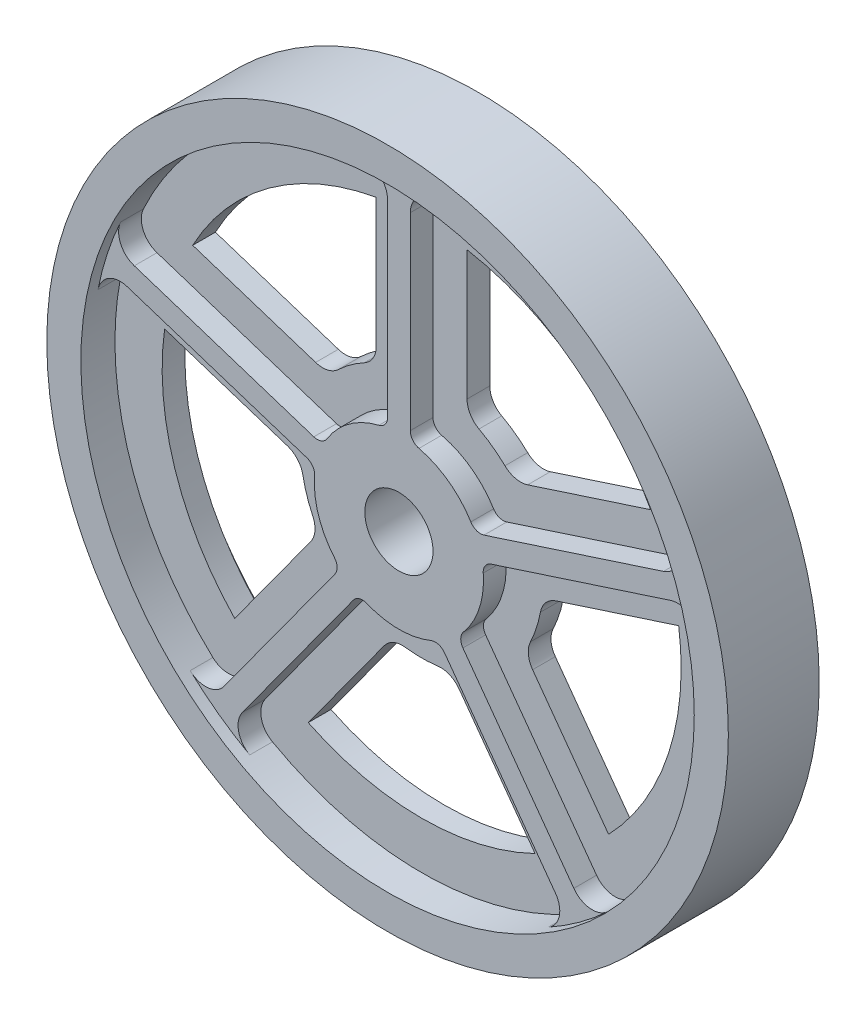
ISO-10303-21;
HEADER;
FILE_DESCRIPTION(('STEP AP214'),'2;1');
FILE_NAME('part.step','',(''),(''),'','','');
FILE_SCHEMA(('AUTOMOTIVE_DESIGN { 1 0 10303 214 1 1 1 1 }'));
ENDSEC;
DATA;
#1=APPLICATION_CONTEXT('core data for automotive mechanical design processes');
#2=APPLICATION_PROTOCOL_DEFINITION('international standard','automotive_design',2000,#1);
#3=PRODUCT_CONTEXT('',#1,'mechanical');
#4=PRODUCT('Part','Part','',(#3));
#5=PRODUCT_RELATED_PRODUCT_CATEGORY('part','',(#4));
#6=PRODUCT_DEFINITION_FORMATION('','',#4);
#7=PRODUCT_DEFINITION_CONTEXT('part definition',#1,'design');
#8=PRODUCT_DEFINITION('design','',#6,#7);
#9=PRODUCT_DEFINITION_SHAPE('','',#8);
#10=(LENGTH_UNIT() NAMED_UNIT(*) SI_UNIT(.MILLI.,.METRE.));
#11=(NAMED_UNIT(*) PLANE_ANGLE_UNIT() SI_UNIT($,.RADIAN.));
#12=(NAMED_UNIT(*) SI_UNIT($,.STERADIAN.) SOLID_ANGLE_UNIT());
#13=UNCERTAINTY_MEASURE_WITH_UNIT(LENGTH_MEASURE(1.E-05),#10,'distance_accuracy_value','');
#14=(GEOMETRIC_REPRESENTATION_CONTEXT(3) GLOBAL_UNCERTAINTY_ASSIGNED_CONTEXT((#13)) GLOBAL_UNIT_ASSIGNED_CONTEXT((#10,
#11,#12)) REPRESENTATION_CONTEXT('',''));
#15=CARTESIAN_POINT('',(0.,0.,0.));
#16=DIRECTION('',(0.,0.,1.));
#17=DIRECTION('',(1.,0.,0.));
#18=AXIS2_PLACEMENT_3D('',#15,#16,#17);
#19=CARTESIAN_POINT('',(0.,0.,20.));
#20=DIRECTION('',(0.,0.,-1.));
#21=DIRECTION('',(-1.,0.,0.));
#22=AXIS2_PLACEMENT_3D('',#19,#20,#21);
#23=CYLINDRICAL_SURFACE('',#22,135.);
#24=CARTESIAN_POINT('',(0.,0.,-20.));
#25=DIRECTION('',(0.,0.,1.));
#26=DIRECTION('',(1.,0.,0.));
#27=AXIS2_PLACEMENT_3D('',#24,#25,#26);
#28=CIRCLE('',#27,135.);
#29=CARTESIAN_POINT('',(135.,0.,-20.));
#30=VERTEX_POINT('',#29);
#31=EDGE_CURVE('E1118',#30,#30,#28,.T.);
#32=ORIENTED_EDGE('',*,*,#31,.F.);
#33=EDGE_LOOP('',(#32));
#34=FACE_BOUND('',#33,.T.);
#35=CARTESIAN_POINT('',(0.,0.,-15.));
#36=DIRECTION('',(0.,0.,1.));
#37=DIRECTION('',(1.,0.,0.));
#38=AXIS2_PLACEMENT_3D('',#35,#36,#37);
#39=CIRCLE('',#38,135.);
#40=CARTESIAN_POINT('',(-91.8836853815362,-98.9059571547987,-15.));
#41=VERTEX_POINT('',#40);
#42=CARTESIAN_POINT('',(-65.671534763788,-117.950199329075,-15.));
#43=VERTEX_POINT('',#42);
#44=EDGE_CURVE('E1383',#41,#43,#39,.T.);
#45=ORIENTED_EDGE('',*,*,#44,.T.);
#46=DIRECTION('',(0.,0.,-1.));
#47=VECTOR('',#46,1.);
#48=CARTESIAN_POINT('',(-65.671534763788,-117.950199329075,20.));
#49=LINE('',#48,#47);
#50=CARTESIAN_POINT('',(-65.671534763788,-117.950199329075,-5.));
#51=VERTEX_POINT('',#50);
#52=EDGE_CURVE('E1308',#43,#51,#49,.F.);
#53=ORIENTED_EDGE('',*,*,#52,.T.);
#54=CARTESIAN_POINT('',(0.,0.,-5.));
#55=DIRECTION('',(0.,0.,1.));
#56=DIRECTION('',(1.,0.,0.));
#57=AXIS2_PLACEMENT_3D('',#54,#55,#56);
#58=CIRCLE('',#57,135.);
#59=CARTESIAN_POINT('',(65.671534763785,-117.950199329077,-5.));
#60=VERTEX_POINT('',#59);
#61=EDGE_CURVE('E1537',#51,#60,#58,.T.);
#62=ORIENTED_EDGE('',*,*,#61,.T.);
#63=DIRECTION('',(0.,0.,-1.));
#64=VECTOR('',#63,1.);
#65=CARTESIAN_POINT('',(65.671534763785,-117.950199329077,20.));
#66=LINE('',#65,#64);
#67=CARTESIAN_POINT('',(65.671534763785,-117.950199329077,-15.));
#68=VERTEX_POINT('',#67);
#69=EDGE_CURVE('E1299',#60,#68,#66,.T.);
#70=ORIENTED_EDGE('',*,*,#69,.T.);
#71=CARTESIAN_POINT('',(91.8836853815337,-98.905957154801,-15.));
#72=VERTEX_POINT('',#71);
#73=EDGE_CURVE('E1543',#68,#72,#39,.T.);
#74=ORIENTED_EDGE('',*,*,#73,.T.);
#75=DIRECTION('',(0.,0.,-1.));
#76=VECTOR('',#75,1.);
#77=CARTESIAN_POINT('',(91.8836853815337,-98.905957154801,20.));
#78=LINE('',#77,#76);
#79=CARTESIAN_POINT('',(91.8836853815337,-98.905957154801,-5.));
#80=VERTEX_POINT('',#79);
#81=EDGE_CURVE('E1302',#72,#80,#78,.F.);
#82=ORIENTED_EDGE('',*,*,#81,.T.);
#83=CARTESIAN_POINT('',(132.470925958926,26.0087249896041,-5.));
#84=VERTEX_POINT('',#83);
#85=EDGE_CURVE('E1568',#80,#84,#58,.T.);
#86=ORIENTED_EDGE('',*,*,#85,.T.);
#87=DIRECTION('',(0.,0.,-1.));
#88=VECTOR('',#87,1.);
#89=CARTESIAN_POINT('',(132.470925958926,26.0087249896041,20.));
#90=LINE('',#89,#88);
#91=CARTESIAN_POINT('',(132.470925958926,26.0087249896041,-15.));
#92=VERTEX_POINT('',#91);
#93=EDGE_CURVE('E1293',#84,#92,#90,.T.);
#94=ORIENTED_EDGE('',*,*,#93,.T.);
#95=CARTESIAN_POINT('',(122.458775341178,56.8229561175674,-15.));
#96=VERTEX_POINT('',#95);
#97=EDGE_CURVE('E2912',#92,#96,#39,.T.);
#98=ORIENTED_EDGE('',*,*,#97,.T.);
#99=DIRECTION('',(0.,0.,-1.));
#100=VECTOR('',#99,1.);
#101=CARTESIAN_POINT('',(122.458775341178,56.8229561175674,20.));
#102=LINE('',#101,#100);
#103=CARTESIAN_POINT('',(122.458775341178,56.8229561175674,-5.));
#104=VERTEX_POINT('',#103);
#105=EDGE_CURVE('E1296',#96,#104,#102,.F.);
#106=ORIENTED_EDGE('',*,*,#105,.T.);
#107=CARTESIAN_POINT('',(16.2000000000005,134.024475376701,-5.));
#108=VERTEX_POINT('',#107);
#109=EDGE_CURVE('E1121',#104,#108,#58,.T.);
#110=ORIENTED_EDGE('',*,*,#109,.T.);
#111=DIRECTION('',(0.,0.,-1.));
#112=VECTOR('',#111,1.);
#113=CARTESIAN_POINT('',(16.2000000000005,134.024475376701,20.));
#114=LINE('',#113,#112);
#115=CARTESIAN_POINT('',(16.2000000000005,134.024475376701,-15.));
#116=VERTEX_POINT('',#115);
#117=EDGE_CURVE('E1287',#108,#116,#114,.T.);
#118=ORIENTED_EDGE('',*,*,#117,.T.);
#119=CARTESIAN_POINT('',(-16.1999999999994,134.024475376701,-15.));
#120=VERTEX_POINT('',#119);
#121=EDGE_CURVE('E714',#116,#120,#39,.T.);
#122=ORIENTED_EDGE('',*,*,#121,.T.);
#123=DIRECTION('',(0.,0.,-1.));
#124=VECTOR('',#123,1.);
#125=CARTESIAN_POINT('',(-16.1999999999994,134.024475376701,20.));
#126=LINE('',#125,#124);
#127=CARTESIAN_POINT('',(-16.1999999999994,134.024475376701,-5.));
#128=VERTEX_POINT('',#127);
#129=EDGE_CURVE('E1290',#120,#128,#126,.F.);
#130=ORIENTED_EDGE('',*,*,#129,.T.);
#131=CARTESIAN_POINT('',(-122.458775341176,56.8229561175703,-5.));
#132=VERTEX_POINT('',#131);
#133=EDGE_CURVE('E1128',#128,#132,#58,.T.);
#134=ORIENTED_EDGE('',*,*,#133,.T.);
#135=DIRECTION('',(0.,0.,-1.));
#136=VECTOR('',#135,1.);
#137=CARTESIAN_POINT('',(-122.458775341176,56.8229561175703,20.));
#138=LINE('',#137,#136);
#139=CARTESIAN_POINT('',(-122.458775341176,56.8229561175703,-15.));
#140=VERTEX_POINT('',#139);
#141=EDGE_CURVE('E1272',#132,#140,#138,.T.);
#142=ORIENTED_EDGE('',*,*,#141,.T.);
#143=CARTESIAN_POINT('',(-132.470925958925,26.0087249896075,-15.));
#144=VERTEX_POINT('',#143);
#145=EDGE_CURVE('E1376',#140,#144,#39,.T.);
#146=ORIENTED_EDGE('',*,*,#145,.T.);
#147=DIRECTION('',(0.,0.,-1.));
#148=VECTOR('',#147,1.);
#149=CARTESIAN_POINT('',(-132.470925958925,26.0087249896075,20.));
#150=LINE('',#149,#148);
#151=CARTESIAN_POINT('',(-132.470925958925,26.0087249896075,-5.));
#152=VERTEX_POINT('',#151);
#153=EDGE_CURVE('E1277',#144,#152,#150,.F.);
#154=ORIENTED_EDGE('',*,*,#153,.T.);
#155=CARTESIAN_POINT('',(-91.8836853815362,-98.9059571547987,-5.));
#156=VERTEX_POINT('',#155);
#157=EDGE_CURVE('E1130',#152,#156,#58,.T.);
#158=ORIENTED_EDGE('',*,*,#157,.T.);
#159=DIRECTION('',(0.,0.,-1.));
#160=VECTOR('',#159,1.);
#161=CARTESIAN_POINT('',(-91.8836853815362,-98.9059571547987,20.));
#162=LINE('',#161,#160);
#163=EDGE_CURVE('E1305',#156,#41,#162,.T.);
#164=ORIENTED_EDGE('',*,*,#163,.T.);
#165=EDGE_LOOP('',(#45,#53,#62,#70,#74,#82,#86,#94,#98,#106,#110,#118,#122,#130,#134,#142,#146,
#154,#158,#164));
#166=FACE_BOUND('',#165,.T.);
#167=ADVANCED_FACE('F32',(#34,#166),#23,.F.);
#168=CARTESIAN_POINT('',(0.,0.,-5.));
#169=DIRECTION('',(0.,0.,1.));
#170=DIRECTION('',(1.,0.,0.));
#171=AXIS2_PLACEMENT_3D('',#168,#169,#170);
#172=PLANE('',#171);
#173=CARTESIAN_POINT('',(0.,0.,-5.));
#174=DIRECTION('',(0.,0.,1.));
#175=DIRECTION('',(1.,0.,0.));
#176=AXIS2_PLACEMENT_3D('',#173,#174,#175);
#177=CIRCLE('',#176,114.224298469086);
#178=CARTESIAN_POINT('',(100.775216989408,53.7730973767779,-5.));
#179=VERTEX_POINT('',#178);
#180=CARTESIAN_POINT('',(20.0000000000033,112.459727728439,-5.));
#181=VERTEX_POINT('',#180);
#182=EDGE_CURVE('E1109',#179,#181,#177,.T.);
#183=ORIENTED_EDGE('',*,*,#182,.T.);
#184=DIRECTION('',(0.,1.,0.));
#185=VECTOR('',#184,1.);
#186=CARTESIAN_POINT('',(20.0000000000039,55.5672186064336,-5.));
#187=LINE('',#186,#185);
#188=CARTESIAN_POINT('',(20.0000000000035,55.5672186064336,-5.));
#189=VERTEX_POINT('',#188);
#190=EDGE_CURVE('E1000',#189,#181,#187,.T.);
#191=ORIENTED_EDGE('',*,*,#190,.F.);
#192=CARTESIAN_POINT('',(30.0000000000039,55.5672186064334,-5.));
#193=DIRECTION('',(0.,0.,-1.));
#194=DIRECTION('',(-1.,0.,0.));
#195=AXIS2_PLACEMENT_3D('',#192,#193,#194);
#196=CIRCLE('',#195,10.0000000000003);
#197=CARTESIAN_POINT('',(25.2492830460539,46.7677476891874,-5.));
#198=VERTEX_POINT('',#197);
#199=EDGE_CURVE('E998',#198,#189,#196,.T.);
#200=ORIENTED_EDGE('',*,*,#199,.F.);
#201=CARTESIAN_POINT('',(0.,0.,-5.));
#202=DIRECTION('',(0.,0.,1.));
#203=DIRECTION('',(1.,0.,0.));
#204=AXIS2_PLACEMENT_3D('',#201,#202,#203);
#205=CIRCLE('',#204,53.1483632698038);
#206=CARTESIAN_POINT('',(36.676313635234,38.4655239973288,-5.));
#207=VERTEX_POINT('',#206);
#208=EDGE_CURVE('E937',#207,#198,#205,.T.);
#209=ORIENTED_EDGE('',*,*,#208,.F.);
#210=CARTESIAN_POINT('',(43.5770555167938,45.702910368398,-5.));
#211=DIRECTION('',(0.,0.,-1.));
#212=DIRECTION('',(1.,0.,0.));
#213=AXIS2_PLACEMENT_3D('',#210,#211,#212);
#214=CIRCLE('',#213,10.0000000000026);
#215=CARTESIAN_POINT('',(46.6672254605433,36.1923452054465,-5.));
#216=VERTEX_POINT('',#215);
#217=EDGE_CURVE('E942',#216,#207,#214,.T.);
#218=ORIENTED_EDGE('',*,*,#217,.F.);
#219=DIRECTION('',(-0.951056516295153,-0.309016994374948,0.));
#220=VECTOR('',#219,1.);
#221=CARTESIAN_POINT('',(46.6672254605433,36.1923452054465,-5.));
#222=LINE('',#221,#220);
#223=EDGE_CURVE('E1042',#179,#216,#222,.T.);
#224=ORIENTED_EDGE('',*,*,#223,.F.);
#225=EDGE_LOOP('',(#183,#191,#200,#209,#218,#224));
#226=FACE_BOUND('',#225,.T.);
#227=ORIENTED_EDGE('',*,*,#109,.F.);
#228=CARTESIAN_POINT('',(113.387754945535,52.6138482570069,-5.));
#229=DIRECTION('',(0.,0.,1.));
#230=DIRECTION('',(1.,0.,0.));
#231=AXIS2_PLACEMENT_3D('',#228,#229,#230);
#232=CIRCLE('',#231,10.);
#233=CARTESIAN_POINT('',(116.477924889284,43.1032830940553,-5.));
#234=VERTEX_POINT('',#233);
#235=EDGE_CURVE('E1333',#104,#234,#232,.F.);
#236=ORIENTED_EDGE('',*,*,#235,.T.);
#237=DIRECTION('',(0.951056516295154,0.309016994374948,0.));
#238=VECTOR('',#237,1.);
#239=CARTESIAN_POINT('',(-88.8727576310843,-23.6191982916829,-5.));
#240=LINE('',#239,#238);
#241=CARTESIAN_POINT('',(37.4669441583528,17.431059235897,-5.));
#242=VERTEX_POINT('',#241);
#243=EDGE_CURVE('E1476',#242,#234,#240,.T.);
#244=ORIENTED_EDGE('',*,*,#243,.F.);
#245=CARTESIAN_POINT('',(35.9218591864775,22.1863418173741,-5.));
#246=DIRECTION('',(0.,0.,1.));
#247=DIRECTION('',(1.,0.,0.));
#248=AXIS2_PLACEMENT_3D('',#245,#246,#247);
#249=CIRCLE('',#248,5.0000000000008);
#250=CARTESIAN_POINT('',(31.6678327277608,19.5589364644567,-5.));
#251=VERTEX_POINT('',#250);
#252=EDGE_CURVE('E1474',#251,#242,#249,.T.);
#253=ORIENTED_EDGE('',*,*,#252,.F.);
#254=CARTESIAN_POINT('',(0.,0.,-5.));
#255=DIRECTION('',(0.,0.,1.));
#256=DIRECTION('',(1.,0.,0.));
#257=AXIS2_PLACEMENT_3D('',#254,#255,#256);
#258=CIRCLE('',#257,37.2210105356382);
#259=CARTESIAN_POINT('',(8.81575548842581,36.1619424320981,-5.));
#260=VERTEX_POINT('',#259);
#261=EDGE_CURVE('E1457',#251,#260,#258,.T.);
#262=ORIENTED_EDGE('',*,*,#261,.T.);
#263=CARTESIAN_POINT('',(10.0000000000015,41.0196749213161,-5.));
#264=DIRECTION('',(0.,0.,1.));
#265=DIRECTION('',(1.,0.,0.));
#266=AXIS2_PLACEMENT_3D('',#263,#264,#265);
#267=CIRCLE('',#266,5.);
#268=CARTESIAN_POINT('',(5.00000000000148,41.019674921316,-5.));
#269=VERTEX_POINT('',#268);
#270=EDGE_CURVE('E1464',#269,#260,#267,.T.);
#271=ORIENTED_EDGE('',*,*,#270,.F.);
#272=DIRECTION('',(0.,1.,0.));
#273=VECTOR('',#272,1.);
#274=CARTESIAN_POINT('',(5.00000000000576,-297.141421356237,-5.));
#275=LINE('',#274,#273);
#276=CARTESIAN_POINT('',(5.00000000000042,124.096736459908,-5.));
#277=VERTEX_POINT('',#276);
#278=EDGE_CURVE('E1469',#269,#277,#275,.T.);
#279=ORIENTED_EDGE('',*,*,#278,.T.);
#280=CARTESIAN_POINT('',(15.0000000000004,124.096736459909,-5.));
#281=DIRECTION('',(0.,0.,1.));
#282=DIRECTION('',(1.,0.,0.));
#283=AXIS2_PLACEMENT_3D('',#280,#281,#282);
#284=CIRCLE('',#283,10.);
#285=EDGE_CURVE('E1331',#277,#108,#284,.F.);
#286=ORIENTED_EDGE('',*,*,#285,.T.);
#287=EDGE_LOOP('',(#227,#236,#244,#253,#262,#271,#279,#286));
#288=FACE_BOUND('',#287,.T.);
#289=ADVANCED_FACE('F1472',(#226,#288),#172,.F.);
#290=DIRECTION('',(-0.587785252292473,0.809016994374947,0.));
#291=VECTOR('',#290,1.);
#292=CARTESIAN_POINT('',(48.8419314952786,-33.1991191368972,-5.));
#293=LINE('',#292,#291);
#294=CARTESIAN_POINT('',(82.2825093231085,-79.2261258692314,-5.));
#295=VERTEX_POINT('',#294);
#296=CARTESIAN_POINT('',(48.8419314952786,-33.1991191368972,-5.));
#297=VERTEX_POINT('',#296);
#298=EDGE_CURVE('E1032',#295,#297,#293,.T.);
#299=ORIENTED_EDGE('',*,*,#298,.F.);
#300=CARTESIAN_POINT('',(113.13589676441,15.7308367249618,-5.));
#301=VERTEX_POINT('',#300);
#302=EDGE_CURVE('E1104',#295,#301,#177,.T.);
#303=ORIENTED_EDGE('',*,*,#302,.T.);
#304=DIRECTION('',(0.951056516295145,0.309016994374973,0.));
#305=VECTOR('',#304,1.);
#306=CARTESIAN_POINT('',(59.0279052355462,-1.84991544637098,-5.));
#307=LINE('',#306,#305);
#308=CARTESIAN_POINT('',(59.0279052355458,-1.84991544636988,-5.));
#309=VERTEX_POINT('',#308);
#310=EDGE_CURVE('E1040',#309,#301,#307,.T.);
#311=ORIENTED_EDGE('',*,*,#310,.F.);
#312=CARTESIAN_POINT('',(62.1180751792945,-11.3604806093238,-5.));
#313=DIRECTION('',(0.,0.,-1.));
#314=DIRECTION('',(-1.,0.,0.));
#315=AXIS2_PLACEMENT_3D('',#312,#313,#314);
#316=CIRCLE('',#315,10.000000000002);
#317=CARTESIAN_POINT('',(52.2812287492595,-9.56146634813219,-5.));
#318=VERTEX_POINT('',#317);
#319=EDGE_CURVE('E1038',#318,#309,#316,.T.);
#320=ORIENTED_EDGE('',*,*,#319,.F.);
#321=CARTESIAN_POINT('',(0.,0.,-5.));
#322=DIRECTION('',(0.,0.,1.));
#323=DIRECTION('',(1.,0.,0.));
#324=AXIS2_PLACEMENT_3D('',#321,#322,#323);
#325=CIRCLE('',#324,53.1483632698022);
#326=CARTESIAN_POINT('',(47.9164914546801,-22.9947464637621,-5.));
#327=VERTEX_POINT('',#326);
#328=EDGE_CURVE('E1036',#327,#318,#325,.T.);
#329=ORIENTED_EDGE('',*,*,#328,.F.);
#330=CARTESIAN_POINT('',(56.9321014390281,-27.3212666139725,-5.));
#331=DIRECTION('',(0.,0.,-1.));
#332=DIRECTION('',(1.,0.,0.));
#333=AXIS2_PLACEMENT_3D('',#330,#331,#332);
#334=CIRCLE('',#333,10.0000000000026);
#335=EDGE_CURVE('E1034',#297,#327,#334,.T.);
#336=ORIENTED_EDGE('',*,*,#335,.F.);
#337=EDGE_LOOP('',(#299,#303,#311,#320,#329,#336));
#338=FACE_BOUND('',#337,.T.);
#339=ORIENTED_EDGE('',*,*,#85,.F.);
#340=CARTESIAN_POINT('',(85.0774864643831,-91.5795899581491,-5.));
#341=DIRECTION('',(0.,0.,1.));
#342=DIRECTION('',(1.,0.,0.));
#343=AXIS2_PLACEMENT_3D('',#340,#341,#342);
#344=CIRCLE('',#343,10.);
#345=CARTESIAN_POINT('',(76.9873165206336,-97.4574424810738,-5.));
#346=VERTEX_POINT('',#345);
#347=EDGE_CURVE('E1324',#80,#346,#344,.F.);
#348=ORIENTED_EDGE('',*,*,#347,.T.);
#349=DIRECTION('',(0.587785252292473,-0.809016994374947,0.));
#350=VECTOR('',#349,1.);
#351=CARTESIAN_POINT('',(145.3442274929,-191.542658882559,-5.));
#352=LINE('',#351,#350);
#353=CARTESIAN_POINT('',(28.1558449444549,-30.2466878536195,-5.));
#354=VERTEX_POINT('',#353);
#355=EDGE_CURVE('E1493',#354,#346,#352,.T.);
#356=ORIENTED_EDGE('',*,*,#355,.F.);
#357=CARTESIAN_POINT('',(32.2009299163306,-27.3077615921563,-5.));
#358=DIRECTION('',(0.,0.,1.));
#359=DIRECTION('',(1.,0.,0.));
#360=AXIS2_PLACEMENT_3D('',#357,#358,#359);
#361=CIRCLE('',#360,5.00000000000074);
#362=CARTESIAN_POINT('',(28.3875524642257,-24.0738549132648,-5.));
#363=VERTEX_POINT('',#362);
#364=EDGE_CURVE('E1491',#363,#354,#361,.T.);
#365=ORIENTED_EDGE('',*,*,#364,.F.);
#366=CARTESIAN_POINT('',(0.,0.,-5.));
#367=DIRECTION('',(0.,0.,1.));
#368=DIRECTION('',(1.,0.,0.));
#369=AXIS2_PLACEMENT_3D('',#366,#367,#368);
#370=CIRCLE('',#369,37.2210105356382);
#371=CARTESIAN_POINT('',(37.1162692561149,2.79037305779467,-5.));
#372=VERTEX_POINT('',#371);
#373=EDGE_CURVE('E1488',#363,#372,#370,.T.);
#374=ORIENTED_EDGE('',*,*,#373,.T.);
#375=CARTESIAN_POINT('',(42.1021990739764,3.16521149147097,-5.));
#376=DIRECTION('',(0.,0.,1.));
#377=DIRECTION('',(1.,0.,0.));
#378=AXIS2_PLACEMENT_3D('',#375,#376,#377);
#379=CIRCLE('',#378,4.9999999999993);
#380=CARTESIAN_POINT('',(40.5571141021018,7.92049407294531,-5.));
#381=VERTEX_POINT('',#380);
#382=EDGE_CURVE('E1485',#381,#372,#379,.T.);
#383=ORIENTED_EDGE('',*,*,#382,.F.);
#384=DIRECTION('',(0.951056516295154,0.309016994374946,0.));
#385=VECTOR('',#384,1.);
#386=CARTESIAN_POINT('',(-85.7825876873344,-33.129763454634,-5.));
#387=LINE('',#386,#385);
#388=CARTESIAN_POINT('',(119.568094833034,33.5927179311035,-5.));
#389=VERTEX_POINT('',#388);
#390=EDGE_CURVE('E1482',#381,#389,#387,.T.);
#391=ORIENTED_EDGE('',*,*,#390,.T.);
#392=CARTESIAN_POINT('',(122.658264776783,24.082152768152,-5.));
#393=DIRECTION('',(0.,0.,1.));
#394=DIRECTION('',(1.,0.,0.));
#395=AXIS2_PLACEMENT_3D('',#392,#393,#394);
#396=CIRCLE('',#395,10.);
#397=EDGE_CURVE('E1322',#389,#84,#396,.F.);
#398=ORIENTED_EDGE('',*,*,#397,.T.);
#399=EDGE_LOOP('',(#339,#348,#356,#365,#374,#383,#391,#398));
#400=FACE_BOUND('',#399,.T.);
#401=ADVANCED_FACE('F1661',(#338,#400),#172,.F.);
#402=DIRECTION('',(0.587785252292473,0.809016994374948,0.));
#403=VECTOR('',#402,1.);
#404=CARTESIAN_POINT('',(-16.4812517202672,-56.710529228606,-5.));
#405=LINE('',#404,#403);
#406=CARTESIAN_POINT('',(-49.921829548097,-102.73753596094,-5.));
#407=VERTEX_POINT('',#406);
#408=CARTESIAN_POINT('',(-16.4812517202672,-56.710529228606,-5.));
#409=VERTEX_POINT('',#408);
#410=EDGE_CURVE('E1022',#407,#409,#405,.T.);
#411=ORIENTED_EDGE('',*,*,#410,.F.);
#412=CARTESIAN_POINT('',(49.9218295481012,-102.737535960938,-5.));
#413=VERTEX_POINT('',#412);
#414=EDGE_CURVE('E1113',#407,#413,#177,.T.);
#415=ORIENTED_EDGE('',*,*,#414,.T.);
#416=DIRECTION('',(0.587785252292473,-0.809016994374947,0.));
#417=VECTOR('',#416,1.);
#418=CARTESIAN_POINT('',(16.4812517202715,-56.7105292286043,-5.));
#419=LINE('',#418,#417);
#420=CARTESIAN_POINT('',(16.4812517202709,-56.7105292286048,-5.));
#421=VERTEX_POINT('',#420);
#422=EDGE_CURVE('E1030',#421,#413,#419,.T.);
#423=ORIENTED_EDGE('',*,*,#422,.F.);
#424=CARTESIAN_POINT('',(8.39108177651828,-62.5883817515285,-5.));
#425=DIRECTION('',(0.,0.,-1.));
#426=DIRECTION('',(-1.,0.,0.));
#427=AXIS2_PLACEMENT_3D('',#424,#425,#426);
#428=CIRCLE('',#427,10.0000000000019);
#429=CARTESIAN_POINT('',(7.06229329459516,-52.6770588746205,-5.));
#430=VERTEX_POINT('',#429);
#431=EDGE_CURVE('E1028',#430,#421,#428,.T.);
#432=ORIENTED_EDGE('',*,*,#431,.F.);
#433=CARTESIAN_POINT('',(0.,0.,-5.));
#434=DIRECTION('',(0.,0.,1.));
#435=DIRECTION('',(1.,0.,0.));
#436=AXIS2_PLACEMENT_3D('',#433,#434,#435);
#437=CIRCLE('',#436,53.1483632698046);
#438=CARTESIAN_POINT('',(-7.06229329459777,-52.6770588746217,-5.));
#439=VERTEX_POINT('',#438);
#440=EDGE_CURVE('E1026',#439,#430,#437,.T.);
#441=ORIENTED_EDGE('',*,*,#440,.F.);
#442=CARTESIAN_POINT('',(-8.39108177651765,-62.5883817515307,-5.));
#443=DIRECTION('',(0.,0.,-1.));
#444=DIRECTION('',(1.,0.,0.));
#445=AXIS2_PLACEMENT_3D('',#442,#443,#444);
#446=CIRCLE('',#445,10.0000000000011);
#447=EDGE_CURVE('E1024',#409,#439,#446,.T.);
#448=ORIENTED_EDGE('',*,*,#447,.F.);
#449=EDGE_LOOP('',(#411,#415,#423,#432,#441,#448));
#450=FACE_BOUND('',#449,.T.);
#451=ORIENTED_EDGE('',*,*,#61,.F.);
#452=CARTESIAN_POINT('',(-60.806976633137,-109.213147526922,-5.));
#453=DIRECTION('',(0.,0.,1.));
#454=DIRECTION('',(1.,0.,0.));
#455=AXIS2_PLACEMENT_3D('',#452,#453,#454);
#456=CIRCLE('',#455,10.);
#457=CARTESIAN_POINT('',(-68.8971465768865,-103.335295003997,-5.));
#458=VERTEX_POINT('',#457);
#459=EDGE_CURVE('E1313',#51,#458,#456,.F.);
#460=ORIENTED_EDGE('',*,*,#459,.T.);
#461=DIRECTION('',(-0.587785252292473,-0.809016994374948,0.));
#462=VECTOR('',#461,1.);
#463=CARTESIAN_POINT('',(-137.254057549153,-197.420511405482,-5.));
#464=LINE('',#463,#462);
#465=CARTESIAN_POINT('',(-20.0656750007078,-36.1245403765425,-5.));
#466=VERTEX_POINT('',#465);
#467=EDGE_CURVE('E1507',#466,#458,#464,.T.);
#468=ORIENTED_EDGE('',*,*,#467,.F.);
#469=CARTESIAN_POINT('',(-16.0205900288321,-39.0634666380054,-5.));
#470=DIRECTION('',(0.,0.,1.));
#471=DIRECTION('',(1.,0.,0.));
#472=AXIS2_PLACEMENT_3D('',#469,#470,#471);
#473=CIRCLE('',#472,5.00000000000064);
#474=CARTESIAN_POINT('',(-14.1233604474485,-34.437397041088,-5.));
#475=VERTEX_POINT('',#474);
#476=EDGE_CURVE('E1505',#475,#466,#473,.T.);
#477=ORIENTED_EDGE('',*,*,#476,.F.);
#478=CARTESIAN_POINT('',(0.,0.,-5.));
#479=DIRECTION('',(0.,0.,1.));
#480=DIRECTION('',(1.,0.,0.));
#481=AXIS2_PLACEMENT_3D('',#478,#479,#480);
#482=CIRCLE('',#481,37.2210105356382);
#483=CARTESIAN_POINT('',(14.123360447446,-34.4373970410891,-5.));
#484=VERTEX_POINT('',#483);
#485=EDGE_CURVE('E1502',#475,#484,#482,.T.);
#486=ORIENTED_EDGE('',*,*,#485,.T.);
#487=CARTESIAN_POINT('',(16.0205900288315,-39.0634666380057,-5.));
#488=DIRECTION('',(0.,0.,1.));
#489=DIRECTION('',(1.,0.,0.));
#490=AXIS2_PLACEMENT_3D('',#487,#488,#489);
#491=CIRCLE('',#490,4.99999999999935);
#492=CARTESIAN_POINT('',(20.065675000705,-36.1245403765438,-5.));
#493=VERTEX_POINT('',#492);
#494=EDGE_CURVE('E1499',#493,#484,#491,.T.);
#495=ORIENTED_EDGE('',*,*,#494,.F.);
#496=DIRECTION('',(0.587785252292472,-0.809016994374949,0.));
#497=VECTOR('',#496,1.);
#498=CARTESIAN_POINT('',(137.254057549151,-197.420511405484,-5.));
#499=LINE('',#498,#497);
#500=CARTESIAN_POINT('',(68.8971465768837,-103.335295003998,-5.));
#501=VERTEX_POINT('',#500);
#502=EDGE_CURVE('E1496',#493,#501,#499,.T.);
#503=ORIENTED_EDGE('',*,*,#502,.T.);
#504=CARTESIAN_POINT('',(60.8069766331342,-109.213147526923,-5.));
#505=DIRECTION('',(0.,0.,1.));
#506=DIRECTION('',(1.,0.,0.));
#507=AXIS2_PLACEMENT_3D('',#504,#505,#506);
#508=CIRCLE('',#507,10.);
#509=EDGE_CURVE('E1311',#501,#60,#508,.F.);
#510=ORIENTED_EDGE('',*,*,#509,.T.);
#511=EDGE_LOOP('',(#451,#460,#468,#477,#486,#495,#503,#510));
#512=FACE_BOUND('',#511,.T.);
#513=ADVANCED_FACE('F1602',(#450,#512),#172,.F.);
#514=DIRECTION('',(0.,-1.,0.));
#515=VECTOR('',#514,1.);
#516=CARTESIAN_POINT('',(-20.0000000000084,55.5672186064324,-5.));
#517=LINE('',#516,#515);
#518=CARTESIAN_POINT('',(-20.0000000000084,112.459727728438,-5.));
#519=VERTEX_POINT('',#518);
#520=CARTESIAN_POINT('',(-20.0000000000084,55.5672186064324,-5.));
#521=VERTEX_POINT('',#520);
#522=EDGE_CURVE('E1002',#519,#521,#517,.T.);
#523=ORIENTED_EDGE('',*,*,#522,.F.);
#524=CARTESIAN_POINT('',(-100.775216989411,53.7730973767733,-5.));
#525=VERTEX_POINT('',#524);
#526=EDGE_CURVE('E1608',#519,#525,#177,.T.);
#527=ORIENTED_EDGE('',*,*,#526,.T.);
#528=DIRECTION('',(-0.951056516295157,0.309016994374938,0.));
#529=VECTOR('',#528,1.);
#530=CARTESIAN_POINT('',(-46.6672254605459,36.1923452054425,-5.));
#531=LINE('',#530,#529);
#532=CARTESIAN_POINT('',(-46.667225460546,36.1923452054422,-5.));
#533=VERTEX_POINT('',#532);
#534=EDGE_CURVE('E1010',#533,#525,#531,.T.);
#535=ORIENTED_EDGE('',*,*,#534,.F.);
#536=CARTESIAN_POINT('',(-43.5770555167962,45.702910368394,-5.));
#537=DIRECTION('',(0.,0.,-1.));
#538=DIRECTION('',(-1.,0.,0.));
#539=AXIS2_PLACEMENT_3D('',#536,#537,#538);
#540=CIRCLE('',#539,10.0000000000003);
#541=CARTESIAN_POINT('',(-36.6763136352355,38.4655239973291,-5.));
#542=VERTEX_POINT('',#541);
#543=EDGE_CURVE('E1008',#542,#533,#540,.T.);
#544=ORIENTED_EDGE('',*,*,#543,.F.);
#545=CARTESIAN_POINT('',(0.,0.,-5.));
#546=DIRECTION('',(0.,0.,1.));
#547=DIRECTION('',(1.,0.,0.));
#548=AXIS2_PLACEMENT_3D('',#545,#546,#547);
#549=CIRCLE('',#548,53.148363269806);
#550=CARTESIAN_POINT('',(-25.2492830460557,46.7677476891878,-5.));
#551=VERTEX_POINT('',#550);
#552=EDGE_CURVE('E1006',#551,#542,#549,.T.);
#553=ORIENTED_EDGE('',*,*,#552,.F.);
#554=CARTESIAN_POINT('',(-30.0000000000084,55.5672186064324,-5.));
#555=DIRECTION('',(0.,0.,-1.));
#556=DIRECTION('',(1.,0.,0.));
#557=AXIS2_PLACEMENT_3D('',#554,#555,#556);
#558=CIRCLE('',#557,10.0000000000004);
#559=EDGE_CURVE('E1004',#521,#551,#558,.T.);
#560=ORIENTED_EDGE('',*,*,#559,.F.);
#561=EDGE_LOOP('',(#523,#527,#535,#544,#553,#560));
#562=FACE_BOUND('',#561,.T.);
#563=ORIENTED_EDGE('',*,*,#133,.F.);
#564=CARTESIAN_POINT('',(-14.9999999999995,124.096736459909,-5.));
#565=DIRECTION('',(0.,0.,1.));
#566=DIRECTION('',(1.,0.,0.));
#567=AXIS2_PLACEMENT_3D('',#564,#565,#566);
#568=CIRCLE('',#567,10.);
#569=CARTESIAN_POINT('',(-4.99999999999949,124.096736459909,-5.));
#570=VERTEX_POINT('',#569);
#571=EDGE_CURVE('E1340',#128,#570,#568,.F.);
#572=ORIENTED_EDGE('',*,*,#571,.T.);
#573=DIRECTION('',(0.,1.,0.));
#574=VECTOR('',#573,1.);
#575=CARTESIAN_POINT('',(-4.99999999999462,-297.141421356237,-5.));
#576=LINE('',#575,#574);
#577=CARTESIAN_POINT('',(-4.99999999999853,41.0196749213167,-5.));
#578=VERTEX_POINT('',#577);
#579=EDGE_CURVE('E1558',#578,#570,#576,.T.);
#580=ORIENTED_EDGE('',*,*,#579,.F.);
#581=CARTESIAN_POINT('',(-9.99999999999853,41.0196749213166,-5.));
#582=DIRECTION('',(0.,0.,1.));
#583=DIRECTION('',(1.,0.,0.));
#584=AXIS2_PLACEMENT_3D('',#581,#582,#583);
#585=CIRCLE('',#584,5.);
#586=CARTESIAN_POINT('',(-8.81575548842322,36.1619424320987,-5.));
#587=VERTEX_POINT('',#586);
#588=EDGE_CURVE('E728',#587,#578,#585,.T.);
#589=ORIENTED_EDGE('',*,*,#588,.F.);
#590=CARTESIAN_POINT('',(0.,0.,-5.));
#591=DIRECTION('',(0.,0.,1.));
#592=DIRECTION('',(1.,0.,0.));
#593=AXIS2_PLACEMENT_3D('',#590,#591,#592);
#594=CIRCLE('',#593,37.2210105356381);
#595=CARTESIAN_POINT('',(-31.6678327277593,19.558936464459,-5.));
#596=VERTEX_POINT('',#595);
#597=EDGE_CURVE('E724',#587,#596,#594,.T.);
#598=ORIENTED_EDGE('',*,*,#597,.T.);
#599=CARTESIAN_POINT('',(-35.9218591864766,22.1863418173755,-5.));
#600=DIRECTION('',(0.,0.,1.));
#601=DIRECTION('',(1.,0.,0.));
#602=AXIS2_PLACEMENT_3D('',#599,#600,#601);
#603=CIRCLE('',#602,5.00000000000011);
#604=CARTESIAN_POINT('',(-37.4669441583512,17.4310592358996,-5.));
#605=VERTEX_POINT('',#604);
#606=EDGE_CURVE('E1405',#596,#605,#603,.F.);
#607=ORIENTED_EDGE('',*,*,#606,.T.);
#608=DIRECTION('',(-0.951056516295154,0.309016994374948,0.));
#609=VECTOR('',#608,1.);
#610=CARTESIAN_POINT('',(88.8727576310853,-23.6191982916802,-5.));
#611=LINE('',#610,#609);
#612=CARTESIAN_POINT('',(-116.477924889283,43.1032830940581,-5.));
#613=VERTEX_POINT('',#612);
#614=EDGE_CURVE('E1371',#605,#613,#611,.T.);
#615=ORIENTED_EDGE('',*,*,#614,.T.);
#616=CARTESIAN_POINT('',(-113.387754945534,52.6138482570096,-5.));
#617=DIRECTION('',(0.,0.,1.));
#618=DIRECTION('',(1.,0.,0.));
#619=AXIS2_PLACEMENT_3D('',#616,#617,#618);
#620=CIRCLE('',#619,10.);
#621=EDGE_CURVE('E1269',#613,#132,#620,.F.);
#622=ORIENTED_EDGE('',*,*,#621,.T.);
#623=EDGE_LOOP('',(#563,#572,#580,#589,#598,#607,#615,#622));
#624=FACE_BOUND('',#623,.T.);
#625=ADVANCED_FACE('F1366',(#562,#624),#172,.F.);
#626=CARTESIAN_POINT('',(0.,0.,20.));
#627=DIRECTION('',(0.,0.,1.));
#628=DIRECTION('',(1.,0.,0.));
#629=AXIS2_PLACEMENT_3D('',#626,#627,#628);
#630=CIRCLE('',#629,135.);
#631=CARTESIAN_POINT('',(135.,0.,20.));
#632=VERTEX_POINT('',#631);
#633=EDGE_CURVE('E1114',#632,#632,#630,.T.);
#634=ORIENTED_EDGE('',*,*,#633,.T.);
#635=EDGE_LOOP('',(#634));
#636=FACE_BOUND('',#635,.T.);
#637=CARTESIAN_POINT('',(0.,0.,5.));
#638=DIRECTION('',(0.,0.,1.));
#639=DIRECTION('',(1.,0.,0.));
#640=AXIS2_PLACEMENT_3D('',#637,#638,#639);
#641=CIRCLE('',#640,135.);
#642=CARTESIAN_POINT('',(-65.671534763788,-117.950199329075,5.));
#643=VERTEX_POINT('',#642);
#644=CARTESIAN_POINT('',(65.671534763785,-117.950199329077,5.));
#645=VERTEX_POINT('',#644);
#646=EDGE_CURVE('E1133',#643,#645,#641,.T.);
#647=ORIENTED_EDGE('',*,*,#646,.F.);
#648=DIRECTION('',(0.,0.,-1.));
#649=VECTOR('',#648,1.);
#650=CARTESIAN_POINT('',(-65.671534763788,-117.950199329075,20.));
#651=LINE('',#650,#649);
#652=CARTESIAN_POINT('',(-65.671534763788,-117.950199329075,15.));
#653=VERTEX_POINT('',#652);
#654=EDGE_CURVE('E1214',#643,#653,#651,.F.);
#655=ORIENTED_EDGE('',*,*,#654,.T.);
#656=CARTESIAN_POINT('',(0.,0.,15.));
#657=DIRECTION('',(0.,0.,1.));
#658=DIRECTION('',(1.,0.,0.));
#659=AXIS2_PLACEMENT_3D('',#656,#657,#658);
#660=CIRCLE('',#659,135.);
#661=CARTESIAN_POINT('',(-91.8836853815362,-98.9059571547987,15.));
#662=VERTEX_POINT('',#661);
#663=EDGE_CURVE('E754',#662,#653,#660,.T.);
#664=ORIENTED_EDGE('',*,*,#663,.F.);
#665=DIRECTION('',(0.,0.,-1.));
#666=VECTOR('',#665,1.);
#667=CARTESIAN_POINT('',(-91.8836853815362,-98.9059571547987,20.));
#668=LINE('',#667,#666);
#669=CARTESIAN_POINT('',(-91.8836853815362,-98.9059571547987,5.));
#670=VERTEX_POINT('',#669);
#671=EDGE_CURVE('E1211',#662,#670,#668,.T.);
#672=ORIENTED_EDGE('',*,*,#671,.T.);
#673=CARTESIAN_POINT('',(-132.470925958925,26.0087249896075,5.));
#674=VERTEX_POINT('',#673);
#675=EDGE_CURVE('E1135',#674,#670,#641,.T.);
#676=ORIENTED_EDGE('',*,*,#675,.F.);
#677=DIRECTION('',(0.,0.,-1.));
#678=VECTOR('',#677,1.);
#679=CARTESIAN_POINT('',(-132.470925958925,26.0087249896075,20.));
#680=LINE('',#679,#678);
#681=CARTESIAN_POINT('',(-132.470925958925,26.0087249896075,15.));
#682=VERTEX_POINT('',#681);
#683=EDGE_CURVE('E1181',#674,#682,#680,.F.);
#684=ORIENTED_EDGE('',*,*,#683,.T.);
#685=CARTESIAN_POINT('',(-122.458775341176,56.8229561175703,15.));
#686=VERTEX_POINT('',#685);
#687=EDGE_CURVE('E750',#686,#682,#660,.T.);
#688=ORIENTED_EDGE('',*,*,#687,.F.);
#689=DIRECTION('',(0.,0.,-1.));
#690=VECTOR('',#689,1.);
#691=CARTESIAN_POINT('',(-122.458775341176,56.8229561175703,20.));
#692=LINE('',#691,#690);
#693=CARTESIAN_POINT('',(-122.458775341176,56.8229561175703,5.));
#694=VERTEX_POINT('',#693);
#695=EDGE_CURVE('E1166',#686,#694,#692,.T.);
#696=ORIENTED_EDGE('',*,*,#695,.T.);
#697=CARTESIAN_POINT('',(-16.1999999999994,134.024475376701,5.));
#698=VERTEX_POINT('',#697);
#699=EDGE_CURVE('E1682',#698,#694,#641,.T.);
#700=ORIENTED_EDGE('',*,*,#699,.F.);
#701=DIRECTION('',(0.,0.,-1.));
#702=VECTOR('',#701,1.);
#703=CARTESIAN_POINT('',(-16.1999999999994,134.024475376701,20.));
#704=LINE('',#703,#702);
#705=CARTESIAN_POINT('',(-16.1999999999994,134.024475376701,15.));
#706=VERTEX_POINT('',#705);
#707=EDGE_CURVE('E1196',#698,#706,#704,.F.);
#708=ORIENTED_EDGE('',*,*,#707,.T.);
#709=CARTESIAN_POINT('',(16.2000000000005,134.024475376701,15.));
#710=VERTEX_POINT('',#709);
#711=EDGE_CURVE('E753',#710,#706,#660,.T.);
#712=ORIENTED_EDGE('',*,*,#711,.F.);
#713=DIRECTION('',(0.,0.,-1.));
#714=VECTOR('',#713,1.);
#715=CARTESIAN_POINT('',(16.2000000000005,134.024475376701,20.));
#716=LINE('',#715,#714);
#717=CARTESIAN_POINT('',(16.2000000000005,134.024475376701,5.));
#718=VERTEX_POINT('',#717);
#719=EDGE_CURVE('E1193',#710,#718,#716,.T.);
#720=ORIENTED_EDGE('',*,*,#719,.T.);
#721=CARTESIAN_POINT('',(122.458775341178,56.8229561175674,5.));
#722=VERTEX_POINT('',#721);
#723=EDGE_CURVE('E1134',#722,#718,#641,.T.);
#724=ORIENTED_EDGE('',*,*,#723,.F.);
#725=DIRECTION('',(0.,0.,-1.));
#726=VECTOR('',#725,1.);
#727=CARTESIAN_POINT('',(122.458775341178,56.8229561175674,20.));
#728=LINE('',#727,#726);
#729=CARTESIAN_POINT('',(122.458775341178,56.8229561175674,15.));
#730=VERTEX_POINT('',#729);
#731=EDGE_CURVE('E1202',#722,#730,#728,.F.);
#732=ORIENTED_EDGE('',*,*,#731,.T.);
#733=CARTESIAN_POINT('',(132.470925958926,26.0087249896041,15.));
#734=VERTEX_POINT('',#733);
#735=EDGE_CURVE('E797',#734,#730,#660,.T.);
#736=ORIENTED_EDGE('',*,*,#735,.F.);
#737=DIRECTION('',(0.,0.,-1.));
#738=VECTOR('',#737,1.);
#739=CARTESIAN_POINT('',(132.470925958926,26.0087249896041,20.));
#740=LINE('',#739,#738);
#741=CARTESIAN_POINT('',(132.470925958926,26.0087249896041,5.));
#742=VERTEX_POINT('',#741);
#743=EDGE_CURVE('E1199',#734,#742,#740,.T.);
#744=ORIENTED_EDGE('',*,*,#743,.T.);
#745=CARTESIAN_POINT('',(91.8836853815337,-98.905957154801,5.));
#746=VERTEX_POINT('',#745);
#747=EDGE_CURVE('E1125',#746,#742,#641,.T.);
#748=ORIENTED_EDGE('',*,*,#747,.F.);
#749=DIRECTION('',(0.,0.,-1.));
#750=VECTOR('',#749,1.);
#751=CARTESIAN_POINT('',(91.8836853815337,-98.905957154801,20.));
#752=LINE('',#751,#750);
#753=CARTESIAN_POINT('',(91.8836853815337,-98.905957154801,15.));
#754=VERTEX_POINT('',#753);
#755=EDGE_CURVE('E1208',#746,#754,#752,.F.);
#756=ORIENTED_EDGE('',*,*,#755,.T.);
#757=CARTESIAN_POINT('',(65.671534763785,-117.950199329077,15.));
#758=VERTEX_POINT('',#757);
#759=EDGE_CURVE('E782',#758,#754,#660,.T.);
#760=ORIENTED_EDGE('',*,*,#759,.F.);
#761=DIRECTION('',(0.,0.,-1.));
#762=VECTOR('',#761,1.);
#763=CARTESIAN_POINT('',(65.671534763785,-117.950199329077,20.));
#764=LINE('',#763,#762);
#765=EDGE_CURVE('E1205',#758,#645,#764,.T.);
#766=ORIENTED_EDGE('',*,*,#765,.T.);
#767=EDGE_LOOP('',(#647,#655,#664,#672,#676,#684,#688,#696,#700,#708,#712,#720,#724,#732,#736,
#744,#748,#756,#760,#766));
#768=FACE_BOUND('',#767,.T.);
#769=ADVANCED_FACE('F1657',(#636,#768),#23,.F.);
#770=CARTESIAN_POINT('',(0.,0.,5.));
#771=DIRECTION('',(0.,0.,1.));
#772=DIRECTION('',(1.,0.,0.));
#773=AXIS2_PLACEMENT_3D('',#770,#771,#772);
#774=PLANE('',#773);
#775=ORIENTED_EDGE('',*,*,#675,.T.);
#776=CARTESIAN_POINT('',(-85.0774864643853,-91.579589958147,5.));
#777=DIRECTION('',(0.,0.,1.));
#778=DIRECTION('',(1.,0.,0.));
#779=AXIS2_PLACEMENT_3D('',#776,#777,#778);
#780=CIRCLE('',#779,10.);
#781=CARTESIAN_POINT('',(-76.9873165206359,-97.4574424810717,5.));
#782=VERTEX_POINT('',#781);
#783=EDGE_CURVE('E1217',#670,#782,#780,.T.);
#784=ORIENTED_EDGE('',*,*,#783,.T.);
#785=DIRECTION('',(-0.587785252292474,-0.809016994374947,0.));
#786=VECTOR('',#785,1.);
#787=CARTESIAN_POINT('',(-145.344227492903,-191.542658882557,5.));
#788=LINE('',#787,#786);
#789=CARTESIAN_POINT('',(-28.1558449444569,-30.2466878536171,5.));
#790=VERTEX_POINT('',#789);
#791=EDGE_CURVE('E834',#790,#782,#788,.T.);
#792=ORIENTED_EDGE('',*,*,#791,.F.);
#793=CARTESIAN_POINT('',(-32.2009299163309,-27.3077615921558,5.));
#794=DIRECTION('',(0.,0.,1.));
#795=DIRECTION('',(1.,0.,0.));
#796=AXIS2_PLACEMENT_3D('',#793,#794,#795);
#797=CIRCLE('',#796,4.99999999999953);
#798=CARTESIAN_POINT('',(-28.3875524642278,-24.0738549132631,5.));
#799=VERTEX_POINT('',#798);
#800=EDGE_CURVE('E832',#790,#799,#797,.T.);
#801=ORIENTED_EDGE('',*,*,#800,.T.);
#802=CARTESIAN_POINT('',(0.,0.,5.));
#803=DIRECTION('',(0.,0.,1.));
#804=DIRECTION('',(1.,0.,0.));
#805=AXIS2_PLACEMENT_3D('',#802,#803,#804);
#806=CIRCLE('',#805,37.2210105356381);
#807=CARTESIAN_POINT('',(-37.1162692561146,2.79037305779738,5.));
#808=VERTEX_POINT('',#807);
#809=EDGE_CURVE('E829',#808,#799,#806,.T.);
#810=ORIENTED_EDGE('',*,*,#809,.F.);
#811=CARTESIAN_POINT('',(-42.1021990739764,3.16521149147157,5.));
#812=DIRECTION('',(0.,0.,1.));
#813=DIRECTION('',(1.,0.,0.));
#814=AXIS2_PLACEMENT_3D('',#811,#812,#813);
#815=CIRCLE('',#814,5.00000000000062);
#816=CARTESIAN_POINT('',(-40.5571141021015,7.92049407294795,5.));
#817=VERTEX_POINT('',#816);
#818=EDGE_CURVE('E827',#808,#817,#815,.T.);
#819=ORIENTED_EDGE('',*,*,#818,.T.);
#820=DIRECTION('',(-0.951056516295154,0.309016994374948,0.));
#821=VECTOR('',#820,1.);
#822=CARTESIAN_POINT('',(85.7825876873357,-33.1297634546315,5.));
#823=LINE('',#822,#821);
#824=CARTESIAN_POINT('',(-119.568094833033,33.5927179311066,5.));
#825=VERTEX_POINT('',#824);
#826=EDGE_CURVE('E824',#817,#825,#823,.T.);
#827=ORIENTED_EDGE('',*,*,#826,.T.);
#828=CARTESIAN_POINT('',(-122.658264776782,24.0821527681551,5.));
#829=DIRECTION('',(0.,0.,1.));
#830=DIRECTION('',(1.,0.,0.));
#831=AXIS2_PLACEMENT_3D('',#828,#829,#830);
#832=CIRCLE('',#831,10.);
#833=EDGE_CURVE('E1179',#825,#674,#832,.T.);
#834=ORIENTED_EDGE('',*,*,#833,.T.);
#835=EDGE_LOOP('',(#775,#784,#792,#801,#810,#819,#827,#834));
#836=FACE_BOUND('',#835,.T.);
#837=CARTESIAN_POINT('',(0.,0.,5.));
#838=DIRECTION('',(0.,0.,1.));
#839=DIRECTION('',(1.,0.,0.));
#840=AXIS2_PLACEMENT_3D('',#837,#838,#839);
#841=CIRCLE('',#840,114.224298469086);
#842=CARTESIAN_POINT('',(-113.135896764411,15.7308367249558,5.));
#843=VERTEX_POINT('',#842);
#844=CARTESIAN_POINT('',(-82.2825093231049,-79.2261258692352,5.));
#845=VERTEX_POINT('',#844);
#846=EDGE_CURVE('E1578',#843,#845,#841,.T.);
#847=ORIENTED_EDGE('',*,*,#846,.F.);
#848=DIRECTION('',(0.951056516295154,-0.309016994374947,0.));
#849=VECTOR('',#848,1.);
#850=CARTESIAN_POINT('',(-59.0279052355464,-1.84991544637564,5.));
#851=LINE('',#850,#849);
#852=CARTESIAN_POINT('',(-59.0279052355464,-1.84991544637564,5.));
#853=VERTEX_POINT('',#852);
#854=EDGE_CURVE('E958',#843,#853,#851,.T.);
#855=ORIENTED_EDGE('',*,*,#854,.T.);
#856=CARTESIAN_POINT('',(-62.1180751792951,-11.3604806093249,5.));
#857=DIRECTION('',(0.,0.,-1.));
#858=DIRECTION('',(1.,0.,0.));
#859=AXIS2_PLACEMENT_3D('',#856,#857,#858);
#860=CIRCLE('',#859,9.99999999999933);
#861=CARTESIAN_POINT('',(-52.2812287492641,-9.56146634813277,5.));
#862=VERTEX_POINT('',#861);
#863=EDGE_CURVE('E960',#853,#862,#860,.T.);
#864=ORIENTED_EDGE('',*,*,#863,.T.);
#865=CARTESIAN_POINT('',(0.,0.,5.));
#866=DIRECTION('',(0.,0.,1.));
#867=DIRECTION('',(1.,0.,0.));
#868=AXIS2_PLACEMENT_3D('',#865,#866,#867);
#869=CIRCLE('',#868,53.1483632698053);
#870=CARTESIAN_POINT('',(-47.9164914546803,-22.9947464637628,5.));
#871=VERTEX_POINT('',#870);
#872=EDGE_CURVE('E962',#862,#871,#869,.T.);
#873=ORIENTED_EDGE('',*,*,#872,.T.);
#874=CARTESIAN_POINT('',(-56.9321014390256,-27.3212666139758,5.));
#875=DIRECTION('',(0.,0.,-1.));
#876=DIRECTION('',(-1.,0.,0.));
#877=AXIS2_PLACEMENT_3D('',#874,#875,#876);
#878=CIRCLE('',#877,10.0000000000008);
#879=CARTESIAN_POINT('',(-48.8419314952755,-33.199119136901,5.));
#880=VERTEX_POINT('',#879);
#881=EDGE_CURVE('E964',#871,#880,#878,.T.);
#882=ORIENTED_EDGE('',*,*,#881,.T.);
#883=DIRECTION('',(-0.587785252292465,-0.809016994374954,0.));
#884=VECTOR('',#883,1.);
#885=CARTESIAN_POINT('',(-48.8419314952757,-33.1991191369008,5.));
#886=LINE('',#885,#884);
#887=EDGE_CURVE('E966',#880,#845,#886,.T.);
#888=ORIENTED_EDGE('',*,*,#887,.T.);
#889=EDGE_LOOP('',(#847,#855,#864,#873,#882,#888));
#890=FACE_BOUND('',#889,.T.);
#891=ADVANCED_FACE('F1666',(#836,#890),#774,.T.);
#892=DIRECTION('',(-0.587785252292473,-0.809016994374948,0.));
#893=VECTOR('',#892,1.);
#894=CARTESIAN_POINT('',(-137.254057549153,-197.420511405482,5.));
#895=LINE('',#894,#893);
#896=CARTESIAN_POINT('',(-20.0656750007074,-36.1245403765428,5.));
#897=VERTEX_POINT('',#896);
#898=CARTESIAN_POINT('',(-68.8971465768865,-103.335295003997,5.));
#899=VERTEX_POINT('',#898);
#900=EDGE_CURVE('E837',#897,#899,#895,.T.);
#901=ORIENTED_EDGE('',*,*,#900,.T.);
#902=CARTESIAN_POINT('',(-60.806976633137,-109.213147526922,5.));
#903=DIRECTION('',(0.,0.,1.));
#904=DIRECTION('',(1.,0.,0.));
#905=AXIS2_PLACEMENT_3D('',#902,#903,#904);
#906=CIRCLE('',#905,10.);
#907=EDGE_CURVE('E1191',#899,#643,#906,.T.);
#908=ORIENTED_EDGE('',*,*,#907,.T.);
#909=ORIENTED_EDGE('',*,*,#646,.T.);
#910=CARTESIAN_POINT('',(60.8069766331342,-109.213147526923,5.));
#911=DIRECTION('',(0.,0.,1.));
#912=DIRECTION('',(1.,0.,0.));
#913=AXIS2_PLACEMENT_3D('',#910,#911,#912);
#914=CIRCLE('',#913,10.);
#915=CARTESIAN_POINT('',(68.8971465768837,-103.335295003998,5.));
#916=VERTEX_POINT('',#915);
#917=EDGE_CURVE('E1189',#645,#916,#914,.T.);
#918=ORIENTED_EDGE('',*,*,#917,.T.);
#919=DIRECTION('',(0.587785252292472,-0.809016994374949,0.));
#920=VECTOR('',#919,1.);
#921=CARTESIAN_POINT('',(137.254057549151,-197.420511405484,5.));
#922=LINE('',#921,#920);
#923=CARTESIAN_POINT('',(20.065675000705,-36.1245403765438,5.));
#924=VERTEX_POINT('',#923);
#925=EDGE_CURVE('E847',#924,#916,#922,.T.);
#926=ORIENTED_EDGE('',*,*,#925,.F.);
#927=CARTESIAN_POINT('',(16.0205900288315,-39.0634666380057,5.));
#928=DIRECTION('',(0.,0.,1.));
#929=DIRECTION('',(1.,0.,0.));
#930=AXIS2_PLACEMENT_3D('',#927,#928,#929);
#931=CIRCLE('',#930,4.99999999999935);
#932=CARTESIAN_POINT('',(14.1233604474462,-34.4373970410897,5.));
#933=VERTEX_POINT('',#932);
#934=EDGE_CURVE('E845',#924,#933,#931,.T.);
#935=ORIENTED_EDGE('',*,*,#934,.T.);
#936=CARTESIAN_POINT('',(0.,0.,5.));
#937=DIRECTION('',(0.,0.,1.));
#938=DIRECTION('',(1.,0.,0.));
#939=AXIS2_PLACEMENT_3D('',#936,#937,#938);
#940=CIRCLE('',#939,37.2210105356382);
#941=CARTESIAN_POINT('',(-14.1233604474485,-34.437397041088,5.));
#942=VERTEX_POINT('',#941);
#943=EDGE_CURVE('E842',#942,#933,#940,.T.);
#944=ORIENTED_EDGE('',*,*,#943,.F.);
#945=CARTESIAN_POINT('',(-16.0205900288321,-39.0634666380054,5.));
#946=DIRECTION('',(0.,0.,1.));
#947=DIRECTION('',(1.,0.,0.));
#948=AXIS2_PLACEMENT_3D('',#945,#946,#947);
#949=CIRCLE('',#948,5.00000000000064);
#950=EDGE_CURVE('E840',#942,#897,#949,.T.);
#951=ORIENTED_EDGE('',*,*,#950,.T.);
#952=EDGE_LOOP('',(#901,#908,#909,#918,#926,#935,#944,#951));
#953=FACE_BOUND('',#952,.T.);
#954=CARTESIAN_POINT('',(-49.921829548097,-102.73753596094,5.));
#955=VERTEX_POINT('',#954);
#956=CARTESIAN_POINT('',(49.9218295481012,-102.737535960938,5.));
#957=VERTEX_POINT('',#956);
#958=EDGE_CURVE('E1108',#955,#957,#841,.T.);
#959=ORIENTED_EDGE('',*,*,#958,.F.);
#960=DIRECTION('',(0.587785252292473,0.809016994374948,0.));
#961=VECTOR('',#960,1.);
#962=CARTESIAN_POINT('',(-16.4812517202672,-56.710529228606,5.));
#963=LINE('',#962,#961);
#964=CARTESIAN_POINT('',(-16.4812517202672,-56.710529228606,5.));
#965=VERTEX_POINT('',#964);
#966=EDGE_CURVE('E969',#955,#965,#963,.T.);
#967=ORIENTED_EDGE('',*,*,#966,.T.);
#968=CARTESIAN_POINT('',(-8.39108177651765,-62.5883817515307,5.));
#969=DIRECTION('',(0.,0.,-1.));
#970=DIRECTION('',(1.,0.,0.));
#971=AXIS2_PLACEMENT_3D('',#968,#969,#970);
#972=CIRCLE('',#971,10.0000000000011);
#973=CARTESIAN_POINT('',(-7.06229329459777,-52.6770588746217,5.));
#974=VERTEX_POINT('',#973);
#975=EDGE_CURVE('E971',#965,#974,#972,.T.);
#976=ORIENTED_EDGE('',*,*,#975,.T.);
#977=CARTESIAN_POINT('',(0.,0.,5.));
#978=DIRECTION('',(0.,0.,1.));
#979=DIRECTION('',(1.,0.,0.));
#980=AXIS2_PLACEMENT_3D('',#977,#978,#979);
#981=CIRCLE('',#980,53.1483632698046);
#982=CARTESIAN_POINT('',(7.06229329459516,-52.6770588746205,5.));
#983=VERTEX_POINT('',#982);
#984=EDGE_CURVE('E973',#974,#983,#981,.T.);
#985=ORIENTED_EDGE('',*,*,#984,.T.);
#986=CARTESIAN_POINT('',(8.39108177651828,-62.5883817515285,5.));
#987=DIRECTION('',(0.,0.,-1.));
#988=DIRECTION('',(-1.,0.,0.));
#989=AXIS2_PLACEMENT_3D('',#986,#987,#988);
#990=CIRCLE('',#989,10.0000000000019);
#991=CARTESIAN_POINT('',(16.4812517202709,-56.7105292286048,5.));
#992=VERTEX_POINT('',#991);
#993=EDGE_CURVE('E975',#983,#992,#990,.T.);
#994=ORIENTED_EDGE('',*,*,#993,.T.);
#995=DIRECTION('',(0.587785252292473,-0.809016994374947,0.));
#996=VECTOR('',#995,1.);
#997=CARTESIAN_POINT('',(16.4812517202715,-56.7105292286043,5.));
#998=LINE('',#997,#996);
#999=EDGE_CURVE('E977',#992,#957,#998,.T.);
#1000=ORIENTED_EDGE('',*,*,#999,.T.);
#1001=EDGE_LOOP('',(#959,#967,#976,#985,#994,#1000));
#1002=FACE_BOUND('',#1001,.T.);
#1003=ADVANCED_FACE('F1592',(#953,#1002),#774,.T.);
#1004=DIRECTION('',(0.587785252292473,-0.809016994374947,0.));
#1005=VECTOR('',#1004,1.);
#1006=CARTESIAN_POINT('',(145.3442274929,-191.542658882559,5.));
#1007=LINE('',#1006,#1005);
#1008=CARTESIAN_POINT('',(28.1558449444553,-30.2466878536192,5.));
#1009=VERTEX_POINT('',#1008);
#1010=CARTESIAN_POINT('',(76.9873165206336,-97.4574424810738,5.));
#1011=VERTEX_POINT('',#1010);
#1012=EDGE_CURVE('E850',#1009,#1011,#1007,.T.);
#1013=ORIENTED_EDGE('',*,*,#1012,.T.);
#1014=CARTESIAN_POINT('',(85.0774864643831,-91.5795899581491,5.));
#1015=DIRECTION('',(0.,0.,1.));
#1016=DIRECTION('',(1.,0.,0.));
#1017=AXIS2_PLACEMENT_3D('',#1014,#1015,#1016);
#1018=CIRCLE('',#1017,10.);
#1019=EDGE_CURVE('E1226',#1011,#746,#1018,.T.);
#1020=ORIENTED_EDGE('',*,*,#1019,.T.);
#1021=ORIENTED_EDGE('',*,*,#747,.T.);
#1022=CARTESIAN_POINT('',(122.658264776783,24.082152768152,5.));
#1023=DIRECTION('',(0.,0.,1.));
#1024=DIRECTION('',(1.,0.,0.));
#1025=AXIS2_PLACEMENT_3D('',#1022,#1023,#1024);
#1026=CIRCLE('',#1025,10.);
#1027=CARTESIAN_POINT('',(119.568094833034,33.5927179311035,5.));
#1028=VERTEX_POINT('',#1027);
#1029=EDGE_CURVE('E1224',#742,#1028,#1026,.T.);
#1030=ORIENTED_EDGE('',*,*,#1029,.T.);
#1031=DIRECTION('',(0.951056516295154,0.309016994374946,0.));
#1032=VECTOR('',#1031,1.);
#1033=CARTESIAN_POINT('',(-85.7825876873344,-33.129763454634,5.));
#1034=LINE('',#1033,#1032);
#1035=CARTESIAN_POINT('',(40.5571141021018,7.92049407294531,5.));
#1036=VERTEX_POINT('',#1035);
#1037=EDGE_CURVE('E860',#1036,#1028,#1034,.T.);
#1038=ORIENTED_EDGE('',*,*,#1037,.F.);
#1039=CARTESIAN_POINT('',(42.1021990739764,3.16521149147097,5.));
#1040=DIRECTION('',(0.,0.,1.));
#1041=DIRECTION('',(1.,0.,0.));
#1042=AXIS2_PLACEMENT_3D('',#1039,#1040,#1041);
#1043=CIRCLE('',#1042,4.9999999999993);
#1044=CARTESIAN_POINT('',(37.1162692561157,2.79037305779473,5.));
#1045=VERTEX_POINT('',#1044);
#1046=EDGE_CURVE('E858',#1036,#1045,#1043,.T.);
#1047=ORIENTED_EDGE('',*,*,#1046,.T.);
#1048=CARTESIAN_POINT('',(0.,0.,5.));
#1049=DIRECTION('',(0.,0.,1.));
#1050=DIRECTION('',(1.,0.,0.));
#1051=AXIS2_PLACEMENT_3D('',#1048,#1049,#1050);
#1052=CIRCLE('',#1051,37.2210105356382);
#1053=CARTESIAN_POINT('',(28.3875524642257,-24.0738549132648,5.));
#1054=VERTEX_POINT('',#1053);
#1055=EDGE_CURVE('E855',#1054,#1045,#1052,.T.);
#1056=ORIENTED_EDGE('',*,*,#1055,.F.);
#1057=CARTESIAN_POINT('',(32.2009299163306,-27.3077615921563,5.));
#1058=DIRECTION('',(0.,0.,1.));
#1059=DIRECTION('',(1.,0.,0.));
#1060=AXIS2_PLACEMENT_3D('',#1057,#1058,#1059);
#1061=CIRCLE('',#1060,5.00000000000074);
#1062=EDGE_CURVE('E853',#1054,#1009,#1061,.T.);
#1063=ORIENTED_EDGE('',*,*,#1062,.T.);
#1064=EDGE_LOOP('',(#1013,#1020,#1021,#1030,#1038,#1047,#1056,#1063));
#1065=FACE_BOUND('',#1064,.T.);
#1066=DIRECTION('',(0.951056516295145,0.309016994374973,0.));
#1067=VECTOR('',#1066,1.);
#1068=CARTESIAN_POINT('',(59.0279052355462,-1.84991544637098,5.));
#1069=LINE('',#1068,#1067);
#1070=CARTESIAN_POINT('',(59.0279052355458,-1.84991544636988,5.));
#1071=VERTEX_POINT('',#1070);
#1072=CARTESIAN_POINT('',(113.13589676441,15.7308367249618,5.));
#1073=VERTEX_POINT('',#1072);
#1074=EDGE_CURVE('E988',#1071,#1073,#1069,.T.);
#1075=ORIENTED_EDGE('',*,*,#1074,.T.);
#1076=CARTESIAN_POINT('',(82.2825093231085,-79.2261258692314,5.));
#1077=VERTEX_POINT('',#1076);
#1078=EDGE_CURVE('E1105',#1077,#1073,#841,.T.);
#1079=ORIENTED_EDGE('',*,*,#1078,.F.);
#1080=DIRECTION('',(-0.587785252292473,0.809016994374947,0.));
#1081=VECTOR('',#1080,1.);
#1082=CARTESIAN_POINT('',(48.8419314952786,-33.1991191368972,5.));
#1083=LINE('',#1082,#1081);
#1084=CARTESIAN_POINT('',(48.8419314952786,-33.1991191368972,5.));
#1085=VERTEX_POINT('',#1084);
#1086=EDGE_CURVE('E980',#1077,#1085,#1083,.T.);
#1087=ORIENTED_EDGE('',*,*,#1086,.T.);
#1088=CARTESIAN_POINT('',(56.9321014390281,-27.3212666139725,5.));
#1089=DIRECTION('',(0.,0.,-1.));
#1090=DIRECTION('',(1.,0.,0.));
#1091=AXIS2_PLACEMENT_3D('',#1088,#1089,#1090);
#1092=CIRCLE('',#1091,10.0000000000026);
#1093=CARTESIAN_POINT('',(47.9164914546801,-22.9947464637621,5.));
#1094=VERTEX_POINT('',#1093);
#1095=EDGE_CURVE('E982',#1085,#1094,#1092,.T.);
#1096=ORIENTED_EDGE('',*,*,#1095,.T.);
#1097=CARTESIAN_POINT('',(0.,0.,5.));
#1098=DIRECTION('',(0.,0.,1.));
#1099=DIRECTION('',(1.,0.,0.));
#1100=AXIS2_PLACEMENT_3D('',#1097,#1098,#1099);
#1101=CIRCLE('',#1100,53.1483632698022);
#1102=CARTESIAN_POINT('',(52.2812287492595,-9.56146634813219,5.));
#1103=VERTEX_POINT('',#1102);
#1104=EDGE_CURVE('E984',#1094,#1103,#1101,.T.);
#1105=ORIENTED_EDGE('',*,*,#1104,.T.);
#1106=CARTESIAN_POINT('',(62.1180751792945,-11.3604806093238,5.));
#1107=DIRECTION('',(0.,0.,-1.));
#1108=DIRECTION('',(-1.,0.,0.));
#1109=AXIS2_PLACEMENT_3D('',#1106,#1107,#1108);
#1110=CIRCLE('',#1109,10.000000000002);
#1111=EDGE_CURVE('E986',#1103,#1071,#1110,.T.);
#1112=ORIENTED_EDGE('',*,*,#1111,.T.);
#1113=EDGE_LOOP('',(#1075,#1079,#1087,#1096,#1105,#1112));
#1114=FACE_BOUND('',#1113,.T.);
#1115=ADVANCED_FACE('F1713',(#1065,#1114),#774,.T.);
#1116=CARTESIAN_POINT('',(-20.0000000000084,112.459727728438,5.));
#1117=VERTEX_POINT('',#1116);
#1118=CARTESIAN_POINT('',(-100.775216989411,53.7730973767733,5.));
#1119=VERTEX_POINT('',#1118);
#1120=EDGE_CURVE('E1574',#1117,#1119,#841,.T.);
#1121=ORIENTED_EDGE('',*,*,#1120,.F.);
#1122=DIRECTION('',(0.,-1.,0.));
#1123=VECTOR('',#1122,1.);
#1124=CARTESIAN_POINT('',(-20.0000000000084,55.5672186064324,5.));
#1125=LINE('',#1124,#1123);
#1126=CARTESIAN_POINT('',(-20.0000000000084,55.5672186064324,5.));
#1127=VERTEX_POINT('',#1126);
#1128=EDGE_CURVE('E947',#1117,#1127,#1125,.T.);
#1129=ORIENTED_EDGE('',*,*,#1128,.T.);
#1130=CARTESIAN_POINT('',(-30.0000000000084,55.5672186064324,5.));
#1131=DIRECTION('',(0.,0.,-1.));
#1132=DIRECTION('',(1.,0.,0.));
#1133=AXIS2_PLACEMENT_3D('',#1130,#1131,#1132);
#1134=CIRCLE('',#1133,10.0000000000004);
#1135=CARTESIAN_POINT('',(-25.2492830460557,46.7677476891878,5.));
#1136=VERTEX_POINT('',#1135);
#1137=EDGE_CURVE('E949',#1127,#1136,#1134,.T.);
#1138=ORIENTED_EDGE('',*,*,#1137,.T.);
#1139=CARTESIAN_POINT('',(0.,0.,5.));
#1140=DIRECTION('',(0.,0.,1.));
#1141=DIRECTION('',(1.,0.,0.));
#1142=AXIS2_PLACEMENT_3D('',#1139,#1140,#1141);
#1143=CIRCLE('',#1142,53.148363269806);
#1144=CARTESIAN_POINT('',(-36.6763136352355,38.4655239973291,5.));
#1145=VERTEX_POINT('',#1144);
#1146=EDGE_CURVE('E951',#1136,#1145,#1143,.T.);
#1147=ORIENTED_EDGE('',*,*,#1146,.T.);
#1148=CARTESIAN_POINT('',(-43.5770555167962,45.702910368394,5.));
#1149=DIRECTION('',(0.,0.,-1.));
#1150=DIRECTION('',(-1.,0.,0.));
#1151=AXIS2_PLACEMENT_3D('',#1148,#1149,#1150);
#1152=CIRCLE('',#1151,10.0000000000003);
#1153=CARTESIAN_POINT('',(-46.667225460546,36.1923452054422,5.));
#1154=VERTEX_POINT('',#1153);
#1155=EDGE_CURVE('E953',#1145,#1154,#1152,.T.);
#1156=ORIENTED_EDGE('',*,*,#1155,.T.);
#1157=DIRECTION('',(-0.951056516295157,0.309016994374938,0.));
#1158=VECTOR('',#1157,1.);
#1159=CARTESIAN_POINT('',(-46.6672254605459,36.1923452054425,5.));
#1160=LINE('',#1159,#1158);
#1161=EDGE_CURVE('E955',#1154,#1119,#1160,.T.);
#1162=ORIENTED_EDGE('',*,*,#1161,.T.);
#1163=EDGE_LOOP('',(#1121,#1129,#1138,#1147,#1156,#1162));
#1164=FACE_BOUND('',#1163,.T.);
#1165=DIRECTION('',(0.,1.,0.));
#1166=VECTOR('',#1165,1.);
#1167=CARTESIAN_POINT('',(-4.99999999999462,-297.141421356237,5.));
#1168=LINE('',#1167,#1166);
#1169=CARTESIAN_POINT('',(-4.99999999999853,41.0196749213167,5.));
#1170=VERTEX_POINT('',#1169);
#1171=CARTESIAN_POINT('',(-4.99999999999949,124.096736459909,5.));
#1172=VERTEX_POINT('',#1171);
#1173=EDGE_CURVE('E743',#1170,#1172,#1168,.T.);
#1174=ORIENTED_EDGE('',*,*,#1173,.T.);
#1175=CARTESIAN_POINT('',(-14.9999999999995,124.096736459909,5.));
#1176=DIRECTION('',(0.,0.,1.));
#1177=DIRECTION('',(1.,0.,0.));
#1178=AXIS2_PLACEMENT_3D('',#1175,#1176,#1177);
#1179=CIRCLE('',#1178,10.);
#1180=EDGE_CURVE('E1242',#1172,#698,#1179,.T.);
#1181=ORIENTED_EDGE('',*,*,#1180,.T.);
#1182=ORIENTED_EDGE('',*,*,#699,.T.);
#1183=CARTESIAN_POINT('',(-113.387754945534,52.6138482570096,5.));
#1184=DIRECTION('',(0.,0.,1.));
#1185=DIRECTION('',(1.,0.,0.));
#1186=AXIS2_PLACEMENT_3D('',#1183,#1184,#1185);
#1187=CIRCLE('',#1186,10.);
#1188=CARTESIAN_POINT('',(-116.477924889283,43.1032830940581,5.));
#1189=VERTEX_POINT('',#1188);
#1190=EDGE_CURVE('E1169',#694,#1189,#1187,.T.);
#1191=ORIENTED_EDGE('',*,*,#1190,.T.);
#1192=DIRECTION('',(-0.951056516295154,0.309016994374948,0.));
#1193=VECTOR('',#1192,1.);
#1194=CARTESIAN_POINT('',(88.8727576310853,-23.6191982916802,5.));
#1195=LINE('',#1194,#1193);
#1196=CARTESIAN_POINT('',(-37.4669441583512,17.4310592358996,5.));
#1197=VERTEX_POINT('',#1196);
#1198=EDGE_CURVE('E821',#1197,#1189,#1195,.T.);
#1199=ORIENTED_EDGE('',*,*,#1198,.F.);
#1200=CARTESIAN_POINT('',(-35.9218591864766,22.1863418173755,5.));
#1201=DIRECTION('',(0.,0.,1.));
#1202=DIRECTION('',(1.,0.,0.));
#1203=AXIS2_PLACEMENT_3D('',#1200,#1201,#1202);
#1204=CIRCLE('',#1203,5.00000000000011);
#1205=CARTESIAN_POINT('',(-31.6678327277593,19.558936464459,5.));
#1206=VERTEX_POINT('',#1205);
#1207=EDGE_CURVE('E818',#1206,#1197,#1204,.F.);
#1208=ORIENTED_EDGE('',*,*,#1207,.F.);
#1209=CARTESIAN_POINT('',(0.,0.,5.));
#1210=DIRECTION('',(0.,0.,1.));
#1211=DIRECTION('',(1.,0.,0.));
#1212=AXIS2_PLACEMENT_3D('',#1209,#1210,#1211);
#1213=CIRCLE('',#1212,37.2210105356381);
#1214=CARTESIAN_POINT('',(-8.81575548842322,36.1619424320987,5.));
#1215=VERTEX_POINT('',#1214);
#1216=EDGE_CURVE('E733',#1215,#1206,#1213,.T.);
#1217=ORIENTED_EDGE('',*,*,#1216,.F.);
#1218=CARTESIAN_POINT('',(-9.99999999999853,41.0196749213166,5.));
#1219=DIRECTION('',(0.,0.,1.));
#1220=DIRECTION('',(1.,0.,0.));
#1221=AXIS2_PLACEMENT_3D('',#1218,#1219,#1220);
#1222=CIRCLE('',#1221,5.);
#1223=EDGE_CURVE('E730',#1215,#1170,#1222,.T.);
#1224=ORIENTED_EDGE('',*,*,#1223,.T.);
#1225=EDGE_LOOP('',(#1174,#1181,#1182,#1191,#1199,#1208,#1217,#1224));
#1226=FACE_BOUND('',#1225,.T.);
#1227=ADVANCED_FACE('F1717',(#1164,#1226),#774,.T.);
#1228=CARTESIAN_POINT('',(0.,0.,5.));
#1229=DIRECTION('',(0.,0.,-1.));
#1230=DIRECTION('',(-1.,0.,0.));
#1231=AXIS2_PLACEMENT_3D('',#1228,#1229,#1230);
#1232=CYLINDRICAL_SURFACE('',#1231,114.224298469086);
#1233=CARTESIAN_POINT('',(100.775216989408,53.7730973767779,5.));
#1234=VERTEX_POINT('',#1233);
#1235=CARTESIAN_POINT('',(20.0000000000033,112.459727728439,5.));
#1236=VERTEX_POINT('',#1235);
#1237=EDGE_CURVE('E1110',#1234,#1236,#841,.T.);
#1238=ORIENTED_EDGE('',*,*,#1237,.T.);
#1239=DIRECTION('',(0.,0.,-1.));
#1240=VECTOR('',#1239,1.);
#1241=CARTESIAN_POINT('',(20.0000000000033,112.459727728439,5.));
#1242=LINE('',#1241,#1240);
#1243=EDGE_CURVE('E1163',#1236,#181,#1242,.T.);
#1244=ORIENTED_EDGE('',*,*,#1243,.T.);
#1245=ORIENTED_EDGE('',*,*,#182,.F.);
#1246=DIRECTION('',(0.,0.,-1.));
#1247=VECTOR('',#1246,1.);
#1248=CARTESIAN_POINT('',(100.775216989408,53.7730973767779,5.));
#1249=LINE('',#1248,#1247);
#1250=EDGE_CURVE('E1136',#179,#1234,#1249,.F.);
#1251=ORIENTED_EDGE('',*,*,#1250,.T.);
#1252=EDGE_LOOP('',(#1238,#1244,#1245,#1251));
#1253=FACE_BOUND('',#1252,.T.);
#1254=ADVANCED_FACE('F1621',(#1253),#1232,.F.);
#1255=ORIENTED_EDGE('',*,*,#526,.F.);
#1256=DIRECTION('',(0.,0.,-1.));
#1257=VECTOR('',#1256,1.);
#1258=CARTESIAN_POINT('',(-20.0000000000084,112.459727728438,5.));
#1259=LINE('',#1258,#1257);
#1260=EDGE_CURVE('E1160',#519,#1117,#1259,.F.);
#1261=ORIENTED_EDGE('',*,*,#1260,.T.);
#1262=ORIENTED_EDGE('',*,*,#1120,.T.);
#1263=DIRECTION('',(0.,0.,-1.));
#1264=VECTOR('',#1263,1.);
#1265=CARTESIAN_POINT('',(-100.775216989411,53.7730973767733,5.));
#1266=LINE('',#1265,#1264);
#1267=EDGE_CURVE('E1157',#1119,#525,#1266,.T.);
#1268=ORIENTED_EDGE('',*,*,#1267,.T.);
#1269=EDGE_LOOP('',(#1255,#1261,#1262,#1268));
#1270=FACE_BOUND('',#1269,.T.);
#1271=ADVANCED_FACE('F1839',(#1270),#1232,.F.);
#1272=CARTESIAN_POINT('',(-113.135896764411,15.7308367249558,-5.));
#1273=VERTEX_POINT('',#1272);
#1274=CARTESIAN_POINT('',(-82.2825093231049,-79.2261258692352,-5.));
#1275=VERTEX_POINT('',#1274);
#1276=EDGE_CURVE('E1606',#1273,#1275,#177,.T.);
#1277=ORIENTED_EDGE('',*,*,#1276,.F.);
#1278=DIRECTION('',(0.,0.,-1.));
#1279=VECTOR('',#1278,1.);
#1280=CARTESIAN_POINT('',(-113.135896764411,15.7308367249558,5.));
#1281=LINE('',#1280,#1279);
#1282=EDGE_CURVE('E1154',#1273,#843,#1281,.F.);
#1283=ORIENTED_EDGE('',*,*,#1282,.T.);
#1284=ORIENTED_EDGE('',*,*,#846,.T.);
#1285=DIRECTION('',(0.,0.,-1.));
#1286=VECTOR('',#1285,1.);
#1287=CARTESIAN_POINT('',(-82.2825093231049,-79.2261258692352,5.));
#1288=LINE('',#1287,#1286);
#1289=EDGE_CURVE('E1151',#845,#1275,#1288,.T.);
#1290=ORIENTED_EDGE('',*,*,#1289,.T.);
#1291=EDGE_LOOP('',(#1277,#1283,#1284,#1290));
#1292=FACE_BOUND('',#1291,.T.);
#1293=ADVANCED_FACE('F1837',(#1292),#1232,.F.);
#1294=ORIENTED_EDGE('',*,*,#414,.F.);
#1295=DIRECTION('',(0.,0.,-1.));
#1296=VECTOR('',#1295,1.);
#1297=CARTESIAN_POINT('',(-49.921829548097,-102.73753596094,5.));
#1298=LINE('',#1297,#1296);
#1299=EDGE_CURVE('E1148',#407,#955,#1298,.F.);
#1300=ORIENTED_EDGE('',*,*,#1299,.T.);
#1301=ORIENTED_EDGE('',*,*,#958,.T.);
#1302=DIRECTION('',(0.,0.,-1.));
#1303=VECTOR('',#1302,1.);
#1304=CARTESIAN_POINT('',(49.9218295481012,-102.737535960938,5.));
#1305=LINE('',#1304,#1303);
#1306=EDGE_CURVE('E1145',#957,#413,#1305,.T.);
#1307=ORIENTED_EDGE('',*,*,#1306,.T.);
#1308=EDGE_LOOP('',(#1294,#1300,#1301,#1307));
#1309=FACE_BOUND('',#1308,.T.);
#1310=ADVANCED_FACE('F1588',(#1309),#1232,.F.);
#1311=ORIENTED_EDGE('',*,*,#302,.F.);
#1312=DIRECTION('',(0.,0.,-1.));
#1313=VECTOR('',#1312,1.);
#1314=CARTESIAN_POINT('',(82.2825093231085,-79.2261258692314,5.));
#1315=LINE('',#1314,#1313);
#1316=EDGE_CURVE('E1142',#295,#1077,#1315,.F.);
#1317=ORIENTED_EDGE('',*,*,#1316,.T.);
#1318=ORIENTED_EDGE('',*,*,#1078,.T.);
#1319=DIRECTION('',(0.,0.,-1.));
#1320=VECTOR('',#1319,1.);
#1321=CARTESIAN_POINT('',(113.13589676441,15.7308367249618,5.));
#1322=LINE('',#1321,#1320);
#1323=EDGE_CURVE('E1139',#1073,#301,#1322,.T.);
#1324=ORIENTED_EDGE('',*,*,#1323,.T.);
#1325=EDGE_LOOP('',(#1311,#1317,#1318,#1324));
#1326=FACE_BOUND('',#1325,.T.);
#1327=ADVANCED_FACE('F1822',(#1326),#1232,.F.);
#1328=CARTESIAN_POINT('',(0.,0.,20.));
#1329=DIRECTION('',(0.,0.,1.));
#1330=DIRECTION('',(1.,0.,0.));
#1331=AXIS2_PLACEMENT_3D('',#1328,#1329,#1330);
#1332=PLANE('',#1331);
#1333=CARTESIAN_POINT('',(0.,0.,20.));
#1334=DIRECTION('',(0.,0.,1.));
#1335=DIRECTION('',(1.,0.,0.));
#1336=AXIS2_PLACEMENT_3D('',#1333,#1334,#1335);
#1337=CIRCLE('',#1336,150.);
#1338=CARTESIAN_POINT('',(150.,0.,20.));
#1339=VERTEX_POINT('',#1338);
#1340=EDGE_CURVE('E1122',#1339,#1339,#1337,.T.);
#1341=ORIENTED_EDGE('',*,*,#1340,.T.);
#1342=EDGE_LOOP('',(#1341));
#1343=FACE_BOUND('',#1342,.T.);
#1344=ORIENTED_EDGE('',*,*,#633,.F.);
#1345=EDGE_LOOP('',(#1344));
#1346=FACE_BOUND('',#1345,.T.);
#1347=ADVANCED_FACE('F1830',(#1343,#1346),#1332,.T.);
#1348=CARTESIAN_POINT('',(0.,0.,-20.));
#1349=DIRECTION('',(0.,0.,1.));
#1350=DIRECTION('',(1.,0.,0.));
#1351=AXIS2_PLACEMENT_3D('',#1348,#1349,#1350);
#1352=PLANE('',#1351);
#1353=CARTESIAN_POINT('',(0.,0.,-20.));
#1354=DIRECTION('',(0.,0.,1.));
#1355=DIRECTION('',(1.,0.,0.));
#1356=AXIS2_PLACEMENT_3D('',#1353,#1354,#1355);
#1357=CIRCLE('',#1356,150.);
#1358=CARTESIAN_POINT('',(150.,0.,-20.));
#1359=VERTEX_POINT('',#1358);
#1360=EDGE_CURVE('E1117',#1359,#1359,#1357,.T.);
#1361=ORIENTED_EDGE('',*,*,#1360,.F.);
#1362=EDGE_LOOP('',(#1361));
#1363=FACE_BOUND('',#1362,.T.);
#1364=ORIENTED_EDGE('',*,*,#31,.T.);
#1365=EDGE_LOOP('',(#1364));
#1366=FACE_BOUND('',#1365,.T.);
#1367=ADVANCED_FACE('F1835',(#1363,#1366),#1352,.F.);
#1368=CARTESIAN_POINT('',(0.,0.,20.));
#1369=DIRECTION('',(0.,0.,-1.));
#1370=DIRECTION('',(-1.,0.,0.));
#1371=AXIS2_PLACEMENT_3D('',#1368,#1369,#1370);
#1372=CYLINDRICAL_SURFACE('',#1371,150.);
#1373=ORIENTED_EDGE('',*,*,#1340,.F.);
#1374=EDGE_LOOP('',(#1373));
#1375=FACE_BOUND('',#1374,.T.);
#1376=ORIENTED_EDGE('',*,*,#1360,.T.);
#1377=EDGE_LOOP('',(#1376));
#1378=FACE_BOUND('',#1377,.T.);
#1379=ADVANCED_FACE('F1721',(#1375,#1378),#1372,.T.);
#1380=DIRECTION('',(0.951056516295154,0.309016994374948,0.));
#1381=VECTOR('',#1380,1.);
#1382=CARTESIAN_POINT('',(-88.8727576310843,-23.6191982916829,5.));
#1383=LINE('',#1382,#1381);
#1384=CARTESIAN_POINT('',(37.4669441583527,17.4310592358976,5.));
#1385=VERTEX_POINT('',#1384);
#1386=CARTESIAN_POINT('',(116.477924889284,43.1032830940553,5.));
#1387=VERTEX_POINT('',#1386);
#1388=EDGE_CURVE('E863',#1385,#1387,#1383,.T.);
#1389=ORIENTED_EDGE('',*,*,#1388,.T.);
#1390=CARTESIAN_POINT('',(113.387754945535,52.6138482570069,5.));
#1391=DIRECTION('',(0.,0.,1.));
#1392=DIRECTION('',(1.,0.,0.));
#1393=AXIS2_PLACEMENT_3D('',#1390,#1391,#1392);
#1394=CIRCLE('',#1393,10.);
#1395=EDGE_CURVE('E1235',#1387,#722,#1394,.T.);
#1396=ORIENTED_EDGE('',*,*,#1395,.T.);
#1397=ORIENTED_EDGE('',*,*,#723,.T.);
#1398=CARTESIAN_POINT('',(15.0000000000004,124.096736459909,5.));
#1399=DIRECTION('',(0.,0.,1.));
#1400=DIRECTION('',(1.,0.,0.));
#1401=AXIS2_PLACEMENT_3D('',#1398,#1399,#1400);
#1402=CIRCLE('',#1401,10.);
#1403=CARTESIAN_POINT('',(5.00000000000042,124.096736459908,5.));
#1404=VERTEX_POINT('',#1403);
#1405=EDGE_CURVE('E1233',#718,#1404,#1402,.T.);
#1406=ORIENTED_EDGE('',*,*,#1405,.T.);
#1407=DIRECTION('',(0.,1.,0.));
#1408=VECTOR('',#1407,1.);
#1409=CARTESIAN_POINT('',(5.00000000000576,-297.141421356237,5.));
#1410=LINE('',#1409,#1408);
#1411=CARTESIAN_POINT('',(5.00000000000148,41.019674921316,5.));
#1412=VERTEX_POINT('',#1411);
#1413=EDGE_CURVE('E873',#1412,#1404,#1410,.T.);
#1414=ORIENTED_EDGE('',*,*,#1413,.F.);
#1415=CARTESIAN_POINT('',(10.0000000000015,41.0196749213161,5.));
#1416=DIRECTION('',(0.,0.,1.));
#1417=DIRECTION('',(1.,0.,0.));
#1418=AXIS2_PLACEMENT_3D('',#1415,#1416,#1417);
#1419=CIRCLE('',#1418,5.);
#1420=CARTESIAN_POINT('',(8.81575548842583,36.1619424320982,5.));
#1421=VERTEX_POINT('',#1420);
#1422=EDGE_CURVE('E871',#1412,#1421,#1419,.T.);
#1423=ORIENTED_EDGE('',*,*,#1422,.T.);
#1424=CARTESIAN_POINT('',(0.,0.,5.));
#1425=DIRECTION('',(0.,0.,1.));
#1426=DIRECTION('',(1.,0.,0.));
#1427=AXIS2_PLACEMENT_3D('',#1424,#1425,#1426);
#1428=CIRCLE('',#1427,37.2210105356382);
#1429=CARTESIAN_POINT('',(31.6678327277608,19.5589364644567,5.));
#1430=VERTEX_POINT('',#1429);
#1431=EDGE_CURVE('E868',#1430,#1421,#1428,.T.);
#1432=ORIENTED_EDGE('',*,*,#1431,.F.);
#1433=CARTESIAN_POINT('',(35.9218591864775,22.1863418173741,5.));
#1434=DIRECTION('',(0.,0.,1.));
#1435=DIRECTION('',(1.,0.,0.));
#1436=AXIS2_PLACEMENT_3D('',#1433,#1434,#1435);
#1437=CIRCLE('',#1436,5.0000000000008);
#1438=EDGE_CURVE('E866',#1430,#1385,#1437,.T.);
#1439=ORIENTED_EDGE('',*,*,#1438,.T.);
#1440=EDGE_LOOP('',(#1389,#1396,#1397,#1406,#1414,#1423,#1432,#1439));
#1441=FACE_BOUND('',#1440,.T.);
#1442=DIRECTION('',(0.,1.,0.));
#1443=VECTOR('',#1442,1.);
#1444=CARTESIAN_POINT('',(20.0000000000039,55.5672186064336,5.));
#1445=LINE('',#1444,#1443);
#1446=CARTESIAN_POINT('',(20.0000000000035,55.5672186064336,5.));
#1447=VERTEX_POINT('',#1446);
#1448=EDGE_CURVE('E944',#1447,#1236,#1445,.T.);
#1449=ORIENTED_EDGE('',*,*,#1448,.T.);
#1450=ORIENTED_EDGE('',*,*,#1237,.F.);
#1451=DIRECTION('',(-0.951056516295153,-0.309016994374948,0.));
#1452=VECTOR('',#1451,1.);
#1453=CARTESIAN_POINT('',(46.6672254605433,36.1923452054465,5.));
#1454=LINE('',#1453,#1452);
#1455=CARTESIAN_POINT('',(46.6672254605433,36.1923452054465,5.));
#1456=VERTEX_POINT('',#1455);
#1457=EDGE_CURVE('E991',#1234,#1456,#1454,.T.);
#1458=ORIENTED_EDGE('',*,*,#1457,.T.);
#1459=CARTESIAN_POINT('',(43.5770555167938,45.702910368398,5.));
#1460=DIRECTION('',(0.,0.,-1.));
#1461=DIRECTION('',(1.,0.,0.));
#1462=AXIS2_PLACEMENT_3D('',#1459,#1460,#1461);
#1463=CIRCLE('',#1462,10.0000000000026);
#1464=CARTESIAN_POINT('',(36.676313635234,38.4655239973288,5.));
#1465=VERTEX_POINT('',#1464);
#1466=EDGE_CURVE('E993',#1456,#1465,#1463,.T.);
#1467=ORIENTED_EDGE('',*,*,#1466,.T.);
#1468=CARTESIAN_POINT('',(0.,0.,5.));
#1469=DIRECTION('',(0.,0.,1.));
#1470=DIRECTION('',(1.,0.,0.));
#1471=AXIS2_PLACEMENT_3D('',#1468,#1469,#1470);
#1472=CIRCLE('',#1471,53.1483632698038);
#1473=CARTESIAN_POINT('',(25.2492830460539,46.7677476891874,5.));
#1474=VERTEX_POINT('',#1473);
#1475=EDGE_CURVE('E938',#1465,#1474,#1472,.T.);
#1476=ORIENTED_EDGE('',*,*,#1475,.T.);
#1477=CARTESIAN_POINT('',(30.0000000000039,55.5672186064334,5.));
#1478=DIRECTION('',(0.,0.,-1.));
#1479=DIRECTION('',(-1.,0.,0.));
#1480=AXIS2_PLACEMENT_3D('',#1477,#1478,#1479);
#1481=CIRCLE('',#1480,10.0000000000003);
#1482=EDGE_CURVE('E941',#1474,#1447,#1481,.T.);
#1483=ORIENTED_EDGE('',*,*,#1482,.T.);
#1484=EDGE_LOOP('',(#1449,#1450,#1458,#1467,#1476,#1483));
#1485=FACE_BOUND('',#1484,.T.);
#1486=ADVANCED_FACE('F1626',(#1441,#1485),#774,.T.);
#1487=DIRECTION('',(-0.587785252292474,-0.809016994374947,0.));
#1488=VECTOR('',#1487,1.);
#1489=CARTESIAN_POINT('',(-145.344227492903,-191.542658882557,-5.));
#1490=LINE('',#1489,#1488);
#1491=CARTESIAN_POINT('',(-28.1558449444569,-30.2466878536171,-5.));
#1492=VERTEX_POINT('',#1491);
#1493=CARTESIAN_POINT('',(-76.9873165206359,-97.4574424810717,-5.));
#1494=VERTEX_POINT('',#1493);
#1495=EDGE_CURVE('E1510',#1492,#1494,#1490,.T.);
#1496=ORIENTED_EDGE('',*,*,#1495,.T.);
#1497=CARTESIAN_POINT('',(-85.0774864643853,-91.579589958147,-5.));
#1498=DIRECTION('',(0.,0.,1.));
#1499=DIRECTION('',(1.,0.,0.));
#1500=AXIS2_PLACEMENT_3D('',#1497,#1498,#1499);
#1501=CIRCLE('',#1500,10.);
#1502=EDGE_CURVE('E1320',#1494,#156,#1501,.F.);
#1503=ORIENTED_EDGE('',*,*,#1502,.T.);
#1504=ORIENTED_EDGE('',*,*,#157,.F.);
#1505=CARTESIAN_POINT('',(-122.658264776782,24.0821527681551,-5.));
#1506=DIRECTION('',(0.,0.,1.));
#1507=DIRECTION('',(1.,0.,0.));
#1508=AXIS2_PLACEMENT_3D('',#1505,#1506,#1507);
#1509=CIRCLE('',#1508,10.);
#1510=CARTESIAN_POINT('',(-119.568094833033,33.5927179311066,-5.));
#1511=VERTEX_POINT('',#1510);
#1512=EDGE_CURVE('E1280',#152,#1511,#1509,.F.);
#1513=ORIENTED_EDGE('',*,*,#1512,.T.);
#1514=DIRECTION('',(-0.951056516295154,0.309016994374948,0.));
#1515=VECTOR('',#1514,1.);
#1516=CARTESIAN_POINT('',(85.7825876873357,-33.1297634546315,-5.));
#1517=LINE('',#1516,#1515);
#1518=CARTESIAN_POINT('',(-40.5571141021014,7.92049407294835,-5.));
#1519=VERTEX_POINT('',#1518);
#1520=EDGE_CURVE('E1397',#1519,#1511,#1517,.T.);
#1521=ORIENTED_EDGE('',*,*,#1520,.F.);
#1522=CARTESIAN_POINT('',(-42.1021990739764,3.16521149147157,-5.));
#1523=DIRECTION('',(0.,0.,1.));
#1524=DIRECTION('',(1.,0.,0.));
#1525=AXIS2_PLACEMENT_3D('',#1522,#1523,#1524);
#1526=CIRCLE('',#1525,5.00000000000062);
#1527=CARTESIAN_POINT('',(-37.1162692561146,2.79037305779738,-5.));
#1528=VERTEX_POINT('',#1527);
#1529=EDGE_CURVE('E1403',#1528,#1519,#1526,.T.);
#1530=ORIENTED_EDGE('',*,*,#1529,.F.);
#1531=CARTESIAN_POINT('',(0.,0.,-5.));
#1532=DIRECTION('',(0.,0.,1.));
#1533=DIRECTION('',(1.,0.,0.));
#1534=AXIS2_PLACEMENT_3D('',#1531,#1532,#1533);
#1535=CIRCLE('',#1534,37.2210105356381);
#1536=CARTESIAN_POINT('',(-28.3875524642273,-24.0738549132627,-5.));
#1537=VERTEX_POINT('',#1536);
#1538=EDGE_CURVE('E1407',#1528,#1537,#1535,.T.);
#1539=ORIENTED_EDGE('',*,*,#1538,.T.);
#1540=CARTESIAN_POINT('',(-32.2009299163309,-27.3077615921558,-5.));
#1541=DIRECTION('',(0.,0.,1.));
#1542=DIRECTION('',(1.,0.,0.));
#1543=AXIS2_PLACEMENT_3D('',#1540,#1541,#1542);
#1544=CIRCLE('',#1543,4.99999999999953);
#1545=EDGE_CURVE('E1512',#1492,#1537,#1544,.T.);
#1546=ORIENTED_EDGE('',*,*,#1545,.F.);
#1547=EDGE_LOOP('',(#1496,#1503,#1504,#1513,#1521,#1530,#1539,#1546));
#1548=FACE_BOUND('',#1547,.T.);
#1549=DIRECTION('',(0.951056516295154,-0.309016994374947,0.));
#1550=VECTOR('',#1549,1.);
#1551=CARTESIAN_POINT('',(-59.0279052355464,-1.84991544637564,-5.));
#1552=LINE('',#1551,#1550);
#1553=CARTESIAN_POINT('',(-59.0279052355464,-1.84991544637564,-5.));
#1554=VERTEX_POINT('',#1553);
#1555=EDGE_CURVE('E1012',#1273,#1554,#1552,.T.);
#1556=ORIENTED_EDGE('',*,*,#1555,.F.);
#1557=ORIENTED_EDGE('',*,*,#1276,.T.);
#1558=DIRECTION('',(-0.587785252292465,-0.809016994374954,0.));
#1559=VECTOR('',#1558,1.);
#1560=CARTESIAN_POINT('',(-48.8419314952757,-33.1991191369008,-5.));
#1561=LINE('',#1560,#1559);
#1562=CARTESIAN_POINT('',(-48.8419314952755,-33.199119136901,-5.));
#1563=VERTEX_POINT('',#1562);
#1564=EDGE_CURVE('E1020',#1563,#1275,#1561,.T.);
#1565=ORIENTED_EDGE('',*,*,#1564,.F.);
#1566=CARTESIAN_POINT('',(-56.9321014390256,-27.3212666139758,-5.));
#1567=DIRECTION('',(0.,0.,-1.));
#1568=DIRECTION('',(-1.,0.,0.));
#1569=AXIS2_PLACEMENT_3D('',#1566,#1567,#1568);
#1570=CIRCLE('',#1569,10.0000000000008);
#1571=CARTESIAN_POINT('',(-47.9164914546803,-22.9947464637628,-5.));
#1572=VERTEX_POINT('',#1571);
#1573=EDGE_CURVE('E1018',#1572,#1563,#1570,.T.);
#1574=ORIENTED_EDGE('',*,*,#1573,.F.);
#1575=CARTESIAN_POINT('',(0.,0.,-5.));
#1576=DIRECTION('',(0.,0.,1.));
#1577=DIRECTION('',(1.,0.,0.));
#1578=AXIS2_PLACEMENT_3D('',#1575,#1576,#1577);
#1579=CIRCLE('',#1578,53.1483632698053);
#1580=CARTESIAN_POINT('',(-52.2812287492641,-9.56146634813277,-5.));
#1581=VERTEX_POINT('',#1580);
#1582=EDGE_CURVE('E1016',#1581,#1572,#1579,.T.);
#1583=ORIENTED_EDGE('',*,*,#1582,.F.);
#1584=CARTESIAN_POINT('',(-62.1180751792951,-11.3604806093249,-5.));
#1585=DIRECTION('',(0.,0.,-1.));
#1586=DIRECTION('',(1.,0.,0.));
#1587=AXIS2_PLACEMENT_3D('',#1584,#1585,#1586);
#1588=CIRCLE('',#1587,9.99999999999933);
#1589=EDGE_CURVE('E1014',#1554,#1581,#1588,.T.);
#1590=ORIENTED_EDGE('',*,*,#1589,.F.);
#1591=EDGE_LOOP('',(#1556,#1557,#1565,#1574,#1583,#1590));
#1592=FACE_BOUND('',#1591,.T.);
#1593=ADVANCED_FACE('F1394',(#1548,#1592),#172,.F.);
#1594=CARTESIAN_POINT('',(0.,0.,5.));
#1595=DIRECTION('',(0.,0.,-1.));
#1596=DIRECTION('',(-1.,0.,0.));
#1597=AXIS2_PLACEMENT_3D('',#1594,#1595,#1596);
#1598=CYLINDRICAL_SURFACE('',#1597,53.1483632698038);
#1599=ORIENTED_EDGE('',*,*,#208,.T.);
#1600=DIRECTION('',(0.,0.,-1.));
#1601=VECTOR('',#1600,1.);
#1602=CARTESIAN_POINT('',(25.2492830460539,46.7677476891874,5.));
#1603=LINE('',#1602,#1601);
#1604=EDGE_CURVE('E1101',#1474,#198,#1603,.T.);
#1605=ORIENTED_EDGE('',*,*,#1604,.F.);
#1606=ORIENTED_EDGE('',*,*,#1475,.F.);
#1607=DIRECTION('',(0.,0.,-1.));
#1608=VECTOR('',#1607,1.);
#1609=CARTESIAN_POINT('',(36.676313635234,38.4655239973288,5.));
#1610=LINE('',#1609,#1608);
#1611=EDGE_CURVE('E995',#1465,#207,#1610,.T.);
#1612=ORIENTED_EDGE('',*,*,#1611,.T.);
#1613=EDGE_LOOP('',(#1599,#1605,#1606,#1612));
#1614=FACE_BOUND('',#1613,.T.);
#1615=ADVANCED_FACE('F1634',(#1614),#1598,.T.);
#1616=CARTESIAN_POINT('',(30.0000000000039,55.5672186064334,5.));
#1617=DIRECTION('',(0.,0.,-1.));
#1618=DIRECTION('',(-1.,0.,0.));
#1619=AXIS2_PLACEMENT_3D('',#1616,#1617,#1618);
#1620=CYLINDRICAL_SURFACE('',#1619,10.0000000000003);
#1621=ORIENTED_EDGE('',*,*,#199,.T.);
#1622=DIRECTION('',(0.,0.,-1.));
#1623=VECTOR('',#1622,1.);
#1624=CARTESIAN_POINT('',(20.0000000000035,55.5672186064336,5.));
#1625=LINE('',#1624,#1623);
#1626=EDGE_CURVE('E1098',#1447,#189,#1625,.T.);
#1627=ORIENTED_EDGE('',*,*,#1626,.F.);
#1628=ORIENTED_EDGE('',*,*,#1482,.F.);
#1629=ORIENTED_EDGE('',*,*,#1604,.T.);
#1630=EDGE_LOOP('',(#1621,#1627,#1628,#1629));
#1631=FACE_BOUND('',#1630,.T.);
#1632=ADVANCED_FACE('F1631',(#1631),#1620,.F.);
#1633=CARTESIAN_POINT('',(20.0000000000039,55.5672186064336,5.));
#1634=DIRECTION('',(-1.,0.,0.));
#1635=DIRECTION('',(0.,-1.,0.));
#1636=AXIS2_PLACEMENT_3D('',#1633,#1634,#1635);
#1637=PLANE('',#1636);
#1638=ORIENTED_EDGE('',*,*,#1243,.F.);
#1639=ORIENTED_EDGE('',*,*,#1448,.F.);
#1640=ORIENTED_EDGE('',*,*,#1626,.T.);
#1641=ORIENTED_EDGE('',*,*,#190,.T.);
#1642=EDGE_LOOP('',(#1638,#1639,#1640,#1641));
#1643=FACE_BOUND('',#1642,.T.);
#1644=ADVANCED_FACE('F1624',(#1643),#1637,.F.);
#1645=CARTESIAN_POINT('',(-20.0000000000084,55.5672186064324,5.));
#1646=DIRECTION('',(1.,0.,0.));
#1647=DIRECTION('',(0.,1.,0.));
#1648=AXIS2_PLACEMENT_3D('',#1645,#1646,#1647);
#1649=PLANE('',#1648);
#1650=ORIENTED_EDGE('',*,*,#1260,.F.);
#1651=ORIENTED_EDGE('',*,*,#522,.T.);
#1652=DIRECTION('',(0.,0.,-1.));
#1653=VECTOR('',#1652,1.);
#1654=CARTESIAN_POINT('',(-20.0000000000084,55.5672186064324,5.));
#1655=LINE('',#1654,#1653);
#1656=EDGE_CURVE('E1095',#1127,#521,#1655,.T.);
#1657=ORIENTED_EDGE('',*,*,#1656,.F.);
#1658=ORIENTED_EDGE('',*,*,#1128,.F.);
#1659=EDGE_LOOP('',(#1650,#1651,#1657,#1658));
#1660=FACE_BOUND('',#1659,.T.);
#1661=ADVANCED_FACE('F1735',(#1660),#1649,.F.);
#1662=CARTESIAN_POINT('',(-30.0000000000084,55.5672186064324,5.));
#1663=DIRECTION('',(0.,0.,-1.));
#1664=DIRECTION('',(-1.,0.,0.));
#1665=AXIS2_PLACEMENT_3D('',#1662,#1663,#1664);
#1666=CYLINDRICAL_SURFACE('',#1665,10.0000000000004);
#1667=ORIENTED_EDGE('',*,*,#559,.T.);
#1668=DIRECTION('',(0.,0.,-1.));
#1669=VECTOR('',#1668,1.);
#1670=CARTESIAN_POINT('',(-25.2492830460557,46.7677476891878,5.));
#1671=LINE('',#1670,#1669);
#1672=EDGE_CURVE('E1092',#1136,#551,#1671,.T.);
#1673=ORIENTED_EDGE('',*,*,#1672,.F.);
#1674=ORIENTED_EDGE('',*,*,#1137,.F.);
#1675=ORIENTED_EDGE('',*,*,#1656,.T.);
#1676=EDGE_LOOP('',(#1667,#1673,#1674,#1675));
#1677=FACE_BOUND('',#1676,.T.);
#1678=ADVANCED_FACE('F1738',(#1677),#1666,.F.);
#1679=CARTESIAN_POINT('',(0.,0.,5.));
#1680=DIRECTION('',(0.,0.,-1.));
#1681=DIRECTION('',(-1.,0.,0.));
#1682=AXIS2_PLACEMENT_3D('',#1679,#1680,#1681);
#1683=CYLINDRICAL_SURFACE('',#1682,53.148363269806);
#1684=ORIENTED_EDGE('',*,*,#552,.T.);
#1685=DIRECTION('',(0.,0.,-1.));
#1686=VECTOR('',#1685,1.);
#1687=CARTESIAN_POINT('',(-36.6763136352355,38.4655239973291,5.));
#1688=LINE('',#1687,#1686);
#1689=EDGE_CURVE('E1089',#1145,#542,#1688,.T.);
#1690=ORIENTED_EDGE('',*,*,#1689,.F.);
#1691=ORIENTED_EDGE('',*,*,#1146,.F.);
#1692=ORIENTED_EDGE('',*,*,#1672,.T.);
#1693=EDGE_LOOP('',(#1684,#1690,#1691,#1692));
#1694=FACE_BOUND('',#1693,.T.);
#1695=ADVANCED_FACE('F1742',(#1694),#1683,.T.);
#1696=CARTESIAN_POINT('',(-43.5770555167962,45.702910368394,5.));
#1697=DIRECTION('',(0.,0.,-1.));
#1698=DIRECTION('',(-1.,0.,0.));
#1699=AXIS2_PLACEMENT_3D('',#1696,#1697,#1698);
#1700=CYLINDRICAL_SURFACE('',#1699,10.0000000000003);
#1701=ORIENTED_EDGE('',*,*,#543,.T.);
#1702=DIRECTION('',(0.,0.,-1.));
#1703=VECTOR('',#1702,1.);
#1704=CARTESIAN_POINT('',(-46.667225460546,36.1923452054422,5.));
#1705=LINE('',#1704,#1703);
#1706=EDGE_CURVE('E1086',#1154,#533,#1705,.T.);
#1707=ORIENTED_EDGE('',*,*,#1706,.F.);
#1708=ORIENTED_EDGE('',*,*,#1155,.F.);
#1709=ORIENTED_EDGE('',*,*,#1689,.T.);
#1710=EDGE_LOOP('',(#1701,#1707,#1708,#1709));
#1711=FACE_BOUND('',#1710,.T.);
#1712=ADVANCED_FACE('F1746',(#1711),#1700,.F.);
#1713=CARTESIAN_POINT('',(-46.6672254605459,36.1923452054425,5.));
#1714=DIRECTION('',(-0.309016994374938,-0.951056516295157,0.));
#1715=DIRECTION('',(0.951056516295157,-0.309016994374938,0.));
#1716=AXIS2_PLACEMENT_3D('',#1713,#1714,#1715);
#1717=PLANE('',#1716);
#1718=ORIENTED_EDGE('',*,*,#1267,.F.);
#1719=ORIENTED_EDGE('',*,*,#1161,.F.);
#1720=ORIENTED_EDGE('',*,*,#1706,.T.);
#1721=ORIENTED_EDGE('',*,*,#534,.T.);
#1722=EDGE_LOOP('',(#1718,#1719,#1720,#1721));
#1723=FACE_BOUND('',#1722,.T.);
#1724=ADVANCED_FACE('F1750',(#1723),#1717,.F.);
#1725=CARTESIAN_POINT('',(-59.0279052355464,-1.84991544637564,5.));
#1726=DIRECTION('',(0.309016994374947,0.951056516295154,0.));
#1727=DIRECTION('',(-0.951056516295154,0.309016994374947,0.));
#1728=AXIS2_PLACEMENT_3D('',#1725,#1726,#1727);
#1729=PLANE('',#1728);
#1730=ORIENTED_EDGE('',*,*,#1282,.F.);
#1731=ORIENTED_EDGE('',*,*,#1555,.T.);
#1732=DIRECTION('',(0.,0.,-1.));
#1733=VECTOR('',#1732,1.);
#1734=CARTESIAN_POINT('',(-59.0279052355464,-1.84991544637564,5.));
#1735=LINE('',#1734,#1733);
#1736=EDGE_CURVE('E1083',#853,#1554,#1735,.T.);
#1737=ORIENTED_EDGE('',*,*,#1736,.F.);
#1738=ORIENTED_EDGE('',*,*,#854,.F.);
#1739=EDGE_LOOP('',(#1730,#1731,#1737,#1738));
#1740=FACE_BOUND('',#1739,.T.);
#1741=ADVANCED_FACE('F1754',(#1740),#1729,.F.);
#1742=CARTESIAN_POINT('',(-62.1180751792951,-11.3604806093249,5.));
#1743=DIRECTION('',(0.,0.,-1.));
#1744=DIRECTION('',(-1.,0.,0.));
#1745=AXIS2_PLACEMENT_3D('',#1742,#1743,#1744);
#1746=CYLINDRICAL_SURFACE('',#1745,9.99999999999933);
#1747=ORIENTED_EDGE('',*,*,#1589,.T.);
#1748=DIRECTION('',(0.,0.,-1.));
#1749=VECTOR('',#1748,1.);
#1750=CARTESIAN_POINT('',(-52.2812287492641,-9.56146634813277,5.));
#1751=LINE('',#1750,#1749);
#1752=EDGE_CURVE('E1080',#862,#1581,#1751,.T.);
#1753=ORIENTED_EDGE('',*,*,#1752,.F.);
#1754=ORIENTED_EDGE('',*,*,#863,.F.);
#1755=ORIENTED_EDGE('',*,*,#1736,.T.);
#1756=EDGE_LOOP('',(#1747,#1753,#1754,#1755));
#1757=FACE_BOUND('',#1756,.T.);
#1758=ADVANCED_FACE('F1758',(#1757),#1746,.F.);
#1759=CARTESIAN_POINT('',(0.,0.,5.));
#1760=DIRECTION('',(0.,0.,-1.));
#1761=DIRECTION('',(-1.,0.,0.));
#1762=AXIS2_PLACEMENT_3D('',#1759,#1760,#1761);
#1763=CYLINDRICAL_SURFACE('',#1762,53.1483632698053);
#1764=ORIENTED_EDGE('',*,*,#1582,.T.);
#1765=DIRECTION('',(0.,0.,-1.));
#1766=VECTOR('',#1765,1.);
#1767=CARTESIAN_POINT('',(-47.9164914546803,-22.9947464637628,5.));
#1768=LINE('',#1767,#1766);
#1769=EDGE_CURVE('E1077',#871,#1572,#1768,.T.);
#1770=ORIENTED_EDGE('',*,*,#1769,.F.);
#1771=ORIENTED_EDGE('',*,*,#872,.F.);
#1772=ORIENTED_EDGE('',*,*,#1752,.T.);
#1773=EDGE_LOOP('',(#1764,#1770,#1771,#1772));
#1774=FACE_BOUND('',#1773,.T.);
#1775=ADVANCED_FACE('F1762',(#1774),#1763,.T.);
#1776=CARTESIAN_POINT('',(-56.9321014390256,-27.3212666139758,5.));
#1777=DIRECTION('',(0.,0.,-1.));
#1778=DIRECTION('',(-1.,0.,0.));
#1779=AXIS2_PLACEMENT_3D('',#1776,#1777,#1778);
#1780=CYLINDRICAL_SURFACE('',#1779,10.0000000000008);
#1781=ORIENTED_EDGE('',*,*,#1573,.T.);
#1782=DIRECTION('',(0.,0.,-1.));
#1783=VECTOR('',#1782,1.);
#1784=CARTESIAN_POINT('',(-48.8419314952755,-33.199119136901,5.));
#1785=LINE('',#1784,#1783);
#1786=EDGE_CURVE('E1074',#880,#1563,#1785,.T.);
#1787=ORIENTED_EDGE('',*,*,#1786,.F.);
#1788=ORIENTED_EDGE('',*,*,#881,.F.);
#1789=ORIENTED_EDGE('',*,*,#1769,.T.);
#1790=EDGE_LOOP('',(#1781,#1787,#1788,#1789));
#1791=FACE_BOUND('',#1790,.T.);
#1792=ADVANCED_FACE('F1766',(#1791),#1780,.F.);
#1793=CARTESIAN_POINT('',(-48.8419314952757,-33.1991191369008,5.));
#1794=DIRECTION('',(0.809016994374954,-0.587785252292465,0.));
#1795=DIRECTION('',(0.587785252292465,0.809016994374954,0.));
#1796=AXIS2_PLACEMENT_3D('',#1793,#1794,#1795);
#1797=PLANE('',#1796);
#1798=ORIENTED_EDGE('',*,*,#1289,.F.);
#1799=ORIENTED_EDGE('',*,*,#887,.F.);
#1800=ORIENTED_EDGE('',*,*,#1786,.T.);
#1801=ORIENTED_EDGE('',*,*,#1564,.T.);
#1802=EDGE_LOOP('',(#1798,#1799,#1800,#1801));
#1803=FACE_BOUND('',#1802,.T.);
#1804=ADVANCED_FACE('F1770',(#1803),#1797,.F.);
#1805=CARTESIAN_POINT('',(-16.4812517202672,-56.710529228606,5.));
#1806=DIRECTION('',(-0.809016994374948,0.587785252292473,0.));
#1807=DIRECTION('',(-0.587785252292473,-0.809016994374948,0.));
#1808=AXIS2_PLACEMENT_3D('',#1805,#1806,#1807);
#1809=PLANE('',#1808);
#1810=ORIENTED_EDGE('',*,*,#1299,.F.);
#1811=ORIENTED_EDGE('',*,*,#410,.T.);
#1812=DIRECTION('',(0.,0.,-1.));
#1813=VECTOR('',#1812,1.);
#1814=CARTESIAN_POINT('',(-16.4812517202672,-56.710529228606,5.));
#1815=LINE('',#1814,#1813);
#1816=EDGE_CURVE('E1071',#965,#409,#1815,.T.);
#1817=ORIENTED_EDGE('',*,*,#1816,.F.);
#1818=ORIENTED_EDGE('',*,*,#966,.F.);
#1819=EDGE_LOOP('',(#1810,#1811,#1817,#1818));
#1820=FACE_BOUND('',#1819,.T.);
#1821=ADVANCED_FACE('F1774',(#1820),#1809,.F.);
#1822=CARTESIAN_POINT('',(-8.39108177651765,-62.5883817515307,5.));
#1823=DIRECTION('',(0.,0.,-1.));
#1824=DIRECTION('',(-1.,0.,0.));
#1825=AXIS2_PLACEMENT_3D('',#1822,#1823,#1824);
#1826=CYLINDRICAL_SURFACE('',#1825,10.0000000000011);
#1827=ORIENTED_EDGE('',*,*,#447,.T.);
#1828=DIRECTION('',(0.,0.,-1.));
#1829=VECTOR('',#1828,1.);
#1830=CARTESIAN_POINT('',(-7.06229329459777,-52.6770588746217,5.));
#1831=LINE('',#1830,#1829);
#1832=EDGE_CURVE('E1068',#974,#439,#1831,.T.);
#1833=ORIENTED_EDGE('',*,*,#1832,.F.);
#1834=ORIENTED_EDGE('',*,*,#975,.F.);
#1835=ORIENTED_EDGE('',*,*,#1816,.T.);
#1836=EDGE_LOOP('',(#1827,#1833,#1834,#1835));
#1837=FACE_BOUND('',#1836,.T.);
#1838=ADVANCED_FACE('F1778',(#1837),#1826,.F.);
#1839=CARTESIAN_POINT('',(0.,0.,5.));
#1840=DIRECTION('',(0.,0.,-1.));
#1841=DIRECTION('',(-1.,0.,0.));
#1842=AXIS2_PLACEMENT_3D('',#1839,#1840,#1841);
#1843=CYLINDRICAL_SURFACE('',#1842,53.1483632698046);
#1844=ORIENTED_EDGE('',*,*,#440,.T.);
#1845=DIRECTION('',(0.,0.,-1.));
#1846=VECTOR('',#1845,1.);
#1847=CARTESIAN_POINT('',(7.06229329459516,-52.6770588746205,5.));
#1848=LINE('',#1847,#1846);
#1849=EDGE_CURVE('E1065',#983,#430,#1848,.T.);
#1850=ORIENTED_EDGE('',*,*,#1849,.F.);
#1851=ORIENTED_EDGE('',*,*,#984,.F.);
#1852=ORIENTED_EDGE('',*,*,#1832,.T.);
#1853=EDGE_LOOP('',(#1844,#1850,#1851,#1852));
#1854=FACE_BOUND('',#1853,.T.);
#1855=ADVANCED_FACE('F1782',(#1854),#1843,.T.);
#1856=CARTESIAN_POINT('',(8.39108177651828,-62.5883817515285,5.));
#1857=DIRECTION('',(0.,0.,-1.));
#1858=DIRECTION('',(-1.,0.,0.));
#1859=AXIS2_PLACEMENT_3D('',#1856,#1857,#1858);
#1860=CYLINDRICAL_SURFACE('',#1859,10.0000000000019);
#1861=ORIENTED_EDGE('',*,*,#431,.T.);
#1862=DIRECTION('',(0.,0.,-1.));
#1863=VECTOR('',#1862,1.);
#1864=CARTESIAN_POINT('',(16.4812517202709,-56.7105292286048,5.));
#1865=LINE('',#1864,#1863);
#1866=EDGE_CURVE('E1062',#992,#421,#1865,.T.);
#1867=ORIENTED_EDGE('',*,*,#1866,.F.);
#1868=ORIENTED_EDGE('',*,*,#993,.F.);
#1869=ORIENTED_EDGE('',*,*,#1849,.T.);
#1870=EDGE_LOOP('',(#1861,#1867,#1868,#1869));
#1871=FACE_BOUND('',#1870,.T.);
#1872=ADVANCED_FACE('F1786',(#1871),#1860,.F.);
#1873=CARTESIAN_POINT('',(16.4812517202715,-56.7105292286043,5.));
#1874=DIRECTION('',(0.809016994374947,0.587785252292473,0.));
#1875=DIRECTION('',(-0.587785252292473,0.809016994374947,0.));
#1876=AXIS2_PLACEMENT_3D('',#1873,#1874,#1875);
#1877=PLANE('',#1876);
#1878=ORIENTED_EDGE('',*,*,#1306,.F.);
#1879=ORIENTED_EDGE('',*,*,#999,.F.);
#1880=ORIENTED_EDGE('',*,*,#1866,.T.);
#1881=ORIENTED_EDGE('',*,*,#422,.T.);
#1882=EDGE_LOOP('',(#1878,#1879,#1880,#1881));
#1883=FACE_BOUND('',#1882,.T.);
#1884=ADVANCED_FACE('F1598',(#1883),#1877,.F.);
#1885=CARTESIAN_POINT('',(48.8419314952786,-33.1991191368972,5.));
#1886=DIRECTION('',(-0.809016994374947,-0.587785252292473,0.));
#1887=DIRECTION('',(0.587785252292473,-0.809016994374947,0.));
#1888=AXIS2_PLACEMENT_3D('',#1885,#1886,#1887);
#1889=PLANE('',#1888);
#1890=ORIENTED_EDGE('',*,*,#1316,.F.);
#1891=ORIENTED_EDGE('',*,*,#298,.T.);
#1892=DIRECTION('',(0.,0.,-1.));
#1893=VECTOR('',#1892,1.);
#1894=CARTESIAN_POINT('',(48.8419314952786,-33.1991191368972,5.));
#1895=LINE('',#1894,#1893);
#1896=EDGE_CURVE('E1059',#1085,#297,#1895,.T.);
#1897=ORIENTED_EDGE('',*,*,#1896,.F.);
#1898=ORIENTED_EDGE('',*,*,#1086,.F.);
#1899=EDGE_LOOP('',(#1890,#1891,#1897,#1898));
#1900=FACE_BOUND('',#1899,.T.);
#1901=ADVANCED_FACE('F1793',(#1900),#1889,.F.);
#1902=CARTESIAN_POINT('',(56.9321014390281,-27.3212666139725,5.));
#1903=DIRECTION('',(0.,0.,-1.));
#1904=DIRECTION('',(-1.,0.,0.));
#1905=AXIS2_PLACEMENT_3D('',#1902,#1903,#1904);
#1906=CYLINDRICAL_SURFACE('',#1905,10.0000000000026);
#1907=ORIENTED_EDGE('',*,*,#335,.T.);
#1908=DIRECTION('',(0.,0.,-1.));
#1909=VECTOR('',#1908,1.);
#1910=CARTESIAN_POINT('',(47.9164914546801,-22.9947464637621,5.));
#1911=LINE('',#1910,#1909);
#1912=EDGE_CURVE('E1056',#1094,#327,#1911,.T.);
#1913=ORIENTED_EDGE('',*,*,#1912,.F.);
#1914=ORIENTED_EDGE('',*,*,#1095,.F.);
#1915=ORIENTED_EDGE('',*,*,#1896,.T.);
#1916=EDGE_LOOP('',(#1907,#1913,#1914,#1915));
#1917=FACE_BOUND('',#1916,.T.);
#1918=ADVANCED_FACE('F1796',(#1917),#1906,.F.);
#1919=CARTESIAN_POINT('',(0.,0.,5.));
#1920=DIRECTION('',(0.,0.,-1.));
#1921=DIRECTION('',(-1.,0.,0.));
#1922=AXIS2_PLACEMENT_3D('',#1919,#1920,#1921);
#1923=CYLINDRICAL_SURFACE('',#1922,53.1483632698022);
#1924=ORIENTED_EDGE('',*,*,#328,.T.);
#1925=DIRECTION('',(0.,0.,-1.));
#1926=VECTOR('',#1925,1.);
#1927=CARTESIAN_POINT('',(52.2812287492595,-9.56146634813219,5.));
#1928=LINE('',#1927,#1926);
#1929=EDGE_CURVE('E1053',#1103,#318,#1928,.T.);
#1930=ORIENTED_EDGE('',*,*,#1929,.F.);
#1931=ORIENTED_EDGE('',*,*,#1104,.F.);
#1932=ORIENTED_EDGE('',*,*,#1912,.T.);
#1933=EDGE_LOOP('',(#1924,#1930,#1931,#1932));
#1934=FACE_BOUND('',#1933,.T.);
#1935=ADVANCED_FACE('F1800',(#1934),#1923,.T.);
#1936=CARTESIAN_POINT('',(62.1180751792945,-11.3604806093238,5.));
#1937=DIRECTION('',(0.,0.,-1.));
#1938=DIRECTION('',(-1.,0.,0.));
#1939=AXIS2_PLACEMENT_3D('',#1936,#1937,#1938);
#1940=CYLINDRICAL_SURFACE('',#1939,10.000000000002);
#1941=ORIENTED_EDGE('',*,*,#319,.T.);
#1942=DIRECTION('',(0.,0.,-1.));
#1943=VECTOR('',#1942,1.);
#1944=CARTESIAN_POINT('',(59.0279052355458,-1.84991544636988,5.));
#1945=LINE('',#1944,#1943);
#1946=EDGE_CURVE('E1050',#1071,#309,#1945,.T.);
#1947=ORIENTED_EDGE('',*,*,#1946,.F.);
#1948=ORIENTED_EDGE('',*,*,#1111,.F.);
#1949=ORIENTED_EDGE('',*,*,#1929,.T.);
#1950=EDGE_LOOP('',(#1941,#1947,#1948,#1949));
#1951=FACE_BOUND('',#1950,.T.);
#1952=ADVANCED_FACE('F1651',(#1951),#1940,.F.);
#1953=CARTESIAN_POINT('',(59.0279052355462,-1.84991544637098,5.));
#1954=DIRECTION('',(-0.309016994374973,0.951056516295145,0.));
#1955=DIRECTION('',(-0.951056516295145,-0.309016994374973,0.));
#1956=AXIS2_PLACEMENT_3D('',#1953,#1954,#1955);
#1957=PLANE('',#1956);
#1958=ORIENTED_EDGE('',*,*,#1323,.F.);
#1959=ORIENTED_EDGE('',*,*,#1074,.F.);
#1960=ORIENTED_EDGE('',*,*,#1946,.T.);
#1961=ORIENTED_EDGE('',*,*,#310,.T.);
#1962=EDGE_LOOP('',(#1958,#1959,#1960,#1961));
#1963=FACE_BOUND('',#1962,.T.);
#1964=ADVANCED_FACE('F1643',(#1963),#1957,.F.);
#1965=CARTESIAN_POINT('',(46.6672254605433,36.1923452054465,5.));
#1966=DIRECTION('',(0.309016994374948,-0.951056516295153,0.));
#1967=DIRECTION('',(0.951056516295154,0.309016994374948,0.));
#1968=AXIS2_PLACEMENT_3D('',#1965,#1966,#1967);
#1969=PLANE('',#1968);
#1970=ORIENTED_EDGE('',*,*,#1250,.F.);
#1971=ORIENTED_EDGE('',*,*,#223,.T.);
#1972=DIRECTION('',(0.,0.,-1.));
#1973=VECTOR('',#1972,1.);
#1974=CARTESIAN_POINT('',(46.6672254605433,36.1923452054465,5.));
#1975=LINE('',#1974,#1973);
#1976=EDGE_CURVE('E1047',#1456,#216,#1975,.T.);
#1977=ORIENTED_EDGE('',*,*,#1976,.F.);
#1978=ORIENTED_EDGE('',*,*,#1457,.F.);
#1979=EDGE_LOOP('',(#1970,#1971,#1977,#1978));
#1980=FACE_BOUND('',#1979,.T.);
#1981=ADVANCED_FACE('F1641',(#1980),#1969,.F.);
#1982=CARTESIAN_POINT('',(43.5770555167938,45.702910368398,5.));
#1983=DIRECTION('',(0.,0.,-1.));
#1984=DIRECTION('',(-1.,0.,0.));
#1985=AXIS2_PLACEMENT_3D('',#1982,#1983,#1984);
#1986=CYLINDRICAL_SURFACE('',#1985,10.0000000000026);
#1987=ORIENTED_EDGE('',*,*,#217,.T.);
#1988=ORIENTED_EDGE('',*,*,#1611,.F.);
#1989=ORIENTED_EDGE('',*,*,#1466,.F.);
#1990=ORIENTED_EDGE('',*,*,#1976,.T.);
#1991=EDGE_LOOP('',(#1987,#1988,#1989,#1990));
#1992=FACE_BOUND('',#1991,.T.);
#1993=ADVANCED_FACE('F1638',(#1992),#1986,.F.);
#1994=CARTESIAN_POINT('',(-9.99999999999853,41.0196749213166,15.));
#1995=DIRECTION('',(0.,0.,-1.));
#1996=DIRECTION('',(-1.,0.,0.));
#1997=AXIS2_PLACEMENT_3D('',#1994,#1995,#1996);
#1998=CYLINDRICAL_SURFACE('',#1997,5.);
#1999=ORIENTED_EDGE('',*,*,#1223,.F.);
#2000=DIRECTION('',(0.,0.,-1.));
#2001=VECTOR('',#2000,1.);
#2002=CARTESIAN_POINT('',(-8.81575548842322,36.1619424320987,15.));
#2003=LINE('',#2002,#2001);
#2004=CARTESIAN_POINT('',(-8.81575548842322,36.1619424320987,15.));
#2005=VERTEX_POINT('',#2004);
#2006=EDGE_CURVE('E934',#2005,#1215,#2003,.T.);
#2007=ORIENTED_EDGE('',*,*,#2006,.F.);
#2008=CARTESIAN_POINT('',(-9.99999999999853,41.0196749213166,15.));
#2009=DIRECTION('',(0.,0.,1.));
#2010=DIRECTION('',(1.,0.,0.));
#2011=AXIS2_PLACEMENT_3D('',#2008,#2009,#2010);
#2012=CIRCLE('',#2011,5.);
#2013=CARTESIAN_POINT('',(-4.99999999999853,41.0196749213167,15.));
#2014=VERTEX_POINT('',#2013);
#2015=EDGE_CURVE('E739',#2005,#2014,#2012,.T.);
#2016=ORIENTED_EDGE('',*,*,#2015,.T.);
#2017=DIRECTION('',(0.,0.,-1.));
#2018=VECTOR('',#2017,1.);
#2019=CARTESIAN_POINT('',(-4.99999999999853,41.0196749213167,15.));
#2020=LINE('',#2019,#2018);
#2021=EDGE_CURVE('E814',#2014,#1170,#2020,.T.);
#2022=ORIENTED_EDGE('',*,*,#2021,.T.);
#2023=EDGE_LOOP('',(#1999,#2007,#2016,#2022));
#2024=FACE_BOUND('',#2023,.T.);
#2025=ADVANCED_FACE('F1649',(#2024),#1998,.F.);
#2026=CARTESIAN_POINT('',(0.,0.,15.));
#2027=DIRECTION('',(0.,0.,-1.));
#2028=DIRECTION('',(-1.,0.,0.));
#2029=AXIS2_PLACEMENT_3D('',#2026,#2027,#2028);
#2030=CYLINDRICAL_SURFACE('',#2029,37.2210105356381);
#2031=ORIENTED_EDGE('',*,*,#1216,.T.);
#2032=DIRECTION('',(0.,0.,-1.));
#2033=VECTOR('',#2032,1.);
#2034=CARTESIAN_POINT('',(-31.6678327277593,19.558936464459,15.));
#2035=LINE('',#2034,#2033);
#2036=CARTESIAN_POINT('',(-31.6678327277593,19.558936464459,15.));
#2037=VERTEX_POINT('',#2036);
#2038=EDGE_CURVE('E931',#2037,#1206,#2035,.T.);
#2039=ORIENTED_EDGE('',*,*,#2038,.F.);
#2040=CARTESIAN_POINT('',(0.,0.,15.));
#2041=DIRECTION('',(0.,0.,1.));
#2042=DIRECTION('',(1.,0.,0.));
#2043=AXIS2_PLACEMENT_3D('',#2040,#2041,#2042);
#2044=CIRCLE('',#2043,37.2210105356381);
#2045=EDGE_CURVE('E742',#2005,#2037,#2044,.T.);
#2046=ORIENTED_EDGE('',*,*,#2045,.F.);
#2047=ORIENTED_EDGE('',*,*,#2006,.T.);
#2048=EDGE_LOOP('',(#2031,#2039,#2046,#2047));
#2049=FACE_BOUND('',#2048,.T.);
#2050=ADVANCED_FACE('F2120',(#2049),#2030,.T.);
#2051=CARTESIAN_POINT('',(-35.9218591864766,22.1863418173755,15.));
#2052=DIRECTION('',(0.,0.,-1.));
#2053=DIRECTION('',(-1.,0.,0.));
#2054=AXIS2_PLACEMENT_3D('',#2051,#2052,#2053);
#2055=CYLINDRICAL_SURFACE('',#2054,5.00000000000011);
#2056=ORIENTED_EDGE('',*,*,#1207,.T.);
#2057=DIRECTION('',(0.,0.,-1.));
#2058=VECTOR('',#2057,1.);
#2059=CARTESIAN_POINT('',(-37.4669441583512,17.4310592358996,15.));
#2060=LINE('',#2059,#2058);
#2061=CARTESIAN_POINT('',(-37.4669441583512,17.4310592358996,15.));
#2062=VERTEX_POINT('',#2061);
#2063=EDGE_CURVE('E928',#2062,#1197,#2060,.T.);
#2064=ORIENTED_EDGE('',*,*,#2063,.F.);
#2065=CARTESIAN_POINT('',(-35.9218591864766,22.1863418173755,15.));
#2066=DIRECTION('',(0.,0.,1.));
#2067=DIRECTION('',(1.,0.,0.));
#2068=AXIS2_PLACEMENT_3D('',#2065,#2066,#2067);
#2069=CIRCLE('',#2068,5.00000000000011);
#2070=EDGE_CURVE('E745',#2037,#2062,#2069,.F.);
#2071=ORIENTED_EDGE('',*,*,#2070,.F.);
#2072=ORIENTED_EDGE('',*,*,#2038,.T.);
#2073=EDGE_LOOP('',(#2056,#2064,#2071,#2072));
#2074=FACE_BOUND('',#2073,.T.);
#2075=ADVANCED_FACE('F2116',(#2074),#2055,.F.);
#2076=CARTESIAN_POINT('',(88.8727576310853,-23.6191982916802,15.));
#2077=DIRECTION('',(-0.309016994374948,-0.951056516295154,0.));
#2078=DIRECTION('',(0.951056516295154,-0.309016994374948,0.));
#2079=AXIS2_PLACEMENT_3D('',#2076,#2077,#2078);
#2080=PLANE('',#2079);
#2081=ORIENTED_EDGE('',*,*,#1198,.T.);
#2082=DIRECTION('',(0.,0.,-1.));
#2083=VECTOR('',#2082,1.);
#2084=CARTESIAN_POINT('',(-116.477924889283,43.103283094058,15.));
#2085=LINE('',#2084,#2083);
#2086=CARTESIAN_POINT('',(-116.477924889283,43.1032830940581,15.));
#2087=VERTEX_POINT('',#2086);
#2088=EDGE_CURVE('E1171',#1189,#2087,#2085,.F.);
#2089=ORIENTED_EDGE('',*,*,#2088,.T.);
#2090=DIRECTION('',(-0.951056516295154,0.309016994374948,0.));
#2091=VECTOR('',#2090,1.);
#2092=CARTESIAN_POINT('',(88.8727576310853,-23.6191982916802,15.));
#2093=LINE('',#2092,#2091);
#2094=EDGE_CURVE('E747',#2062,#2087,#2093,.T.);
#2095=ORIENTED_EDGE('',*,*,#2094,.F.);
#2096=ORIENTED_EDGE('',*,*,#2063,.T.);
#2097=EDGE_LOOP('',(#2081,#2089,#2095,#2096));
#2098=FACE_BOUND('',#2097,.T.);
#2099=ADVANCED_FACE('F2113',(#2098),#2080,.F.);
#2100=CARTESIAN_POINT('',(85.7825876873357,-33.1297634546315,15.));
#2101=DIRECTION('',(-0.309016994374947,-0.951056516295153,0.));
#2102=DIRECTION('',(0.951056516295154,-0.309016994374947,0.));
#2103=AXIS2_PLACEMENT_3D('',#2100,#2101,#2102);
#2104=PLANE('',#2103);
#2105=DIRECTION('',(-0.951056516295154,0.309016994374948,0.));
#2106=VECTOR('',#2105,1.);
#2107=CARTESIAN_POINT('',(85.7825876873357,-33.1297634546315,15.));
#2108=LINE('',#2107,#2106);
#2109=CARTESIAN_POINT('',(-40.5571141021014,7.92049407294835,15.));
#2110=VERTEX_POINT('',#2109);
#2111=CARTESIAN_POINT('',(-119.568094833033,33.5927179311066,15.));
#2112=VERTEX_POINT('',#2111);
#2113=EDGE_CURVE('E752',#2110,#2112,#2108,.T.);
#2114=ORIENTED_EDGE('',*,*,#2113,.T.);
#2115=DIRECTION('',(0.,0.,1.));
#2116=VECTOR('',#2115,1.);
#2117=CARTESIAN_POINT('',(-119.568094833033,33.5927179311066,5.));
#2118=LINE('',#2117,#2116);
#2119=EDGE_CURVE('E1176',#2112,#825,#2118,.F.);
#2120=ORIENTED_EDGE('',*,*,#2119,.T.);
#2121=ORIENTED_EDGE('',*,*,#826,.F.);
#2122=DIRECTION('',(0.,0.,-1.));
#2123=VECTOR('',#2122,1.);
#2124=CARTESIAN_POINT('',(-40.5571141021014,7.92049407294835,15.));
#2125=LINE('',#2124,#2123);
#2126=EDGE_CURVE('E925',#2110,#817,#2125,.T.);
#2127=ORIENTED_EDGE('',*,*,#2126,.F.);
#2128=EDGE_LOOP('',(#2114,#2120,#2121,#2127));
#2129=FACE_BOUND('',#2128,.T.);
#2130=ADVANCED_FACE('F1874',(#2129),#2104,.T.);
#2131=CARTESIAN_POINT('',(-42.1021990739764,3.16521149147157,15.));
#2132=DIRECTION('',(0.,0.,-1.));
#2133=DIRECTION('',(-1.,0.,0.));
#2134=AXIS2_PLACEMENT_3D('',#2131,#2132,#2133);
#2135=CYLINDRICAL_SURFACE('',#2134,5.00000000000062);
#2136=ORIENTED_EDGE('',*,*,#818,.F.);
#2137=DIRECTION('',(0.,0.,-1.));
#2138=VECTOR('',#2137,1.);
#2139=CARTESIAN_POINT('',(-37.1162692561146,2.79037305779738,15.));
#2140=LINE('',#2139,#2138);
#2141=CARTESIAN_POINT('',(-37.1162692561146,2.79037305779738,15.));
#2142=VERTEX_POINT('',#2141);
#2143=EDGE_CURVE('E922',#2142,#808,#2140,.T.);
#2144=ORIENTED_EDGE('',*,*,#2143,.F.);
#2145=CARTESIAN_POINT('',(-42.1021990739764,3.16521149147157,15.));
#2146=DIRECTION('',(0.,0.,1.));
#2147=DIRECTION('',(1.,0.,0.));
#2148=AXIS2_PLACEMENT_3D('',#2145,#2146,#2147);
#2149=CIRCLE('',#2148,5.00000000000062);
#2150=EDGE_CURVE('E757',#2142,#2110,#2149,.T.);
#2151=ORIENTED_EDGE('',*,*,#2150,.T.);
#2152=ORIENTED_EDGE('',*,*,#2126,.T.);
#2153=EDGE_LOOP('',(#2136,#2144,#2151,#2152));
#2154=FACE_BOUND('',#2153,.T.);
#2155=ADVANCED_FACE('F1878',(#2154),#2135,.F.);
#2156=CARTESIAN_POINT('',(0.,0.,15.));
#2157=DIRECTION('',(0.,0.,-1.));
#2158=DIRECTION('',(-1.,0.,0.));
#2159=AXIS2_PLACEMENT_3D('',#2156,#2157,#2158);
#2160=CYLINDRICAL_SURFACE('',#2159,37.2210105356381);
#2161=ORIENTED_EDGE('',*,*,#809,.T.);
#2162=DIRECTION('',(0.,0.,-1.));
#2163=VECTOR('',#2162,1.);
#2164=CARTESIAN_POINT('',(-28.3875524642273,-24.0738549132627,15.));
#2165=LINE('',#2164,#2163);
#2166=CARTESIAN_POINT('',(-28.3875524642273,-24.0738549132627,15.));
#2167=VERTEX_POINT('',#2166);
#2168=EDGE_CURVE('E919',#2167,#799,#2165,.T.);
#2169=ORIENTED_EDGE('',*,*,#2168,.F.);
#2170=CARTESIAN_POINT('',(0.,0.,15.));
#2171=DIRECTION('',(0.,0.,1.));
#2172=DIRECTION('',(1.,0.,0.));
#2173=AXIS2_PLACEMENT_3D('',#2170,#2171,#2172);
#2174=CIRCLE('',#2173,37.2210105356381);
#2175=EDGE_CURVE('E760',#2142,#2167,#2174,.T.);
#2176=ORIENTED_EDGE('',*,*,#2175,.F.);
#2177=ORIENTED_EDGE('',*,*,#2143,.T.);
#2178=EDGE_LOOP('',(#2161,#2169,#2176,#2177));
#2179=FACE_BOUND('',#2178,.T.);
#2180=ADVANCED_FACE('F1883',(#2179),#2160,.T.);
#2181=CARTESIAN_POINT('',(-32.2009299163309,-27.3077615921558,15.));
#2182=DIRECTION('',(0.,0.,-1.));
#2183=DIRECTION('',(-1.,0.,0.));
#2184=AXIS2_PLACEMENT_3D('',#2181,#2182,#2183);
#2185=CYLINDRICAL_SURFACE('',#2184,4.99999999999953);
#2186=ORIENTED_EDGE('',*,*,#800,.F.);
#2187=DIRECTION('',(0.,0.,-1.));
#2188=VECTOR('',#2187,1.);
#2189=CARTESIAN_POINT('',(-28.1558449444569,-30.2466878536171,15.));
#2190=LINE('',#2189,#2188);
#2191=CARTESIAN_POINT('',(-28.1558449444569,-30.2466878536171,15.));
#2192=VERTEX_POINT('',#2191);
#2193=EDGE_CURVE('E916',#2192,#790,#2190,.T.);
#2194=ORIENTED_EDGE('',*,*,#2193,.F.);
#2195=CARTESIAN_POINT('',(-32.2009299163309,-27.3077615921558,15.));
#2196=DIRECTION('',(0.,0.,1.));
#2197=DIRECTION('',(1.,0.,0.));
#2198=AXIS2_PLACEMENT_3D('',#2195,#2196,#2197);
#2199=CIRCLE('',#2198,4.99999999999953);
#2200=EDGE_CURVE('E762',#2192,#2167,#2199,.T.);
#2201=ORIENTED_EDGE('',*,*,#2200,.T.);
#2202=ORIENTED_EDGE('',*,*,#2168,.T.);
#2203=EDGE_LOOP('',(#2186,#2194,#2201,#2202));
#2204=FACE_BOUND('',#2203,.T.);
#2205=ADVANCED_FACE('F1886',(#2204),#2185,.F.);
#2206=CARTESIAN_POINT('',(-145.344227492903,-191.542658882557,15.));
#2207=DIRECTION('',(0.809016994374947,-0.587785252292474,0.));
#2208=DIRECTION('',(0.587785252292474,0.809016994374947,0.));
#2209=AXIS2_PLACEMENT_3D('',#2206,#2207,#2208);
#2210=PLANE('',#2209);
#2211=ORIENTED_EDGE('',*,*,#791,.T.);
#2212=DIRECTION('',(0.,0.,-1.));
#2213=VECTOR('',#2212,1.);
#2214=CARTESIAN_POINT('',(-76.9873165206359,-97.4574424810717,15.));
#2215=LINE('',#2214,#2213);
#2216=CARTESIAN_POINT('',(-76.9873165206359,-97.4574424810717,15.));
#2217=VERTEX_POINT('',#2216);
#2218=EDGE_CURVE('E1219',#782,#2217,#2215,.F.);
#2219=ORIENTED_EDGE('',*,*,#2218,.T.);
#2220=DIRECTION('',(-0.587785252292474,-0.809016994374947,0.));
#2221=VECTOR('',#2220,1.);
#2222=CARTESIAN_POINT('',(-145.344227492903,-191.542658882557,15.));
#2223=LINE('',#2222,#2221);
#2224=EDGE_CURVE('E765',#2192,#2217,#2223,.T.);
#2225=ORIENTED_EDGE('',*,*,#2224,.F.);
#2226=ORIENTED_EDGE('',*,*,#2193,.T.);
#2227=EDGE_LOOP('',(#2211,#2219,#2225,#2226));
#2228=FACE_BOUND('',#2227,.T.);
#2229=ADVANCED_FACE('F1889',(#2228),#2210,.F.);
#2230=CARTESIAN_POINT('',(-137.254057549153,-197.420511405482,15.));
#2231=DIRECTION('',(0.809016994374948,-0.587785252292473,0.));
#2232=DIRECTION('',(0.587785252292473,0.809016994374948,0.));
#2233=AXIS2_PLACEMENT_3D('',#2230,#2231,#2232);
#2234=PLANE('',#2233);
#2235=DIRECTION('',(-0.587785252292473,-0.809016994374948,0.));
#2236=VECTOR('',#2235,1.);
#2237=CARTESIAN_POINT('',(-137.254057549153,-197.420511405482,15.));
#2238=LINE('',#2237,#2236);
#2239=CARTESIAN_POINT('',(-20.0656750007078,-36.1245403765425,15.));
#2240=VERTEX_POINT('',#2239);
#2241=CARTESIAN_POINT('',(-68.8971465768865,-103.335295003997,15.));
#2242=VERTEX_POINT('',#2241);
#2243=EDGE_CURVE('E768',#2240,#2242,#2238,.T.);
#2244=ORIENTED_EDGE('',*,*,#2243,.T.);
#2245=DIRECTION('',(0.,0.,1.));
#2246=VECTOR('',#2245,1.);
#2247=CARTESIAN_POINT('',(-68.8971465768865,-103.335295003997,5.));
#2248=LINE('',#2247,#2246);
#2249=EDGE_CURVE('E1186',#2242,#899,#2248,.F.);
#2250=ORIENTED_EDGE('',*,*,#2249,.T.);
#2251=ORIENTED_EDGE('',*,*,#900,.F.);
#2252=DIRECTION('',(0.,0.,-1.));
#2253=VECTOR('',#2252,1.);
#2254=CARTESIAN_POINT('',(-20.0656750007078,-36.1245403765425,15.));
#2255=LINE('',#2254,#2253);
#2256=EDGE_CURVE('E913',#2240,#897,#2255,.T.);
#2257=ORIENTED_EDGE('',*,*,#2256,.F.);
#2258=EDGE_LOOP('',(#2244,#2250,#2251,#2257));
#2259=FACE_BOUND('',#2258,.T.);
#2260=ADVANCED_FACE('F1692',(#2259),#2234,.T.);
#2261=CARTESIAN_POINT('',(-16.0205900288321,-39.0634666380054,15.));
#2262=DIRECTION('',(0.,0.,-1.));
#2263=DIRECTION('',(-1.,0.,0.));
#2264=AXIS2_PLACEMENT_3D('',#2261,#2262,#2263);
#2265=CYLINDRICAL_SURFACE('',#2264,5.00000000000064);
#2266=ORIENTED_EDGE('',*,*,#950,.F.);
#2267=DIRECTION('',(0.,0.,-1.));
#2268=VECTOR('',#2267,1.);
#2269=CARTESIAN_POINT('',(-14.1233604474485,-34.437397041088,15.));
#2270=LINE('',#2269,#2268);
#2271=CARTESIAN_POINT('',(-14.1233604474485,-34.437397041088,15.));
#2272=VERTEX_POINT('',#2271);
#2273=EDGE_CURVE('E910',#2272,#942,#2270,.T.);
#2274=ORIENTED_EDGE('',*,*,#2273,.F.);
#2275=CARTESIAN_POINT('',(-16.0205900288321,-39.0634666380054,15.));
#2276=DIRECTION('',(0.,0.,1.));
#2277=DIRECTION('',(1.,0.,0.));
#2278=AXIS2_PLACEMENT_3D('',#2275,#2276,#2277);
#2279=CIRCLE('',#2278,5.00000000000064);
#2280=EDGE_CURVE('E771',#2272,#2240,#2279,.T.);
#2281=ORIENTED_EDGE('',*,*,#2280,.T.);
#2282=ORIENTED_EDGE('',*,*,#2256,.T.);
#2283=EDGE_LOOP('',(#2266,#2274,#2281,#2282));
#2284=FACE_BOUND('',#2283,.T.);
#2285=ADVANCED_FACE('F1696',(#2284),#2265,.F.);
#2286=CARTESIAN_POINT('',(0.,0.,15.));
#2287=DIRECTION('',(0.,0.,-1.));
#2288=DIRECTION('',(-1.,0.,0.));
#2289=AXIS2_PLACEMENT_3D('',#2286,#2287,#2288);
#2290=CYLINDRICAL_SURFACE('',#2289,37.2210105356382);
#2291=ORIENTED_EDGE('',*,*,#943,.T.);
#2292=DIRECTION('',(0.,0.,-1.));
#2293=VECTOR('',#2292,1.);
#2294=CARTESIAN_POINT('',(14.123360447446,-34.4373970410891,15.));
#2295=LINE('',#2294,#2293);
#2296=CARTESIAN_POINT('',(14.123360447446,-34.4373970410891,15.));
#2297=VERTEX_POINT('',#2296);
#2298=EDGE_CURVE('E907',#2297,#933,#2295,.T.);
#2299=ORIENTED_EDGE('',*,*,#2298,.F.);
#2300=CARTESIAN_POINT('',(0.,0.,15.));
#2301=DIRECTION('',(0.,0.,1.));
#2302=DIRECTION('',(1.,0.,0.));
#2303=AXIS2_PLACEMENT_3D('',#2300,#2301,#2302);
#2304=CIRCLE('',#2303,37.2210105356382);
#2305=EDGE_CURVE('E774',#2272,#2297,#2304,.T.);
#2306=ORIENTED_EDGE('',*,*,#2305,.F.);
#2307=ORIENTED_EDGE('',*,*,#2273,.T.);
#2308=EDGE_LOOP('',(#2291,#2299,#2306,#2307));
#2309=FACE_BOUND('',#2308,.T.);
#2310=ADVANCED_FACE('F1701',(#2309),#2290,.T.);
#2311=CARTESIAN_POINT('',(16.0205900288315,-39.0634666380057,15.));
#2312=DIRECTION('',(0.,0.,-1.));
#2313=DIRECTION('',(-1.,0.,0.));
#2314=AXIS2_PLACEMENT_3D('',#2311,#2312,#2313);
#2315=CYLINDRICAL_SURFACE('',#2314,4.99999999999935);
#2316=ORIENTED_EDGE('',*,*,#934,.F.);
#2317=DIRECTION('',(0.,0.,-1.));
#2318=VECTOR('',#2317,1.);
#2319=CARTESIAN_POINT('',(20.065675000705,-36.1245403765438,15.));
#2320=LINE('',#2319,#2318);
#2321=CARTESIAN_POINT('',(20.065675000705,-36.1245403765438,15.));
#2322=VERTEX_POINT('',#2321);
#2323=EDGE_CURVE('E904',#2322,#924,#2320,.T.);
#2324=ORIENTED_EDGE('',*,*,#2323,.F.);
#2325=CARTESIAN_POINT('',(16.0205900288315,-39.0634666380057,15.));
#2326=DIRECTION('',(0.,0.,1.));
#2327=DIRECTION('',(1.,0.,0.));
#2328=AXIS2_PLACEMENT_3D('',#2325,#2326,#2327);
#2329=CIRCLE('',#2328,4.99999999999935);
#2330=EDGE_CURVE('E776',#2322,#2297,#2329,.T.);
#2331=ORIENTED_EDGE('',*,*,#2330,.T.);
#2332=ORIENTED_EDGE('',*,*,#2298,.T.);
#2333=EDGE_LOOP('',(#2316,#2324,#2331,#2332));
#2334=FACE_BOUND('',#2333,.T.);
#2335=ADVANCED_FACE('F1704',(#2334),#2315,.F.);
#2336=CARTESIAN_POINT('',(137.254057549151,-197.420511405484,15.));
#2337=DIRECTION('',(0.809016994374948,0.587785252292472,0.));
#2338=DIRECTION('',(-0.587785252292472,0.809016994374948,0.));
#2339=AXIS2_PLACEMENT_3D('',#2336,#2337,#2338);
#2340=PLANE('',#2339);
#2341=ORIENTED_EDGE('',*,*,#925,.T.);
#2342=DIRECTION('',(0.,0.,-1.));
#2343=VECTOR('',#2342,1.);
#2344=CARTESIAN_POINT('',(68.8971465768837,-103.335295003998,15.));
#2345=LINE('',#2344,#2343);
#2346=CARTESIAN_POINT('',(68.8971465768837,-103.335295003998,15.));
#2347=VERTEX_POINT('',#2346);
#2348=EDGE_CURVE('E1228',#916,#2347,#2345,.F.);
#2349=ORIENTED_EDGE('',*,*,#2348,.T.);
#2350=DIRECTION('',(0.587785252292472,-0.809016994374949,0.));
#2351=VECTOR('',#2350,1.);
#2352=CARTESIAN_POINT('',(137.254057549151,-197.420511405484,15.));
#2353=LINE('',#2352,#2351);
#2354=EDGE_CURVE('E779',#2322,#2347,#2353,.T.);
#2355=ORIENTED_EDGE('',*,*,#2354,.F.);
#2356=ORIENTED_EDGE('',*,*,#2323,.T.);
#2357=EDGE_LOOP('',(#2341,#2349,#2355,#2356));
#2358=FACE_BOUND('',#2357,.T.);
#2359=ADVANCED_FACE('F1707',(#2358),#2340,.F.);
#2360=CARTESIAN_POINT('',(145.3442274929,-191.542658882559,15.));
#2361=DIRECTION('',(0.809016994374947,0.587785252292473,0.));
#2362=DIRECTION('',(-0.587785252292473,0.809016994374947,0.));
#2363=AXIS2_PLACEMENT_3D('',#2360,#2361,#2362);
#2364=PLANE('',#2363);
#2365=DIRECTION('',(0.587785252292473,-0.809016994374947,0.));
#2366=VECTOR('',#2365,1.);
#2367=CARTESIAN_POINT('',(145.3442274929,-191.542658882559,15.));
#2368=LINE('',#2367,#2366);
#2369=CARTESIAN_POINT('',(28.1558449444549,-30.2466878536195,15.));
#2370=VERTEX_POINT('',#2369);
#2371=CARTESIAN_POINT('',(76.9873165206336,-97.4574424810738,15.));
#2372=VERTEX_POINT('',#2371);
#2373=EDGE_CURVE('E783',#2370,#2372,#2368,.T.);
#2374=ORIENTED_EDGE('',*,*,#2373,.T.);
#2375=DIRECTION('',(0.,0.,1.));
#2376=VECTOR('',#2375,1.);
#2377=CARTESIAN_POINT('',(76.9873165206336,-97.4574424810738,5.));
#2378=LINE('',#2377,#2376);
#2379=EDGE_CURVE('E1221',#2372,#1011,#2378,.F.);
#2380=ORIENTED_EDGE('',*,*,#2379,.T.);
#2381=ORIENTED_EDGE('',*,*,#1012,.F.);
#2382=DIRECTION('',(0.,0.,-1.));
#2383=VECTOR('',#2382,1.);
#2384=CARTESIAN_POINT('',(28.1558449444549,-30.2466878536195,15.));
#2385=LINE('',#2384,#2383);
#2386=EDGE_CURVE('E901',#2370,#1009,#2385,.T.);
#2387=ORIENTED_EDGE('',*,*,#2386,.F.);
#2388=EDGE_LOOP('',(#2374,#2380,#2381,#2387));
#2389=FACE_BOUND('',#2388,.T.);
#2390=ADVANCED_FACE('F2088',(#2389),#2364,.T.);
#2391=CARTESIAN_POINT('',(32.2009299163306,-27.3077615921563,15.));
#2392=DIRECTION('',(0.,0.,-1.));
#2393=DIRECTION('',(-1.,0.,0.));
#2394=AXIS2_PLACEMENT_3D('',#2391,#2392,#2393);
#2395=CYLINDRICAL_SURFACE('',#2394,5.00000000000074);
#2396=ORIENTED_EDGE('',*,*,#1062,.F.);
#2397=DIRECTION('',(0.,0.,-1.));
#2398=VECTOR('',#2397,1.);
#2399=CARTESIAN_POINT('',(28.3875524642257,-24.0738549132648,15.));
#2400=LINE('',#2399,#2398);
#2401=CARTESIAN_POINT('',(28.3875524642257,-24.0738549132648,15.));
#2402=VERTEX_POINT('',#2401);
#2403=EDGE_CURVE('E898',#2402,#1054,#2400,.T.);
#2404=ORIENTED_EDGE('',*,*,#2403,.F.);
#2405=CARTESIAN_POINT('',(32.2009299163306,-27.3077615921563,15.));
#2406=DIRECTION('',(0.,0.,1.));
#2407=DIRECTION('',(1.,0.,0.));
#2408=AXIS2_PLACEMENT_3D('',#2405,#2406,#2407);
#2409=CIRCLE('',#2408,5.00000000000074);
#2410=EDGE_CURVE('E786',#2402,#2370,#2409,.T.);
#2411=ORIENTED_EDGE('',*,*,#2410,.T.);
#2412=ORIENTED_EDGE('',*,*,#2386,.T.);
#2413=EDGE_LOOP('',(#2396,#2404,#2411,#2412));
#2414=FACE_BOUND('',#2413,.T.);
#2415=ADVANCED_FACE('F2084',(#2414),#2395,.F.);
#2416=CARTESIAN_POINT('',(0.,0.,15.));
#2417=DIRECTION('',(0.,0.,-1.));
#2418=DIRECTION('',(-1.,0.,0.));
#2419=AXIS2_PLACEMENT_3D('',#2416,#2417,#2418);
#2420=CYLINDRICAL_SURFACE('',#2419,37.2210105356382);
#2421=ORIENTED_EDGE('',*,*,#1055,.T.);
#2422=DIRECTION('',(0.,0.,-1.));
#2423=VECTOR('',#2422,1.);
#2424=CARTESIAN_POINT('',(37.1162692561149,2.79037305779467,15.));
#2425=LINE('',#2424,#2423);
#2426=CARTESIAN_POINT('',(37.1162692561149,2.79037305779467,15.));
#2427=VERTEX_POINT('',#2426);
#2428=EDGE_CURVE('E895',#2427,#1045,#2425,.T.);
#2429=ORIENTED_EDGE('',*,*,#2428,.F.);
#2430=CARTESIAN_POINT('',(0.,0.,15.));
#2431=DIRECTION('',(0.,0.,1.));
#2432=DIRECTION('',(1.,0.,0.));
#2433=AXIS2_PLACEMENT_3D('',#2430,#2431,#2432);
#2434=CIRCLE('',#2433,37.2210105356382);
#2435=EDGE_CURVE('E789',#2402,#2427,#2434,.T.);
#2436=ORIENTED_EDGE('',*,*,#2435,.F.);
#2437=ORIENTED_EDGE('',*,*,#2403,.T.);
#2438=EDGE_LOOP('',(#2421,#2429,#2436,#2437));
#2439=FACE_BOUND('',#2438,.T.);
#2440=ADVANCED_FACE('F2080',(#2439),#2420,.T.);
#2441=CARTESIAN_POINT('',(42.1021990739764,3.16521149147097,15.));
#2442=DIRECTION('',(0.,0.,-1.));
#2443=DIRECTION('',(-1.,0.,0.));
#2444=AXIS2_PLACEMENT_3D('',#2441,#2442,#2443);
#2445=CYLINDRICAL_SURFACE('',#2444,4.9999999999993);
#2446=ORIENTED_EDGE('',*,*,#1046,.F.);
#2447=DIRECTION('',(0.,0.,-1.));
#2448=VECTOR('',#2447,1.);
#2449=CARTESIAN_POINT('',(40.5571141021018,7.92049407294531,15.));
#2450=LINE('',#2449,#2448);
#2451=CARTESIAN_POINT('',(40.5571141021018,7.92049407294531,15.));
#2452=VERTEX_POINT('',#2451);
#2453=EDGE_CURVE('E892',#2452,#1036,#2450,.T.);
#2454=ORIENTED_EDGE('',*,*,#2453,.F.);
#2455=CARTESIAN_POINT('',(42.1021990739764,3.16521149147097,15.));
#2456=DIRECTION('',(0.,0.,1.));
#2457=DIRECTION('',(1.,0.,0.));
#2458=AXIS2_PLACEMENT_3D('',#2455,#2456,#2457);
#2459=CIRCLE('',#2458,4.9999999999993);
#2460=EDGE_CURVE('E791',#2452,#2427,#2459,.T.);
#2461=ORIENTED_EDGE('',*,*,#2460,.T.);
#2462=ORIENTED_EDGE('',*,*,#2428,.T.);
#2463=EDGE_LOOP('',(#2446,#2454,#2461,#2462));
#2464=FACE_BOUND('',#2463,.T.);
#2465=ADVANCED_FACE('F2076',(#2464),#2445,.F.);
#2466=CARTESIAN_POINT('',(-85.7825876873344,-33.129763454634,15.));
#2467=DIRECTION('',(-0.309016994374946,0.951056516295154,0.));
#2468=DIRECTION('',(-0.951056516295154,-0.309016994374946,0.));
#2469=AXIS2_PLACEMENT_3D('',#2466,#2467,#2468);
#2470=PLANE('',#2469);
#2471=ORIENTED_EDGE('',*,*,#1037,.T.);
#2472=DIRECTION('',(0.,0.,-1.));
#2473=VECTOR('',#2472,1.);
#2474=CARTESIAN_POINT('',(119.568094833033,33.5927179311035,15.));
#2475=LINE('',#2474,#2473);
#2476=CARTESIAN_POINT('',(119.568094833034,33.5927179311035,15.));
#2477=VERTEX_POINT('',#2476);
#2478=EDGE_CURVE('E1237',#1028,#2477,#2475,.F.);
#2479=ORIENTED_EDGE('',*,*,#2478,.T.);
#2480=DIRECTION('',(0.951056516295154,0.309016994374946,0.));
#2481=VECTOR('',#2480,1.);
#2482=CARTESIAN_POINT('',(-85.7825876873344,-33.129763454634,15.));
#2483=LINE('',#2482,#2481);
#2484=EDGE_CURVE('E794',#2452,#2477,#2483,.T.);
#2485=ORIENTED_EDGE('',*,*,#2484,.F.);
#2486=ORIENTED_EDGE('',*,*,#2453,.T.);
#2487=EDGE_LOOP('',(#2471,#2479,#2485,#2486));
#2488=FACE_BOUND('',#2487,.T.);
#2489=ADVANCED_FACE('F2072',(#2488),#2470,.F.);
#2490=CARTESIAN_POINT('',(-88.8727576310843,-23.6191982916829,15.));
#2491=DIRECTION('',(-0.309016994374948,0.951056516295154,0.));
#2492=DIRECTION('',(-0.951056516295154,-0.309016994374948,0.));
#2493=AXIS2_PLACEMENT_3D('',#2490,#2491,#2492);
#2494=PLANE('',#2493);
#2495=DIRECTION('',(0.951056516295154,0.309016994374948,0.));
#2496=VECTOR('',#2495,1.);
#2497=CARTESIAN_POINT('',(-88.8727576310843,-23.6191982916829,15.));
#2498=LINE('',#2497,#2496);
#2499=CARTESIAN_POINT('',(37.4669441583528,17.431059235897,15.));
#2500=VERTEX_POINT('',#2499);
#2501=CARTESIAN_POINT('',(116.477924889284,43.1032830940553,15.));
#2502=VERTEX_POINT('',#2501);
#2503=EDGE_CURVE('E798',#2500,#2502,#2498,.T.);
#2504=ORIENTED_EDGE('',*,*,#2503,.T.);
#2505=DIRECTION('',(0.,0.,1.));
#2506=VECTOR('',#2505,1.);
#2507=CARTESIAN_POINT('',(116.477924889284,43.1032830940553,5.));
#2508=LINE('',#2507,#2506);
#2509=EDGE_CURVE('E1230',#2502,#1387,#2508,.F.);
#2510=ORIENTED_EDGE('',*,*,#2509,.T.);
#2511=ORIENTED_EDGE('',*,*,#1388,.F.);
#2512=DIRECTION('',(0.,0.,-1.));
#2513=VECTOR('',#2512,1.);
#2514=CARTESIAN_POINT('',(37.4669441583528,17.431059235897,15.));
#2515=LINE('',#2514,#2513);
#2516=EDGE_CURVE('E889',#2500,#1385,#2515,.T.);
#2517=ORIENTED_EDGE('',*,*,#2516,.F.);
#2518=EDGE_LOOP('',(#2504,#2510,#2511,#2517));
#2519=FACE_BOUND('',#2518,.T.);
#2520=ADVANCED_FACE('F2068',(#2519),#2494,.T.);
#2521=CARTESIAN_POINT('',(35.9218591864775,22.1863418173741,15.));
#2522=DIRECTION('',(0.,0.,-1.));
#2523=DIRECTION('',(-1.,0.,0.));
#2524=AXIS2_PLACEMENT_3D('',#2521,#2522,#2523);
#2525=CYLINDRICAL_SURFACE('',#2524,5.0000000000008);
#2526=ORIENTED_EDGE('',*,*,#1438,.F.);
#2527=DIRECTION('',(0.,0.,-1.));
#2528=VECTOR('',#2527,1.);
#2529=CARTESIAN_POINT('',(31.6678327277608,19.5589364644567,15.));
#2530=LINE('',#2529,#2528);
#2531=CARTESIAN_POINT('',(31.6678327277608,19.5589364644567,15.));
#2532=VERTEX_POINT('',#2531);
#2533=EDGE_CURVE('E886',#2532,#1430,#2530,.T.);
#2534=ORIENTED_EDGE('',*,*,#2533,.F.);
#2535=CARTESIAN_POINT('',(35.9218591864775,22.1863418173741,15.));
#2536=DIRECTION('',(0.,0.,1.));
#2537=DIRECTION('',(1.,0.,0.));
#2538=AXIS2_PLACEMENT_3D('',#2535,#2536,#2537);
#2539=CIRCLE('',#2538,5.0000000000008);
#2540=EDGE_CURVE('E801',#2532,#2500,#2539,.T.);
#2541=ORIENTED_EDGE('',*,*,#2540,.T.);
#2542=ORIENTED_EDGE('',*,*,#2516,.T.);
#2543=EDGE_LOOP('',(#2526,#2534,#2541,#2542));
#2544=FACE_BOUND('',#2543,.T.);
#2545=ADVANCED_FACE('F2064',(#2544),#2525,.F.);
#2546=CARTESIAN_POINT('',(0.,0.,15.));
#2547=DIRECTION('',(0.,0.,-1.));
#2548=DIRECTION('',(-1.,0.,0.));
#2549=AXIS2_PLACEMENT_3D('',#2546,#2547,#2548);
#2550=CYLINDRICAL_SURFACE('',#2549,37.2210105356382);
#2551=ORIENTED_EDGE('',*,*,#1431,.T.);
#2552=DIRECTION('',(0.,0.,-1.));
#2553=VECTOR('',#2552,1.);
#2554=CARTESIAN_POINT('',(8.81575548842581,36.1619424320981,15.));
#2555=LINE('',#2554,#2553);
#2556=CARTESIAN_POINT('',(8.81575548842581,36.1619424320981,15.));
#2557=VERTEX_POINT('',#2556);
#2558=EDGE_CURVE('E883',#2557,#1421,#2555,.T.);
#2559=ORIENTED_EDGE('',*,*,#2558,.F.);
#2560=CARTESIAN_POINT('',(0.,0.,15.));
#2561=DIRECTION('',(0.,0.,1.));
#2562=DIRECTION('',(1.,0.,0.));
#2563=AXIS2_PLACEMENT_3D('',#2560,#2561,#2562);
#2564=CIRCLE('',#2563,37.2210105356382);
#2565=EDGE_CURVE('E804',#2532,#2557,#2564,.T.);
#2566=ORIENTED_EDGE('',*,*,#2565,.F.);
#2567=ORIENTED_EDGE('',*,*,#2533,.T.);
#2568=EDGE_LOOP('',(#2551,#2559,#2566,#2567));
#2569=FACE_BOUND('',#2568,.T.);
#2570=ADVANCED_FACE('F2060',(#2569),#2550,.T.);
#2571=CARTESIAN_POINT('',(10.0000000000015,41.0196749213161,15.));
#2572=DIRECTION('',(0.,0.,-1.));
#2573=DIRECTION('',(-1.,0.,0.));
#2574=AXIS2_PLACEMENT_3D('',#2571,#2572,#2573);
#2575=CYLINDRICAL_SURFACE('',#2574,5.);
#2576=ORIENTED_EDGE('',*,*,#1422,.F.);
#2577=DIRECTION('',(0.,0.,-1.));
#2578=VECTOR('',#2577,1.);
#2579=CARTESIAN_POINT('',(5.00000000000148,41.019674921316,15.));
#2580=LINE('',#2579,#2578);
#2581=CARTESIAN_POINT('',(5.00000000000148,41.019674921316,15.));
#2582=VERTEX_POINT('',#2581);
#2583=EDGE_CURVE('E880',#2582,#1412,#2580,.T.);
#2584=ORIENTED_EDGE('',*,*,#2583,.F.);
#2585=CARTESIAN_POINT('',(10.0000000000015,41.0196749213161,15.));
#2586=DIRECTION('',(0.,0.,1.));
#2587=DIRECTION('',(1.,0.,0.));
#2588=AXIS2_PLACEMENT_3D('',#2585,#2586,#2587);
#2589=CIRCLE('',#2588,5.);
#2590=EDGE_CURVE('E806',#2582,#2557,#2589,.T.);
#2591=ORIENTED_EDGE('',*,*,#2590,.T.);
#2592=ORIENTED_EDGE('',*,*,#2558,.T.);
#2593=EDGE_LOOP('',(#2576,#2584,#2591,#2592));
#2594=FACE_BOUND('',#2593,.T.);
#2595=ADVANCED_FACE('F2056',(#2594),#2575,.F.);
#2596=CARTESIAN_POINT('',(5.00000000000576,-297.141421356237,15.));
#2597=DIRECTION('',(-1.,0.,0.));
#2598=DIRECTION('',(0.,-1.,0.));
#2599=AXIS2_PLACEMENT_3D('',#2596,#2597,#2598);
#2600=PLANE('',#2599);
#2601=ORIENTED_EDGE('',*,*,#1413,.T.);
#2602=DIRECTION('',(0.,0.,-1.));
#2603=VECTOR('',#2602,1.);
#2604=CARTESIAN_POINT('',(5.00000000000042,124.096736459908,15.));
#2605=LINE('',#2604,#2603);
#2606=CARTESIAN_POINT('',(5.00000000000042,124.096736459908,15.));
#2607=VERTEX_POINT('',#2606);
#2608=EDGE_CURVE('E1244',#1404,#2607,#2605,.F.);
#2609=ORIENTED_EDGE('',*,*,#2608,.T.);
#2610=DIRECTION('',(0.,1.,0.));
#2611=VECTOR('',#2610,1.);
#2612=CARTESIAN_POINT('',(5.00000000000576,-297.141421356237,15.));
#2613=LINE('',#2612,#2611);
#2614=EDGE_CURVE('E809',#2582,#2607,#2613,.T.);
#2615=ORIENTED_EDGE('',*,*,#2614,.F.);
#2616=ORIENTED_EDGE('',*,*,#2583,.T.);
#2617=EDGE_LOOP('',(#2601,#2609,#2615,#2616));
#2618=FACE_BOUND('',#2617,.T.);
#2619=ADVANCED_FACE('F2053',(#2618),#2600,.F.);
#2620=CARTESIAN_POINT('',(-4.99999999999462,-297.141421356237,15.));
#2621=DIRECTION('',(-1.,0.,0.));
#2622=DIRECTION('',(0.,-1.,0.));
#2623=AXIS2_PLACEMENT_3D('',#2620,#2621,#2622);
#2624=PLANE('',#2623);
#2625=DIRECTION('',(0.,1.,0.));
#2626=VECTOR('',#2625,1.);
#2627=CARTESIAN_POINT('',(-4.99999999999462,-297.141421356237,15.));
#2628=LINE('',#2627,#2626);
#2629=CARTESIAN_POINT('',(-4.99999999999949,124.096736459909,15.));
#2630=VERTEX_POINT('',#2629);
#2631=EDGE_CURVE('E812',#2014,#2630,#2628,.T.);
#2632=ORIENTED_EDGE('',*,*,#2631,.T.);
#2633=DIRECTION('',(0.,0.,1.));
#2634=VECTOR('',#2633,1.);
#2635=CARTESIAN_POINT('',(-4.99999999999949,124.096736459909,5.));
#2636=LINE('',#2635,#2634);
#2637=EDGE_CURVE('E1239',#2630,#1172,#2636,.F.);
#2638=ORIENTED_EDGE('',*,*,#2637,.T.);
#2639=ORIENTED_EDGE('',*,*,#1173,.F.);
#2640=ORIENTED_EDGE('',*,*,#2021,.F.);
#2641=EDGE_LOOP('',(#2632,#2638,#2639,#2640));
#2642=FACE_BOUND('',#2641,.T.);
#2643=ADVANCED_FACE('F1852',(#2642),#2624,.T.);
#2644=CARTESIAN_POINT('',(0.,-297.141421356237,15.));
#2645=DIRECTION('',(0.,0.,1.));
#2646=DIRECTION('',(1.,0.,0.));
#2647=AXIS2_PLACEMENT_3D('',#2644,#2645,#2646);
#2648=PLANE('',#2647);
#2649=CARTESIAN_POINT('',(0.,0.,15.));
#2650=DIRECTION('',(0.,0.,1.));
#2651=DIRECTION('',(1.,0.,0.));
#2652=AXIS2_PLACEMENT_3D('',#2649,#2650,#2651);
#2653=CIRCLE('',#2652,15.);
#2654=CARTESIAN_POINT('',(15.,0.,15.));
#2655=VERTEX_POINT('',#2654);
#2656=EDGE_CURVE('E1559',#2655,#2655,#2653,.T.);
#2657=ORIENTED_EDGE('',*,*,#2656,.F.);
#2658=EDGE_LOOP('',(#2657));
#2659=FACE_BOUND('',#2658,.T.);
#2660=ORIENTED_EDGE('',*,*,#2015,.F.);
#2661=ORIENTED_EDGE('',*,*,#2045,.T.);
#2662=ORIENTED_EDGE('',*,*,#2070,.T.);
#2663=ORIENTED_EDGE('',*,*,#2094,.T.);
#2664=CARTESIAN_POINT('',(-113.387754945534,52.6138482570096,15.));
#2665=DIRECTION('',(0.,0.,1.));
#2666=DIRECTION('',(1.,0.,0.));
#2667=AXIS2_PLACEMENT_3D('',#2664,#2665,#2666);
#2668=CIRCLE('',#2667,10.);
#2669=EDGE_CURVE('E1173',#2087,#686,#2668,.F.);
#2670=ORIENTED_EDGE('',*,*,#2669,.T.);
#2671=ORIENTED_EDGE('',*,*,#687,.T.);
#2672=CARTESIAN_POINT('',(-122.658264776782,24.0821527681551,15.));
#2673=DIRECTION('',(0.,0.,1.));
#2674=DIRECTION('',(1.,0.,0.));
#2675=AXIS2_PLACEMENT_3D('',#2672,#2673,#2674);
#2676=CIRCLE('',#2675,10.);
#2677=EDGE_CURVE('E1184',#682,#2112,#2676,.F.);
#2678=ORIENTED_EDGE('',*,*,#2677,.T.);
#2679=ORIENTED_EDGE('',*,*,#2113,.F.);
#2680=ORIENTED_EDGE('',*,*,#2150,.F.);
#2681=ORIENTED_EDGE('',*,*,#2175,.T.);
#2682=ORIENTED_EDGE('',*,*,#2200,.F.);
#2683=ORIENTED_EDGE('',*,*,#2224,.T.);
#2684=CARTESIAN_POINT('',(-85.0774864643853,-91.579589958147,15.));
#2685=DIRECTION('',(0.,0.,1.));
#2686=DIRECTION('',(1.,0.,0.));
#2687=AXIS2_PLACEMENT_3D('',#2684,#2685,#2686);
#2688=CIRCLE('',#2687,10.);
#2689=EDGE_CURVE('E1248',#2217,#662,#2688,.F.);
#2690=ORIENTED_EDGE('',*,*,#2689,.T.);
#2691=ORIENTED_EDGE('',*,*,#663,.T.);
#2692=CARTESIAN_POINT('',(-60.806976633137,-109.213147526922,15.));
#2693=DIRECTION('',(0.,0.,1.));
#2694=DIRECTION('',(1.,0.,0.));
#2695=AXIS2_PLACEMENT_3D('',#2692,#2693,#2694);
#2696=CIRCLE('',#2695,10.);
#2697=EDGE_CURVE('E1246',#653,#2242,#2696,.F.);
#2698=ORIENTED_EDGE('',*,*,#2697,.T.);
#2699=ORIENTED_EDGE('',*,*,#2243,.F.);
#2700=ORIENTED_EDGE('',*,*,#2280,.F.);
#2701=ORIENTED_EDGE('',*,*,#2305,.T.);
#2702=ORIENTED_EDGE('',*,*,#2330,.F.);
#2703=ORIENTED_EDGE('',*,*,#2354,.T.);
#2704=CARTESIAN_POINT('',(60.8069766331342,-109.213147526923,15.));
#2705=DIRECTION('',(0.,0.,1.));
#2706=DIRECTION('',(1.,0.,0.));
#2707=AXIS2_PLACEMENT_3D('',#2704,#2705,#2706);
#2708=CIRCLE('',#2707,10.);
#2709=EDGE_CURVE('E1253',#2347,#758,#2708,.F.);
#2710=ORIENTED_EDGE('',*,*,#2709,.T.);
#2711=ORIENTED_EDGE('',*,*,#759,.T.);
#2712=CARTESIAN_POINT('',(85.0774864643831,-91.5795899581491,15.));
#2713=DIRECTION('',(0.,0.,1.));
#2714=DIRECTION('',(1.,0.,0.));
#2715=AXIS2_PLACEMENT_3D('',#2712,#2713,#2714);
#2716=CIRCLE('',#2715,10.);
#2717=EDGE_CURVE('E1251',#754,#2372,#2716,.F.);
#2718=ORIENTED_EDGE('',*,*,#2717,.T.);
#2719=ORIENTED_EDGE('',*,*,#2373,.F.);
#2720=ORIENTED_EDGE('',*,*,#2410,.F.);
#2721=ORIENTED_EDGE('',*,*,#2435,.T.);
#2722=ORIENTED_EDGE('',*,*,#2460,.F.);
#2723=ORIENTED_EDGE('',*,*,#2484,.T.);
#2724=CARTESIAN_POINT('',(122.658264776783,24.082152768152,15.));
#2725=DIRECTION('',(0.,0.,1.));
#2726=DIRECTION('',(1.,0.,0.));
#2727=AXIS2_PLACEMENT_3D('',#2724,#2725,#2726);
#2728=CIRCLE('',#2727,10.);
#2729=EDGE_CURVE('E1258',#2477,#734,#2728,.F.);
#2730=ORIENTED_EDGE('',*,*,#2729,.T.);
#2731=ORIENTED_EDGE('',*,*,#735,.T.);
#2732=CARTESIAN_POINT('',(113.387754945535,52.6138482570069,15.));
#2733=DIRECTION('',(0.,0.,1.));
#2734=DIRECTION('',(1.,0.,0.));
#2735=AXIS2_PLACEMENT_3D('',#2732,#2733,#2734);
#2736=CIRCLE('',#2735,10.);
#2737=EDGE_CURVE('E1256',#730,#2502,#2736,.F.);
#2738=ORIENTED_EDGE('',*,*,#2737,.T.);
#2739=ORIENTED_EDGE('',*,*,#2503,.F.);
#2740=ORIENTED_EDGE('',*,*,#2540,.F.);
#2741=ORIENTED_EDGE('',*,*,#2565,.T.);
#2742=ORIENTED_EDGE('',*,*,#2590,.F.);
#2743=ORIENTED_EDGE('',*,*,#2614,.T.);
#2744=CARTESIAN_POINT('',(15.0000000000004,124.096736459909,15.));
#2745=DIRECTION('',(0.,0.,1.));
#2746=DIRECTION('',(1.,0.,0.));
#2747=AXIS2_PLACEMENT_3D('',#2744,#2745,#2746);
#2748=CIRCLE('',#2747,10.);
#2749=EDGE_CURVE('E1263',#2607,#710,#2748,.F.);
#2750=ORIENTED_EDGE('',*,*,#2749,.T.);
#2751=ORIENTED_EDGE('',*,*,#711,.T.);
#2752=CARTESIAN_POINT('',(-14.9999999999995,124.096736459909,15.));
#2753=DIRECTION('',(0.,0.,1.));
#2754=DIRECTION('',(1.,0.,0.));
#2755=AXIS2_PLACEMENT_3D('',#2752,#2753,#2754);
#2756=CIRCLE('',#2755,10.);
#2757=EDGE_CURVE('E1261',#706,#2630,#2756,.F.);
#2758=ORIENTED_EDGE('',*,*,#2757,.T.);
#2759=ORIENTED_EDGE('',*,*,#2631,.F.);
#2760=EDGE_LOOP('',(#2660,#2661,#2662,#2663,#2670,#2671,#2678,#2679,#2680,#2681,#2682,#2683,
#2690,#2691,#2698,#2699,#2700,#2701,#2702,#2703,#2710,#2711,#2718,#2719,#2720,#2721,#2722,#2723,
#2730,#2731,#2738,#2739,#2740,#2741,#2742,#2743,#2750,#2751,#2758,#2759));
#2761=FACE_BOUND('',#2760,.T.);
#2762=ADVANCED_FACE('F1689',(#2659,#2761),#2648,.T.);
#2763=CARTESIAN_POINT('',(-113.387754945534,52.6138482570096,20.));
#2764=DIRECTION('',(0.,0.,-1.));
#2765=DIRECTION('',(-1.,0.,0.));
#2766=AXIS2_PLACEMENT_3D('',#2763,#2764,#2765);
#2767=CYLINDRICAL_SURFACE('',#2766,10.);
#2768=ORIENTED_EDGE('',*,*,#2669,.F.);
#2769=ORIENTED_EDGE('',*,*,#2088,.F.);
#2770=ORIENTED_EDGE('',*,*,#1190,.F.);
#2771=ORIENTED_EDGE('',*,*,#695,.F.);
#2772=EDGE_LOOP('',(#2768,#2769,#2770,#2771));
#2773=FACE_BOUND('',#2772,.T.);
#2774=ADVANCED_FACE('F2049',(#2773),#2767,.F.);
#2775=CARTESIAN_POINT('',(-122.658264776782,24.0821527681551,20.));
#2776=DIRECTION('',(0.,0.,-1.));
#2777=DIRECTION('',(-1.,0.,0.));
#2778=AXIS2_PLACEMENT_3D('',#2775,#2776,#2777);
#2779=CYLINDRICAL_SURFACE('',#2778,10.);
#2780=ORIENTED_EDGE('',*,*,#2677,.F.);
#2781=ORIENTED_EDGE('',*,*,#683,.F.);
#2782=ORIENTED_EDGE('',*,*,#833,.F.);
#2783=ORIENTED_EDGE('',*,*,#2119,.F.);
#2784=EDGE_LOOP('',(#2780,#2781,#2782,#2783));
#2785=FACE_BOUND('',#2784,.T.);
#2786=ADVANCED_FACE('F1869',(#2785),#2779,.F.);
#2787=CARTESIAN_POINT('',(-60.806976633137,-109.213147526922,20.));
#2788=DIRECTION('',(0.,0.,-1.));
#2789=DIRECTION('',(-1.,0.,0.));
#2790=AXIS2_PLACEMENT_3D('',#2787,#2788,#2789);
#2791=CYLINDRICAL_SURFACE('',#2790,10.);
#2792=ORIENTED_EDGE('',*,*,#2697,.F.);
#2793=ORIENTED_EDGE('',*,*,#654,.F.);
#2794=ORIENTED_EDGE('',*,*,#907,.F.);
#2795=ORIENTED_EDGE('',*,*,#2249,.F.);
#2796=EDGE_LOOP('',(#2792,#2793,#2794,#2795));
#2797=FACE_BOUND('',#2796,.T.);
#2798=ADVANCED_FACE('F1684',(#2797),#2791,.F.);
#2799=CARTESIAN_POINT('',(-85.0774864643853,-91.579589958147,20.));
#2800=DIRECTION('',(0.,0.,-1.));
#2801=DIRECTION('',(-1.,0.,0.));
#2802=AXIS2_PLACEMENT_3D('',#2799,#2800,#2801);
#2803=CYLINDRICAL_SURFACE('',#2802,10.);
#2804=ORIENTED_EDGE('',*,*,#2689,.F.);
#2805=ORIENTED_EDGE('',*,*,#2218,.F.);
#2806=ORIENTED_EDGE('',*,*,#783,.F.);
#2807=ORIENTED_EDGE('',*,*,#671,.F.);
#2808=EDGE_LOOP('',(#2804,#2805,#2806,#2807));
#2809=FACE_BOUND('',#2808,.T.);
#2810=ADVANCED_FACE('F1893',(#2809),#2803,.F.);
#2811=CARTESIAN_POINT('',(85.0774864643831,-91.5795899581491,20.));
#2812=DIRECTION('',(0.,0.,-1.));
#2813=DIRECTION('',(-1.,0.,0.));
#2814=AXIS2_PLACEMENT_3D('',#2811,#2812,#2813);
#2815=CYLINDRICAL_SURFACE('',#2814,10.);
#2816=ORIENTED_EDGE('',*,*,#2717,.F.);
#2817=ORIENTED_EDGE('',*,*,#755,.F.);
#2818=ORIENTED_EDGE('',*,*,#1019,.F.);
#2819=ORIENTED_EDGE('',*,*,#2379,.F.);
#2820=EDGE_LOOP('',(#2816,#2817,#2818,#2819));
#2821=FACE_BOUND('',#2820,.T.);
#2822=ADVANCED_FACE('F1895',(#2821),#2815,.F.);
#2823=CARTESIAN_POINT('',(60.8069766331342,-109.213147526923,20.));
#2824=DIRECTION('',(0.,0.,-1.));
#2825=DIRECTION('',(-1.,0.,0.));
#2826=AXIS2_PLACEMENT_3D('',#2823,#2824,#2825);
#2827=CYLINDRICAL_SURFACE('',#2826,10.);
#2828=ORIENTED_EDGE('',*,*,#2709,.F.);
#2829=ORIENTED_EDGE('',*,*,#2348,.F.);
#2830=ORIENTED_EDGE('',*,*,#917,.F.);
#2831=ORIENTED_EDGE('',*,*,#765,.F.);
#2832=EDGE_LOOP('',(#2828,#2829,#2830,#2831));
#2833=FACE_BOUND('',#2832,.T.);
#2834=ADVANCED_FACE('F1711',(#2833),#2827,.F.);
#2835=CARTESIAN_POINT('',(113.387754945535,52.6138482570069,20.));
#2836=DIRECTION('',(0.,0.,-1.));
#2837=DIRECTION('',(-1.,0.,0.));
#2838=AXIS2_PLACEMENT_3D('',#2835,#2836,#2837);
#2839=CYLINDRICAL_SURFACE('',#2838,10.);
#2840=ORIENTED_EDGE('',*,*,#2737,.F.);
#2841=ORIENTED_EDGE('',*,*,#731,.F.);
#2842=ORIENTED_EDGE('',*,*,#1395,.F.);
#2843=ORIENTED_EDGE('',*,*,#2509,.F.);
#2844=EDGE_LOOP('',(#2840,#2841,#2842,#2843));
#2845=FACE_BOUND('',#2844,.T.);
#2846=ADVANCED_FACE('F1908',(#2845),#2839,.F.);
#2847=CARTESIAN_POINT('',(122.658264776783,24.082152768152,20.));
#2848=DIRECTION('',(0.,0.,-1.));
#2849=DIRECTION('',(-1.,0.,0.));
#2850=AXIS2_PLACEMENT_3D('',#2847,#2848,#2849);
#2851=CYLINDRICAL_SURFACE('',#2850,10.);
#2852=ORIENTED_EDGE('',*,*,#2729,.F.);
#2853=ORIENTED_EDGE('',*,*,#2478,.F.);
#2854=ORIENTED_EDGE('',*,*,#1029,.F.);
#2855=ORIENTED_EDGE('',*,*,#743,.F.);
#2856=EDGE_LOOP('',(#2852,#2853,#2854,#2855));
#2857=FACE_BOUND('',#2856,.T.);
#2858=ADVANCED_FACE('F1911',(#2857),#2851,.F.);
#2859=CARTESIAN_POINT('',(-14.9999999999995,124.096736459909,20.));
#2860=DIRECTION('',(0.,0.,-1.));
#2861=DIRECTION('',(-1.,0.,0.));
#2862=AXIS2_PLACEMENT_3D('',#2859,#2860,#2861);
#2863=CYLINDRICAL_SURFACE('',#2862,10.);
#2864=ORIENTED_EDGE('',*,*,#2757,.F.);
#2865=ORIENTED_EDGE('',*,*,#707,.F.);
#2866=ORIENTED_EDGE('',*,*,#1180,.F.);
#2867=ORIENTED_EDGE('',*,*,#2637,.F.);
#2868=EDGE_LOOP('',(#2864,#2865,#2866,#2867));
#2869=FACE_BOUND('',#2868,.T.);
#2870=ADVANCED_FACE('F1857',(#2869),#2863,.F.);
#2871=CARTESIAN_POINT('',(15.0000000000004,124.096736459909,20.));
#2872=DIRECTION('',(0.,0.,-1.));
#2873=DIRECTION('',(-1.,0.,0.));
#2874=AXIS2_PLACEMENT_3D('',#2871,#2872,#2873);
#2875=CYLINDRICAL_SURFACE('',#2874,10.);
#2876=ORIENTED_EDGE('',*,*,#2749,.F.);
#2877=ORIENTED_EDGE('',*,*,#2608,.F.);
#2878=ORIENTED_EDGE('',*,*,#1405,.F.);
#2879=ORIENTED_EDGE('',*,*,#719,.F.);
#2880=EDGE_LOOP('',(#2876,#2877,#2878,#2879));
#2881=FACE_BOUND('',#2880,.T.);
#2882=ADVANCED_FACE('F1918',(#2881),#2875,.F.);
#2883=CARTESIAN_POINT('',(-9.99999999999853,41.0196749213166,-15.));
#2884=DIRECTION('',(0.,0.,1.));
#2885=DIRECTION('',(1.,0.,0.));
#2886=AXIS2_PLACEMENT_3D('',#2883,#2884,#2885);
#2887=CYLINDRICAL_SURFACE('',#2886,5.);
#2888=ORIENTED_EDGE('',*,*,#588,.T.);
#2889=DIRECTION('',(0.,0.,1.));
#2890=VECTOR('',#2889,1.);
#2891=CARTESIAN_POINT('',(-4.99999999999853,41.0196749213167,-15.));
#2892=LINE('',#2891,#2890);
#2893=CARTESIAN_POINT('',(-4.99999999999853,41.0196749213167,-15.));
#2894=VERTEX_POINT('',#2893);
#2895=EDGE_CURVE('E710',#2894,#578,#2892,.T.);
#2896=ORIENTED_EDGE('',*,*,#2895,.F.);
#2897=CARTESIAN_POINT('',(-9.99999999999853,41.0196749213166,-15.));
#2898=DIRECTION('',(0.,0.,1.));
#2899=DIRECTION('',(1.,0.,0.));
#2900=AXIS2_PLACEMENT_3D('',#2897,#2898,#2899);
#2901=CIRCLE('',#2900,5.);
#2902=CARTESIAN_POINT('',(-8.81575548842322,36.1619424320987,-15.));
#2903=VERTEX_POINT('',#2902);
#2904=EDGE_CURVE('E715',#2903,#2894,#2901,.T.);
#2905=ORIENTED_EDGE('',*,*,#2904,.F.);
#2906=DIRECTION('',(0.,0.,1.));
#2907=VECTOR('',#2906,1.);
#2908=CARTESIAN_POINT('',(-8.81575548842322,36.1619424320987,-15.));
#2909=LINE('',#2908,#2907);
#2910=EDGE_CURVE('E1414',#2903,#587,#2909,.T.);
#2911=ORIENTED_EDGE('',*,*,#2910,.T.);
#2912=EDGE_LOOP('',(#2888,#2896,#2905,#2911));
#2913=FACE_BOUND('',#2912,.T.);
#2914=ADVANCED_FACE('F726',(#2913),#2887,.F.);
#2915=CARTESIAN_POINT('',(-4.99999999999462,-297.141421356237,-15.));
#2916=DIRECTION('',(1.,0.,0.));
#2917=DIRECTION('',(0.,1.,0.));
#2918=AXIS2_PLACEMENT_3D('',#2915,#2916,#2917);
#2919=PLANE('',#2918);
#2920=ORIENTED_EDGE('',*,*,#579,.T.);
#2921=DIRECTION('',(0.,0.,-1.));
#2922=VECTOR('',#2921,1.);
#2923=CARTESIAN_POINT('',(-4.99999999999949,124.096736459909,-15.));
#2924=LINE('',#2923,#2922);
#2925=CARTESIAN_POINT('',(-4.99999999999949,124.096736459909,-15.));
#2926=VERTEX_POINT('',#2925);
#2927=EDGE_CURVE('E53',#570,#2926,#2924,.T.);
#2928=ORIENTED_EDGE('',*,*,#2927,.T.);
#2929=DIRECTION('',(0.,1.,0.));
#2930=VECTOR('',#2929,1.);
#2931=CARTESIAN_POINT('',(-4.99999999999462,-297.141421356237,-15.));
#2932=LINE('',#2931,#2930);
#2933=EDGE_CURVE('E706',#2894,#2926,#2932,.T.);
#2934=ORIENTED_EDGE('',*,*,#2933,.F.);
#2935=ORIENTED_EDGE('',*,*,#2895,.T.);
#2936=EDGE_LOOP('',(#2920,#2928,#2934,#2935));
#2937=FACE_BOUND('',#2936,.T.);
#2938=ADVANCED_FACE('F708',(#2937),#2919,.F.);
#2939=CARTESIAN_POINT('',(5.00000000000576,-297.141421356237,-15.));
#2940=DIRECTION('',(1.,0.,0.));
#2941=DIRECTION('',(0.,1.,0.));
#2942=AXIS2_PLACEMENT_3D('',#2939,#2940,#2941);
#2943=PLANE('',#2942);
#2944=DIRECTION('',(0.,1.,0.));
#2945=VECTOR('',#2944,1.);
#2946=CARTESIAN_POINT('',(5.00000000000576,-297.141421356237,-15.));
#2947=LINE('',#2946,#2945);
#2948=CARTESIAN_POINT('',(5.00000000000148,41.019674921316,-15.));
#2949=VERTEX_POINT('',#2948);
#2950=CARTESIAN_POINT('',(5.00000000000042,124.096736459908,-15.));
#2951=VERTEX_POINT('',#2950);
#2952=EDGE_CURVE('E1564',#2949,#2951,#2947,.T.);
#2953=ORIENTED_EDGE('',*,*,#2952,.T.);
#2954=DIRECTION('',(0.,0.,1.));
#2955=VECTOR('',#2954,1.);
#2956=CARTESIAN_POINT('',(5.00000000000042,124.096736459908,-5.));
#2957=LINE('',#2956,#2955);
#2958=EDGE_CURVE('E1343',#2951,#277,#2957,.T.);
#2959=ORIENTED_EDGE('',*,*,#2958,.T.);
#2960=ORIENTED_EDGE('',*,*,#278,.F.);
#2961=DIRECTION('',(0.,0.,1.));
#2962=VECTOR('',#2961,1.);
#2963=CARTESIAN_POINT('',(5.00000000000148,41.019674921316,-15.));
#2964=LINE('',#2963,#2962);
#2965=EDGE_CURVE('E731',#2949,#269,#2964,.T.);
#2966=ORIENTED_EDGE('',*,*,#2965,.F.);
#2967=EDGE_LOOP('',(#2953,#2959,#2960,#2966));
#2968=FACE_BOUND('',#2967,.T.);
#2969=ADVANCED_FACE('F1562',(#2968),#2943,.T.);
#2970=CARTESIAN_POINT('',(10.0000000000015,41.0196749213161,-15.));
#2971=DIRECTION('',(0.,0.,1.));
#2972=DIRECTION('',(1.,0.,0.));
#2973=AXIS2_PLACEMENT_3D('',#2970,#2971,#2972);
#2974=CYLINDRICAL_SURFACE('',#2973,5.);
#2975=ORIENTED_EDGE('',*,*,#270,.T.);
#2976=DIRECTION('',(0.,0.,1.));
#2977=VECTOR('',#2976,1.);
#2978=CARTESIAN_POINT('',(8.81575548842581,36.1619424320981,-15.));
#2979=LINE('',#2978,#2977);
#2980=CARTESIAN_POINT('',(8.81575548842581,36.1619424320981,-15.));
#2981=VERTEX_POINT('',#2980);
#2982=EDGE_CURVE('E735',#2981,#260,#2979,.T.);
#2983=ORIENTED_EDGE('',*,*,#2982,.F.);
#2984=CARTESIAN_POINT('',(10.0000000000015,41.0196749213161,-15.));
#2985=DIRECTION('',(0.,0.,1.));
#2986=DIRECTION('',(1.,0.,0.));
#2987=AXIS2_PLACEMENT_3D('',#2984,#2985,#2986);
#2988=CIRCLE('',#2987,5.);
#2989=EDGE_CURVE('E2914',#2949,#2981,#2988,.T.);
#2990=ORIENTED_EDGE('',*,*,#2989,.F.);
#2991=ORIENTED_EDGE('',*,*,#2965,.T.);
#2992=EDGE_LOOP('',(#2975,#2983,#2990,#2991));
#2993=FACE_BOUND('',#2992,.T.);
#2994=ADVANCED_FACE('F1465',(#2993),#2974,.F.);
#2995=CARTESIAN_POINT('',(0.,0.,-15.));
#2996=DIRECTION('',(0.,0.,1.));
#2997=DIRECTION('',(1.,0.,0.));
#2998=AXIS2_PLACEMENT_3D('',#2995,#2996,#2997);
#2999=CYLINDRICAL_SURFACE('',#2998,37.2210105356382);
#3000=ORIENTED_EDGE('',*,*,#261,.F.);
#3001=DIRECTION('',(0.,0.,1.));
#3002=VECTOR('',#3001,1.);
#3003=CARTESIAN_POINT('',(31.6678327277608,19.5589364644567,-15.));
#3004=LINE('',#3003,#3002);
#3005=CARTESIAN_POINT('',(31.6678327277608,19.5589364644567,-15.));
#3006=VERTEX_POINT('',#3005);
#3007=EDGE_CURVE('E1449',#3006,#251,#3004,.T.);
#3008=ORIENTED_EDGE('',*,*,#3007,.F.);
#3009=CARTESIAN_POINT('',(0.,0.,-15.));
#3010=DIRECTION('',(0.,0.,1.));
#3011=DIRECTION('',(1.,0.,0.));
#3012=AXIS2_PLACEMENT_3D('',#3009,#3010,#3011);
#3013=CIRCLE('',#3012,37.2210105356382);
#3014=EDGE_CURVE('E1460',#3006,#2981,#3013,.T.);
#3015=ORIENTED_EDGE('',*,*,#3014,.T.);
#3016=ORIENTED_EDGE('',*,*,#2982,.T.);
#3017=EDGE_LOOP('',(#3000,#3008,#3015,#3016));
#3018=FACE_BOUND('',#3017,.T.);
#3019=ADVANCED_FACE('F1455',(#3018),#2999,.T.);
#3020=CARTESIAN_POINT('',(35.9218591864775,22.1863418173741,-15.));
#3021=DIRECTION('',(0.,0.,1.));
#3022=DIRECTION('',(1.,0.,0.));
#3023=AXIS2_PLACEMENT_3D('',#3020,#3021,#3022);
#3024=CYLINDRICAL_SURFACE('',#3023,5.0000000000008);
#3025=ORIENTED_EDGE('',*,*,#252,.T.);
#3026=DIRECTION('',(0.,0.,1.));
#3027=VECTOR('',#3026,1.);
#3028=CARTESIAN_POINT('',(37.4669441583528,17.431059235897,-15.));
#3029=LINE('',#3028,#3027);
#3030=CARTESIAN_POINT('',(37.4669441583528,17.431059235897,-15.));
#3031=VERTEX_POINT('',#3030);
#3032=EDGE_CURVE('E1446',#3031,#242,#3029,.T.);
#3033=ORIENTED_EDGE('',*,*,#3032,.F.);
#3034=CARTESIAN_POINT('',(35.9218591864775,22.1863418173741,-15.));
#3035=DIRECTION('',(0.,0.,1.));
#3036=DIRECTION('',(1.,0.,0.));
#3037=AXIS2_PLACEMENT_3D('',#3034,#3035,#3036);
#3038=CIRCLE('',#3037,5.0000000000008);
#3039=EDGE_CURVE('E2917',#3006,#3031,#3038,.T.);
#3040=ORIENTED_EDGE('',*,*,#3039,.F.);
#3041=ORIENTED_EDGE('',*,*,#3007,.T.);
#3042=EDGE_LOOP('',(#3025,#3033,#3040,#3041));
#3043=FACE_BOUND('',#3042,.T.);
#3044=ADVANCED_FACE('F2032',(#3043),#3024,.F.);
#3045=CARTESIAN_POINT('',(-88.8727576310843,-23.6191982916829,-15.));
#3046=DIRECTION('',(0.309016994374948,-0.951056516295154,0.));
#3047=DIRECTION('',(0.951056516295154,0.309016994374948,0.));
#3048=AXIS2_PLACEMENT_3D('',#3045,#3046,#3047);
#3049=PLANE('',#3048);
#3050=ORIENTED_EDGE('',*,*,#243,.T.);
#3051=DIRECTION('',(0.,0.,-1.));
#3052=VECTOR('',#3051,1.);
#3053=CARTESIAN_POINT('',(116.477924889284,43.1032830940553,-15.));
#3054=LINE('',#3053,#3052);
#3055=CARTESIAN_POINT('',(116.477924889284,43.1032830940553,-15.));
#3056=VERTEX_POINT('',#3055);
#3057=EDGE_CURVE('E1335',#234,#3056,#3054,.T.);
#3058=ORIENTED_EDGE('',*,*,#3057,.T.);
#3059=DIRECTION('',(0.951056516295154,0.309016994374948,0.));
#3060=VECTOR('',#3059,1.);
#3061=CARTESIAN_POINT('',(-88.8727576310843,-23.6191982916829,-15.));
#3062=LINE('',#3061,#3060);
#3063=EDGE_CURVE('E2919',#3031,#3056,#3062,.T.);
#3064=ORIENTED_EDGE('',*,*,#3063,.F.);
#3065=ORIENTED_EDGE('',*,*,#3032,.T.);
#3066=EDGE_LOOP('',(#3050,#3058,#3064,#3065));
#3067=FACE_BOUND('',#3066,.T.);
#3068=ADVANCED_FACE('F2028',(#3067),#3049,.F.);
#3069=CARTESIAN_POINT('',(-85.7825876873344,-33.129763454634,-15.));
#3070=DIRECTION('',(0.309016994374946,-0.951056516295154,0.));
#3071=DIRECTION('',(0.951056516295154,0.309016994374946,0.));
#3072=AXIS2_PLACEMENT_3D('',#3069,#3070,#3071);
#3073=PLANE('',#3072);
#3074=DIRECTION('',(0.951056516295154,0.309016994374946,0.));
#3075=VECTOR('',#3074,1.);
#3076=CARTESIAN_POINT('',(-85.7825876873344,-33.129763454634,-15.));
#3077=LINE('',#3076,#3075);
#3078=CARTESIAN_POINT('',(40.5571141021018,7.92049407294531,-15.));
#3079=VERTEX_POINT('',#3078);
#3080=CARTESIAN_POINT('',(119.568094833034,33.5927179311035,-15.));
#3081=VERTEX_POINT('',#3080);
#3082=EDGE_CURVE('E2922',#3079,#3081,#3077,.T.);
#3083=ORIENTED_EDGE('',*,*,#3082,.T.);
#3084=DIRECTION('',(0.,0.,1.));
#3085=VECTOR('',#3084,1.);
#3086=CARTESIAN_POINT('',(119.568094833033,33.5927179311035,-5.));
#3087=LINE('',#3086,#3085);
#3088=EDGE_CURVE('E1337',#3081,#389,#3087,.T.);
#3089=ORIENTED_EDGE('',*,*,#3088,.T.);
#3090=ORIENTED_EDGE('',*,*,#390,.F.);
#3091=DIRECTION('',(0.,0.,1.));
#3092=VECTOR('',#3091,1.);
#3093=CARTESIAN_POINT('',(40.5571141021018,7.92049407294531,-15.));
#3094=LINE('',#3093,#3092);
#3095=EDGE_CURVE('E1444',#3079,#381,#3094,.T.);
#3096=ORIENTED_EDGE('',*,*,#3095,.F.);
#3097=EDGE_LOOP('',(#3083,#3089,#3090,#3096));
#3098=FACE_BOUND('',#3097,.T.);
#3099=ADVANCED_FACE('F2024',(#3098),#3073,.T.);
#3100=CARTESIAN_POINT('',(42.1021990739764,3.16521149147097,-15.));
#3101=DIRECTION('',(0.,0.,1.));
#3102=DIRECTION('',(1.,0.,0.));
#3103=AXIS2_PLACEMENT_3D('',#3100,#3101,#3102);
#3104=CYLINDRICAL_SURFACE('',#3103,4.9999999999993);
#3105=ORIENTED_EDGE('',*,*,#382,.T.);
#3106=DIRECTION('',(0.,0.,1.));
#3107=VECTOR('',#3106,1.);
#3108=CARTESIAN_POINT('',(37.1162692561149,2.79037305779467,-15.));
#3109=LINE('',#3108,#3107);
#3110=CARTESIAN_POINT('',(37.1162692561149,2.79037305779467,-15.));
#3111=VERTEX_POINT('',#3110);
#3112=EDGE_CURVE('E1442',#3111,#372,#3109,.T.);
#3113=ORIENTED_EDGE('',*,*,#3112,.F.);
#3114=CARTESIAN_POINT('',(42.1021990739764,3.16521149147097,-15.));
#3115=DIRECTION('',(0.,0.,1.));
#3116=DIRECTION('',(1.,0.,0.));
#3117=AXIS2_PLACEMENT_3D('',#3114,#3115,#3116);
#3118=CIRCLE('',#3117,4.9999999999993);
#3119=EDGE_CURVE('E2925',#3079,#3111,#3118,.T.);
#3120=ORIENTED_EDGE('',*,*,#3119,.F.);
#3121=ORIENTED_EDGE('',*,*,#3095,.T.);
#3122=EDGE_LOOP('',(#3105,#3113,#3120,#3121));
#3123=FACE_BOUND('',#3122,.T.);
#3124=ADVANCED_FACE('F2020',(#3123),#3104,.F.);
#3125=CARTESIAN_POINT('',(0.,0.,-15.));
#3126=DIRECTION('',(0.,0.,1.));
#3127=DIRECTION('',(1.,0.,0.));
#3128=AXIS2_PLACEMENT_3D('',#3125,#3126,#3127);
#3129=CYLINDRICAL_SURFACE('',#3128,37.2210105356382);
#3130=ORIENTED_EDGE('',*,*,#373,.F.);
#3131=DIRECTION('',(0.,0.,1.));
#3132=VECTOR('',#3131,1.);
#3133=CARTESIAN_POINT('',(28.3875524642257,-24.0738549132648,-15.));
#3134=LINE('',#3133,#3132);
#3135=CARTESIAN_POINT('',(28.3875524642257,-24.0738549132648,-15.));
#3136=VERTEX_POINT('',#3135);
#3137=EDGE_CURVE('E1440',#3136,#363,#3134,.T.);
#3138=ORIENTED_EDGE('',*,*,#3137,.F.);
#3139=CARTESIAN_POINT('',(0.,0.,-15.));
#3140=DIRECTION('',(0.,0.,1.));
#3141=DIRECTION('',(1.,0.,0.));
#3142=AXIS2_PLACEMENT_3D('',#3139,#3140,#3141);
#3143=CIRCLE('',#3142,37.2210105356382);
#3144=EDGE_CURVE('E2927',#3136,#3111,#3143,.T.);
#3145=ORIENTED_EDGE('',*,*,#3144,.T.);
#3146=ORIENTED_EDGE('',*,*,#3112,.T.);
#3147=EDGE_LOOP('',(#3130,#3138,#3145,#3146));
#3148=FACE_BOUND('',#3147,.T.);
#3149=ADVANCED_FACE('F2016',(#3148),#3129,.T.);
#3150=CARTESIAN_POINT('',(32.2009299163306,-27.3077615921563,-15.));
#3151=DIRECTION('',(0.,0.,1.));
#3152=DIRECTION('',(1.,0.,0.));
#3153=AXIS2_PLACEMENT_3D('',#3150,#3151,#3152);
#3154=CYLINDRICAL_SURFACE('',#3153,5.00000000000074);
#3155=ORIENTED_EDGE('',*,*,#364,.T.);
#3156=DIRECTION('',(0.,0.,1.));
#3157=VECTOR('',#3156,1.);
#3158=CARTESIAN_POINT('',(28.1558449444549,-30.2466878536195,-15.));
#3159=LINE('',#3158,#3157);
#3160=CARTESIAN_POINT('',(28.1558449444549,-30.2466878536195,-15.));
#3161=VERTEX_POINT('',#3160);
#3162=EDGE_CURVE('E1437',#3161,#354,#3159,.T.);
#3163=ORIENTED_EDGE('',*,*,#3162,.F.);
#3164=CARTESIAN_POINT('',(32.2009299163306,-27.3077615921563,-15.));
#3165=DIRECTION('',(0.,0.,1.));
#3166=DIRECTION('',(1.,0.,0.));
#3167=AXIS2_PLACEMENT_3D('',#3164,#3165,#3166);
#3168=CIRCLE('',#3167,5.00000000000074);
#3169=EDGE_CURVE('E2930',#3136,#3161,#3168,.T.);
#3170=ORIENTED_EDGE('',*,*,#3169,.F.);
#3171=ORIENTED_EDGE('',*,*,#3137,.T.);
#3172=EDGE_LOOP('',(#3155,#3163,#3170,#3171));
#3173=FACE_BOUND('',#3172,.T.);
#3174=ADVANCED_FACE('F2012',(#3173),#3154,.F.);
#3175=CARTESIAN_POINT('',(145.3442274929,-191.542658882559,-15.));
#3176=DIRECTION('',(-0.809016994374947,-0.587785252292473,0.));
#3177=DIRECTION('',(0.587785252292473,-0.809016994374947,0.));
#3178=AXIS2_PLACEMENT_3D('',#3175,#3176,#3177);
#3179=PLANE('',#3178);
#3180=ORIENTED_EDGE('',*,*,#355,.T.);
#3181=DIRECTION('',(0.,0.,-1.));
#3182=VECTOR('',#3181,1.);
#3183=CARTESIAN_POINT('',(76.9873165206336,-97.4574424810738,-15.));
#3184=LINE('',#3183,#3182);
#3185=CARTESIAN_POINT('',(76.9873165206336,-97.4574424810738,-15.));
#3186=VERTEX_POINT('',#3185);
#3187=EDGE_CURVE('E1326',#346,#3186,#3184,.T.);
#3188=ORIENTED_EDGE('',*,*,#3187,.T.);
#3189=DIRECTION('',(0.587785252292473,-0.809016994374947,0.));
#3190=VECTOR('',#3189,1.);
#3191=CARTESIAN_POINT('',(145.3442274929,-191.542658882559,-15.));
#3192=LINE('',#3191,#3190);
#3193=EDGE_CURVE('E2932',#3161,#3186,#3192,.T.);
#3194=ORIENTED_EDGE('',*,*,#3193,.F.);
#3195=ORIENTED_EDGE('',*,*,#3162,.T.);
#3196=EDGE_LOOP('',(#3180,#3188,#3194,#3195));
#3197=FACE_BOUND('',#3196,.T.);
#3198=ADVANCED_FACE('F2008',(#3197),#3179,.F.);
#3199=CARTESIAN_POINT('',(137.254057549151,-197.420511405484,-15.));
#3200=DIRECTION('',(-0.809016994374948,-0.587785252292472,0.));
#3201=DIRECTION('',(0.587785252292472,-0.809016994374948,0.));
#3202=AXIS2_PLACEMENT_3D('',#3199,#3200,#3201);
#3203=PLANE('',#3202);
#3204=DIRECTION('',(0.587785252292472,-0.809016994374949,0.));
#3205=VECTOR('',#3204,1.);
#3206=CARTESIAN_POINT('',(137.254057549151,-197.420511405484,-15.));
#3207=LINE('',#3206,#3205);
#3208=CARTESIAN_POINT('',(20.065675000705,-36.1245403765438,-15.));
#3209=VERTEX_POINT('',#3208);
#3210=CARTESIAN_POINT('',(68.8971465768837,-103.335295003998,-15.));
#3211=VERTEX_POINT('',#3210);
#3212=EDGE_CURVE('E2935',#3209,#3211,#3207,.T.);
#3213=ORIENTED_EDGE('',*,*,#3212,.T.);
#3214=DIRECTION('',(0.,0.,1.));
#3215=VECTOR('',#3214,1.);
#3216=CARTESIAN_POINT('',(68.8971465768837,-103.335295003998,-5.));
#3217=LINE('',#3216,#3215);
#3218=EDGE_CURVE('E1328',#3211,#501,#3217,.T.);
#3219=ORIENTED_EDGE('',*,*,#3218,.T.);
#3220=ORIENTED_EDGE('',*,*,#502,.F.);
#3221=DIRECTION('',(0.,0.,1.));
#3222=VECTOR('',#3221,1.);
#3223=CARTESIAN_POINT('',(20.065675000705,-36.1245403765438,-15.));
#3224=LINE('',#3223,#3222);
#3225=EDGE_CURVE('E1435',#3209,#493,#3224,.T.);
#3226=ORIENTED_EDGE('',*,*,#3225,.F.);
#3227=EDGE_LOOP('',(#3213,#3219,#3220,#3226));
#3228=FACE_BOUND('',#3227,.T.);
#3229=ADVANCED_FACE('F2004',(#3228),#3203,.T.);
#3230=CARTESIAN_POINT('',(16.0205900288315,-39.0634666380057,-15.));
#3231=DIRECTION('',(0.,0.,1.));
#3232=DIRECTION('',(1.,0.,0.));
#3233=AXIS2_PLACEMENT_3D('',#3230,#3231,#3232);
#3234=CYLINDRICAL_SURFACE('',#3233,4.99999999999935);
#3235=ORIENTED_EDGE('',*,*,#494,.T.);
#3236=DIRECTION('',(0.,0.,1.));
#3237=VECTOR('',#3236,1.);
#3238=CARTESIAN_POINT('',(14.123360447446,-34.4373970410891,-15.));
#3239=LINE('',#3238,#3237);
#3240=CARTESIAN_POINT('',(14.123360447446,-34.4373970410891,-15.));
#3241=VERTEX_POINT('',#3240);
#3242=EDGE_CURVE('E1433',#3241,#484,#3239,.T.);
#3243=ORIENTED_EDGE('',*,*,#3242,.F.);
#3244=CARTESIAN_POINT('',(16.0205900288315,-39.0634666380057,-15.));
#3245=DIRECTION('',(0.,0.,1.));
#3246=DIRECTION('',(1.,0.,0.));
#3247=AXIS2_PLACEMENT_3D('',#3244,#3245,#3246);
#3248=CIRCLE('',#3247,4.99999999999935);
#3249=EDGE_CURVE('E2938',#3209,#3241,#3248,.T.);
#3250=ORIENTED_EDGE('',*,*,#3249,.F.);
#3251=ORIENTED_EDGE('',*,*,#3225,.T.);
#3252=EDGE_LOOP('',(#3235,#3243,#3250,#3251));
#3253=FACE_BOUND('',#3252,.T.);
#3254=ADVANCED_FACE('F2000',(#3253),#3234,.F.);
#3255=CARTESIAN_POINT('',(0.,0.,-15.));
#3256=DIRECTION('',(0.,0.,1.));
#3257=DIRECTION('',(1.,0.,0.));
#3258=AXIS2_PLACEMENT_3D('',#3255,#3256,#3257);
#3259=CYLINDRICAL_SURFACE('',#3258,37.2210105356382);
#3260=ORIENTED_EDGE('',*,*,#485,.F.);
#3261=DIRECTION('',(0.,0.,1.));
#3262=VECTOR('',#3261,1.);
#3263=CARTESIAN_POINT('',(-14.1233604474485,-34.437397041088,-15.));
#3264=LINE('',#3263,#3262);
#3265=CARTESIAN_POINT('',(-14.1233604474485,-34.437397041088,-15.));
#3266=VERTEX_POINT('',#3265);
#3267=EDGE_CURVE('E1431',#3266,#475,#3264,.T.);
#3268=ORIENTED_EDGE('',*,*,#3267,.F.);
#3269=CARTESIAN_POINT('',(0.,0.,-15.));
#3270=DIRECTION('',(0.,0.,1.));
#3271=DIRECTION('',(1.,0.,0.));
#3272=AXIS2_PLACEMENT_3D('',#3269,#3270,#3271);
#3273=CIRCLE('',#3272,37.2210105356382);
#3274=EDGE_CURVE('E2940',#3266,#3241,#3273,.T.);
#3275=ORIENTED_EDGE('',*,*,#3274,.T.);
#3276=ORIENTED_EDGE('',*,*,#3242,.T.);
#3277=EDGE_LOOP('',(#3260,#3268,#3275,#3276));
#3278=FACE_BOUND('',#3277,.T.);
#3279=ADVANCED_FACE('F1996',(#3278),#3259,.T.);
#3280=CARTESIAN_POINT('',(-16.0205900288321,-39.0634666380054,-15.));
#3281=DIRECTION('',(0.,0.,1.));
#3282=DIRECTION('',(1.,0.,0.));
#3283=AXIS2_PLACEMENT_3D('',#3280,#3281,#3282);
#3284=CYLINDRICAL_SURFACE('',#3283,5.00000000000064);
#3285=ORIENTED_EDGE('',*,*,#476,.T.);
#3286=DIRECTION('',(0.,0.,1.));
#3287=VECTOR('',#3286,1.);
#3288=CARTESIAN_POINT('',(-20.0656750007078,-36.1245403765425,-15.));
#3289=LINE('',#3288,#3287);
#3290=CARTESIAN_POINT('',(-20.0656750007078,-36.1245403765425,-15.));
#3291=VERTEX_POINT('',#3290);
#3292=EDGE_CURVE('E1428',#3291,#466,#3289,.T.);
#3293=ORIENTED_EDGE('',*,*,#3292,.F.);
#3294=CARTESIAN_POINT('',(-16.0205900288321,-39.0634666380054,-15.));
#3295=DIRECTION('',(0.,0.,1.));
#3296=DIRECTION('',(1.,0.,0.));
#3297=AXIS2_PLACEMENT_3D('',#3294,#3295,#3296);
#3298=CIRCLE('',#3297,5.00000000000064);
#3299=EDGE_CURVE('E2942',#3266,#3291,#3298,.T.);
#3300=ORIENTED_EDGE('',*,*,#3299,.F.);
#3301=ORIENTED_EDGE('',*,*,#3267,.T.);
#3302=EDGE_LOOP('',(#3285,#3293,#3300,#3301));
#3303=FACE_BOUND('',#3302,.T.);
#3304=ADVANCED_FACE('F1992',(#3303),#3284,.F.);
#3305=CARTESIAN_POINT('',(-137.254057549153,-197.420511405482,-15.));
#3306=DIRECTION('',(-0.809016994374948,0.587785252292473,0.));
#3307=DIRECTION('',(-0.587785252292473,-0.809016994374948,0.));
#3308=AXIS2_PLACEMENT_3D('',#3305,#3306,#3307);
#3309=PLANE('',#3308);
#3310=ORIENTED_EDGE('',*,*,#467,.T.);
#3311=DIRECTION('',(0.,0.,-1.));
#3312=VECTOR('',#3311,1.);
#3313=CARTESIAN_POINT('',(-68.8971465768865,-103.335295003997,-15.));
#3314=LINE('',#3313,#3312);
#3315=CARTESIAN_POINT('',(-68.8971465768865,-103.335295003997,-15.));
#3316=VERTEX_POINT('',#3315);
#3317=EDGE_CURVE('E1315',#458,#3316,#3314,.T.);
#3318=ORIENTED_EDGE('',*,*,#3317,.T.);
#3319=DIRECTION('',(-0.587785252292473,-0.809016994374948,0.));
#3320=VECTOR('',#3319,1.);
#3321=CARTESIAN_POINT('',(-137.254057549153,-197.420511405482,-15.));
#3322=LINE('',#3321,#3320);
#3323=EDGE_CURVE('E1542',#3291,#3316,#3322,.T.);
#3324=ORIENTED_EDGE('',*,*,#3323,.F.);
#3325=ORIENTED_EDGE('',*,*,#3292,.T.);
#3326=EDGE_LOOP('',(#3310,#3318,#3324,#3325));
#3327=FACE_BOUND('',#3326,.T.);
#3328=ADVANCED_FACE('F1989',(#3327),#3309,.F.);
#3329=CARTESIAN_POINT('',(-145.344227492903,-191.542658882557,-15.));
#3330=DIRECTION('',(-0.809016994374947,0.587785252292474,0.));
#3331=DIRECTION('',(-0.587785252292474,-0.809016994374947,0.));
#3332=AXIS2_PLACEMENT_3D('',#3329,#3330,#3331);
#3333=PLANE('',#3332);
#3334=DIRECTION('',(-0.587785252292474,-0.809016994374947,0.));
#3335=VECTOR('',#3334,1.);
#3336=CARTESIAN_POINT('',(-145.344227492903,-191.542658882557,-15.));
#3337=LINE('',#3336,#3335);
#3338=CARTESIAN_POINT('',(-28.1558449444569,-30.2466878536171,-15.));
#3339=VERTEX_POINT('',#3338);
#3340=CARTESIAN_POINT('',(-76.9873165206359,-97.4574424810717,-15.));
#3341=VERTEX_POINT('',#3340);
#3342=EDGE_CURVE('E1539',#3339,#3341,#3337,.T.);
#3343=ORIENTED_EDGE('',*,*,#3342,.T.);
#3344=DIRECTION('',(0.,0.,1.));
#3345=VECTOR('',#3344,1.);
#3346=CARTESIAN_POINT('',(-76.9873165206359,-97.4574424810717,-5.));
#3347=LINE('',#3346,#3345);
#3348=EDGE_CURVE('E1317',#3341,#1494,#3347,.T.);
#3349=ORIENTED_EDGE('',*,*,#3348,.T.);
#3350=ORIENTED_EDGE('',*,*,#1495,.F.);
#3351=DIRECTION('',(0.,0.,1.));
#3352=VECTOR('',#3351,1.);
#3353=CARTESIAN_POINT('',(-28.1558449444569,-30.2466878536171,-15.));
#3354=LINE('',#3353,#3352);
#3355=EDGE_CURVE('E1426',#3339,#1492,#3354,.T.);
#3356=ORIENTED_EDGE('',*,*,#3355,.F.);
#3357=EDGE_LOOP('',(#3343,#3349,#3350,#3356));
#3358=FACE_BOUND('',#3357,.T.);
#3359=ADVANCED_FACE('F1532',(#3358),#3333,.T.);
#3360=CARTESIAN_POINT('',(-32.2009299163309,-27.3077615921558,-15.));
#3361=DIRECTION('',(0.,0.,1.));
#3362=DIRECTION('',(1.,0.,0.));
#3363=AXIS2_PLACEMENT_3D('',#3360,#3361,#3362);
#3364=CYLINDRICAL_SURFACE('',#3363,4.99999999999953);
#3365=ORIENTED_EDGE('',*,*,#1545,.T.);
#3366=DIRECTION('',(0.,0.,1.));
#3367=VECTOR('',#3366,1.);
#3368=CARTESIAN_POINT('',(-28.3875524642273,-24.0738549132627,-15.));
#3369=LINE('',#3368,#3367);
#3370=CARTESIAN_POINT('',(-28.3875524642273,-24.0738549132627,-15.));
#3371=VERTEX_POINT('',#3370);
#3372=EDGE_CURVE('E1424',#3371,#1537,#3369,.T.);
#3373=ORIENTED_EDGE('',*,*,#3372,.F.);
#3374=CARTESIAN_POINT('',(-32.2009299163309,-27.3077615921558,-15.));
#3375=DIRECTION('',(0.,0.,1.));
#3376=DIRECTION('',(1.,0.,0.));
#3377=AXIS2_PLACEMENT_3D('',#3374,#3375,#3376);
#3378=CIRCLE('',#3377,4.99999999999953);
#3379=EDGE_CURVE('E1528',#3339,#3371,#3378,.T.);
#3380=ORIENTED_EDGE('',*,*,#3379,.F.);
#3381=ORIENTED_EDGE('',*,*,#3355,.T.);
#3382=EDGE_LOOP('',(#3365,#3373,#3380,#3381));
#3383=FACE_BOUND('',#3382,.T.);
#3384=ADVANCED_FACE('F1526',(#3383),#3364,.F.);
#3385=CARTESIAN_POINT('',(0.,0.,-15.));
#3386=DIRECTION('',(0.,0.,1.));
#3387=DIRECTION('',(1.,0.,0.));
#3388=AXIS2_PLACEMENT_3D('',#3385,#3386,#3387);
#3389=CYLINDRICAL_SURFACE('',#3388,37.2210105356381);
#3390=ORIENTED_EDGE('',*,*,#1538,.F.);
#3391=DIRECTION('',(0.,0.,1.));
#3392=VECTOR('',#3391,1.);
#3393=CARTESIAN_POINT('',(-37.1162692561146,2.79037305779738,-15.));
#3394=LINE('',#3393,#3392);
#3395=CARTESIAN_POINT('',(-37.1162692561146,2.79037305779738,-15.));
#3396=VERTEX_POINT('',#3395);
#3397=EDGE_CURVE('E1422',#3396,#1528,#3394,.T.);
#3398=ORIENTED_EDGE('',*,*,#3397,.F.);
#3399=CARTESIAN_POINT('',(0.,0.,-15.));
#3400=DIRECTION('',(0.,0.,1.));
#3401=DIRECTION('',(1.,0.,0.));
#3402=AXIS2_PLACEMENT_3D('',#3399,#3400,#3401);
#3403=CIRCLE('',#3402,37.2210105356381);
#3404=EDGE_CURVE('E1523',#3396,#3371,#3403,.T.);
#3405=ORIENTED_EDGE('',*,*,#3404,.T.);
#3406=ORIENTED_EDGE('',*,*,#3372,.T.);
#3407=EDGE_LOOP('',(#3390,#3398,#3405,#3406));
#3408=FACE_BOUND('',#3407,.T.);
#3409=ADVANCED_FACE('F1518',(#3408),#3389,.T.);
#3410=CARTESIAN_POINT('',(-42.1021990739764,3.16521149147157,-15.));
#3411=DIRECTION('',(0.,0.,1.));
#3412=DIRECTION('',(1.,0.,0.));
#3413=AXIS2_PLACEMENT_3D('',#3410,#3411,#3412);
#3414=CYLINDRICAL_SURFACE('',#3413,5.00000000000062);
#3415=ORIENTED_EDGE('',*,*,#1529,.T.);
#3416=DIRECTION('',(0.,0.,1.));
#3417=VECTOR('',#3416,1.);
#3418=CARTESIAN_POINT('',(-40.5571141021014,7.92049407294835,-15.));
#3419=LINE('',#3418,#3417);
#3420=CARTESIAN_POINT('',(-40.5571141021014,7.92049407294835,-15.));
#3421=VERTEX_POINT('',#3420);
#3422=EDGE_CURVE('E1402',#3421,#1519,#3419,.T.);
#3423=ORIENTED_EDGE('',*,*,#3422,.F.);
#3424=CARTESIAN_POINT('',(-42.1021990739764,3.16521149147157,-15.));
#3425=DIRECTION('',(0.,0.,1.));
#3426=DIRECTION('',(1.,0.,0.));
#3427=AXIS2_PLACEMENT_3D('',#3424,#3425,#3426);
#3428=CIRCLE('',#3427,5.00000000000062);
#3429=EDGE_CURVE('E1548',#3396,#3421,#3428,.T.);
#3430=ORIENTED_EDGE('',*,*,#3429,.F.);
#3431=ORIENTED_EDGE('',*,*,#3397,.T.);
#3432=EDGE_LOOP('',(#3415,#3423,#3430,#3431));
#3433=FACE_BOUND('',#3432,.T.);
#3434=ADVANCED_FACE('F1979',(#3433),#3414,.F.);
#3435=CARTESIAN_POINT('',(85.7825876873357,-33.1297634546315,-15.));
#3436=DIRECTION('',(0.309016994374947,0.951056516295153,0.));
#3437=DIRECTION('',(-0.951056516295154,0.309016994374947,0.));
#3438=AXIS2_PLACEMENT_3D('',#3435,#3436,#3437);
#3439=PLANE('',#3438);
#3440=ORIENTED_EDGE('',*,*,#1520,.T.);
#3441=DIRECTION('',(0.,0.,-1.));
#3442=VECTOR('',#3441,1.);
#3443=CARTESIAN_POINT('',(-119.568094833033,33.5927179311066,-15.));
#3444=LINE('',#3443,#3442);
#3445=CARTESIAN_POINT('',(-119.568094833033,33.5927179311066,-15.));
#3446=VERTEX_POINT('',#3445);
#3447=EDGE_CURVE('E1282',#1511,#3446,#3444,.T.);
#3448=ORIENTED_EDGE('',*,*,#3447,.T.);
#3449=DIRECTION('',(-0.951056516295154,0.309016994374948,0.));
#3450=VECTOR('',#3449,1.);
#3451=CARTESIAN_POINT('',(85.7825876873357,-33.1297634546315,-15.));
#3452=LINE('',#3451,#3450);
#3453=EDGE_CURVE('E1381',#3421,#3446,#3452,.T.);
#3454=ORIENTED_EDGE('',*,*,#3453,.F.);
#3455=ORIENTED_EDGE('',*,*,#3422,.T.);
#3456=EDGE_LOOP('',(#3440,#3448,#3454,#3455));
#3457=FACE_BOUND('',#3456,.T.);
#3458=ADVANCED_FACE('F1400',(#3457),#3439,.F.);
#3459=CARTESIAN_POINT('',(88.8727576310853,-23.6191982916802,-15.));
#3460=DIRECTION('',(0.309016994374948,0.951056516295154,0.));
#3461=DIRECTION('',(-0.951056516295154,0.309016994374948,0.));
#3462=AXIS2_PLACEMENT_3D('',#3459,#3460,#3461);
#3463=PLANE('',#3462);
#3464=DIRECTION('',(-0.951056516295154,0.309016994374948,0.));
#3465=VECTOR('',#3464,1.);
#3466=CARTESIAN_POINT('',(88.8727576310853,-23.6191982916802,-15.));
#3467=LINE('',#3466,#3465);
#3468=CARTESIAN_POINT('',(-37.4669441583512,17.4310592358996,-15.));
#3469=VERTEX_POINT('',#3468);
#3470=CARTESIAN_POINT('',(-116.477924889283,43.1032830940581,-15.));
#3471=VERTEX_POINT('',#3470);
#3472=EDGE_CURVE('E1380',#3469,#3471,#3467,.T.);
#3473=ORIENTED_EDGE('',*,*,#3472,.T.);
#3474=DIRECTION('',(0.,0.,1.));
#3475=VECTOR('',#3474,1.);
#3476=CARTESIAN_POINT('',(-116.477924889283,43.103283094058,-5.));
#3477=LINE('',#3476,#3475);
#3478=EDGE_CURVE('E1266',#3471,#613,#3477,.T.);
#3479=ORIENTED_EDGE('',*,*,#3478,.T.);
#3480=ORIENTED_EDGE('',*,*,#614,.F.);
#3481=DIRECTION('',(0.,0.,1.));
#3482=VECTOR('',#3481,1.);
#3483=CARTESIAN_POINT('',(-37.4669441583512,17.4310592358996,-15.));
#3484=LINE('',#3483,#3482);
#3485=EDGE_CURVE('E1419',#3469,#605,#3484,.T.);
#3486=ORIENTED_EDGE('',*,*,#3485,.F.);
#3487=EDGE_LOOP('',(#3473,#3479,#3480,#3486));
#3488=FACE_BOUND('',#3487,.T.);
#3489=ADVANCED_FACE('F1972',(#3488),#3463,.T.);
#3490=CARTESIAN_POINT('',(-35.9218591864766,22.1863418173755,-15.));
#3491=DIRECTION('',(0.,0.,1.));
#3492=DIRECTION('',(1.,0.,0.));
#3493=AXIS2_PLACEMENT_3D('',#3490,#3491,#3492);
#3494=CYLINDRICAL_SURFACE('',#3493,5.00000000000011);
#3495=ORIENTED_EDGE('',*,*,#606,.F.);
#3496=DIRECTION('',(0.,0.,1.));
#3497=VECTOR('',#3496,1.);
#3498=CARTESIAN_POINT('',(-31.6678327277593,19.558936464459,-15.));
#3499=LINE('',#3498,#3497);
#3500=CARTESIAN_POINT('',(-31.6678327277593,19.558936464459,-15.));
#3501=VERTEX_POINT('',#3500);
#3502=EDGE_CURVE('E1416',#3501,#596,#3499,.T.);
#3503=ORIENTED_EDGE('',*,*,#3502,.F.);
#3504=CARTESIAN_POINT('',(-35.9218591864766,22.1863418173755,-15.));
#3505=DIRECTION('',(0.,0.,1.));
#3506=DIRECTION('',(1.,0.,0.));
#3507=AXIS2_PLACEMENT_3D('',#3504,#3505,#3506);
#3508=CIRCLE('',#3507,5.00000000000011);
#3509=EDGE_CURVE('E1553',#3501,#3469,#3508,.F.);
#3510=ORIENTED_EDGE('',*,*,#3509,.T.);
#3511=ORIENTED_EDGE('',*,*,#3485,.T.);
#3512=EDGE_LOOP('',(#3495,#3503,#3510,#3511));
#3513=FACE_BOUND('',#3512,.T.);
#3514=ADVANCED_FACE('F1968',(#3513),#3494,.F.);
#3515=CARTESIAN_POINT('',(0.,0.,-15.));
#3516=DIRECTION('',(0.,0.,1.));
#3517=DIRECTION('',(1.,0.,0.));
#3518=AXIS2_PLACEMENT_3D('',#3515,#3516,#3517);
#3519=CYLINDRICAL_SURFACE('',#3518,37.2210105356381);
#3520=ORIENTED_EDGE('',*,*,#597,.F.);
#3521=ORIENTED_EDGE('',*,*,#2910,.F.);
#3522=CARTESIAN_POINT('',(0.,0.,-15.));
#3523=DIRECTION('',(0.,0.,1.));
#3524=DIRECTION('',(1.,0.,0.));
#3525=AXIS2_PLACEMENT_3D('',#3522,#3523,#3524);
#3526=CIRCLE('',#3525,37.2210105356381);
#3527=EDGE_CURVE('E722',#2903,#3501,#3526,.T.);
#3528=ORIENTED_EDGE('',*,*,#3527,.T.);
#3529=ORIENTED_EDGE('',*,*,#3502,.T.);
#3530=EDGE_LOOP('',(#3520,#3521,#3528,#3529));
#3531=FACE_BOUND('',#3530,.T.);
#3532=ADVANCED_FACE('F1964',(#3531),#3519,.T.);
#3533=CARTESIAN_POINT('',(0.,-297.141421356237,-15.));
#3534=DIRECTION('',(0.,0.,-1.));
#3535=DIRECTION('',(1.,0.,0.));
#3536=AXIS2_PLACEMENT_3D('',#3533,#3534,#3535);
#3537=PLANE('',#3536);
#3538=CARTESIAN_POINT('',(0.,0.,-15.));
#3539=DIRECTION('',(0.,0.,-1.));
#3540=DIRECTION('',(-1.,0.,0.));
#3541=AXIS2_PLACEMENT_3D('',#3538,#3539,#3540);
#3542=CIRCLE('',#3541,15.);
#3543=CARTESIAN_POINT('',(-15.,0.,-15.));
#3544=VERTEX_POINT('',#3543);
#3545=EDGE_CURVE('E2907',#3544,#3544,#3542,.T.);
#3546=ORIENTED_EDGE('',*,*,#3545,.F.);
#3547=EDGE_LOOP('',(#3546));
#3548=FACE_BOUND('',#3547,.T.);
#3549=ORIENTED_EDGE('',*,*,#2904,.T.);
#3550=ORIENTED_EDGE('',*,*,#2933,.T.);
#3551=CARTESIAN_POINT('',(-14.9999999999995,124.096736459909,-15.));
#3552=DIRECTION('',(0.,0.,-1.));
#3553=DIRECTION('',(-1.,0.,0.));
#3554=AXIS2_PLACEMENT_3D('',#3551,#3552,#3553);
#3555=CIRCLE('',#3554,10.);
#3556=EDGE_CURVE('E40',#2926,#120,#3555,.F.);
#3557=ORIENTED_EDGE('',*,*,#3556,.T.);
#3558=ORIENTED_EDGE('',*,*,#121,.F.);
#3559=CARTESIAN_POINT('',(15.0000000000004,124.096736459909,-15.));
#3560=DIRECTION('',(0.,0.,-1.));
#3561=DIRECTION('',(-1.,0.,0.));
#3562=AXIS2_PLACEMENT_3D('',#3559,#3560,#3561);
#3563=CIRCLE('',#3562,10.);
#3564=EDGE_CURVE('E11',#116,#2951,#3563,.F.);
#3565=ORIENTED_EDGE('',*,*,#3564,.T.);
#3566=ORIENTED_EDGE('',*,*,#2952,.F.);
#3567=ORIENTED_EDGE('',*,*,#2989,.T.);
#3568=ORIENTED_EDGE('',*,*,#3014,.F.);
#3569=ORIENTED_EDGE('',*,*,#3039,.T.);
#3570=ORIENTED_EDGE('',*,*,#3063,.T.);
#3571=CARTESIAN_POINT('',(113.387754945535,52.6138482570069,-15.));
#3572=DIRECTION('',(0.,0.,-1.));
#3573=DIRECTION('',(-1.,0.,0.));
#3574=AXIS2_PLACEMENT_3D('',#3571,#3572,#3573);
#3575=CIRCLE('',#3574,10.);
#3576=EDGE_CURVE('E1356',#3056,#96,#3575,.F.);
#3577=ORIENTED_EDGE('',*,*,#3576,.T.);
#3578=ORIENTED_EDGE('',*,*,#97,.F.);
#3579=CARTESIAN_POINT('',(122.658264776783,24.082152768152,-15.));
#3580=DIRECTION('',(0.,0.,-1.));
#3581=DIRECTION('',(-1.,0.,0.));
#3582=AXIS2_PLACEMENT_3D('',#3579,#3580,#3581);
#3583=CIRCLE('',#3582,10.);
#3584=EDGE_CURVE('E1359',#92,#3081,#3583,.F.);
#3585=ORIENTED_EDGE('',*,*,#3584,.T.);
#3586=ORIENTED_EDGE('',*,*,#3082,.F.);
#3587=ORIENTED_EDGE('',*,*,#3119,.T.);
#3588=ORIENTED_EDGE('',*,*,#3144,.F.);
#3589=ORIENTED_EDGE('',*,*,#3169,.T.);
#3590=ORIENTED_EDGE('',*,*,#3193,.T.);
#3591=CARTESIAN_POINT('',(85.0774864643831,-91.5795899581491,-15.));
#3592=DIRECTION('',(0.,0.,-1.));
#3593=DIRECTION('',(-1.,0.,0.));
#3594=AXIS2_PLACEMENT_3D('',#3591,#3592,#3593);
#3595=CIRCLE('',#3594,10.);
#3596=EDGE_CURVE('E1351',#3186,#72,#3595,.F.);
#3597=ORIENTED_EDGE('',*,*,#3596,.T.);
#3598=ORIENTED_EDGE('',*,*,#73,.F.);
#3599=CARTESIAN_POINT('',(60.8069766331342,-109.213147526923,-15.));
#3600=DIRECTION('',(0.,0.,-1.));
#3601=DIRECTION('',(-1.,0.,0.));
#3602=AXIS2_PLACEMENT_3D('',#3599,#3600,#3601);
#3603=CIRCLE('',#3602,10.);
#3604=EDGE_CURVE('E1354',#68,#3211,#3603,.F.);
#3605=ORIENTED_EDGE('',*,*,#3604,.T.);
#3606=ORIENTED_EDGE('',*,*,#3212,.F.);
#3607=ORIENTED_EDGE('',*,*,#3249,.T.);
#3608=ORIENTED_EDGE('',*,*,#3274,.F.);
#3609=ORIENTED_EDGE('',*,*,#3299,.T.);
#3610=ORIENTED_EDGE('',*,*,#3323,.T.);
#3611=CARTESIAN_POINT('',(-60.806976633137,-109.213147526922,-15.));
#3612=DIRECTION('',(0.,0.,-1.));
#3613=DIRECTION('',(-1.,0.,0.));
#3614=AXIS2_PLACEMENT_3D('',#3611,#3612,#3613);
#3615=CIRCLE('',#3614,10.);
#3616=EDGE_CURVE('E1346',#3316,#43,#3615,.F.);
#3617=ORIENTED_EDGE('',*,*,#3616,.T.);
#3618=ORIENTED_EDGE('',*,*,#44,.F.);
#3619=CARTESIAN_POINT('',(-85.0774864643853,-91.579589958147,-15.));
#3620=DIRECTION('',(0.,0.,-1.));
#3621=DIRECTION('',(-1.,0.,0.));
#3622=AXIS2_PLACEMENT_3D('',#3619,#3620,#3621);
#3623=CIRCLE('',#3622,10.);
#3624=EDGE_CURVE('E1349',#41,#3341,#3623,.F.);
#3625=ORIENTED_EDGE('',*,*,#3624,.T.);
#3626=ORIENTED_EDGE('',*,*,#3342,.F.);
#3627=ORIENTED_EDGE('',*,*,#3379,.T.);
#3628=ORIENTED_EDGE('',*,*,#3404,.F.);
#3629=ORIENTED_EDGE('',*,*,#3429,.T.);
#3630=ORIENTED_EDGE('',*,*,#3453,.T.);
#3631=CARTESIAN_POINT('',(-122.658264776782,24.0821527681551,-15.));
#3632=DIRECTION('',(0.,0.,-1.));
#3633=DIRECTION('',(-1.,0.,0.));
#3634=AXIS2_PLACEMENT_3D('',#3631,#3632,#3633);
#3635=CIRCLE('',#3634,10.);
#3636=EDGE_CURVE('E1284',#3446,#144,#3635,.F.);
#3637=ORIENTED_EDGE('',*,*,#3636,.T.);
#3638=ORIENTED_EDGE('',*,*,#145,.F.);
#3639=CARTESIAN_POINT('',(-113.387754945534,52.6138482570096,-15.));
#3640=DIRECTION('',(0.,0.,-1.));
#3641=DIRECTION('',(-1.,0.,0.));
#3642=AXIS2_PLACEMENT_3D('',#3639,#3640,#3641);
#3643=CIRCLE('',#3642,10.);
#3644=EDGE_CURVE('E1275',#140,#3471,#3643,.F.);
#3645=ORIENTED_EDGE('',*,*,#3644,.T.);
#3646=ORIENTED_EDGE('',*,*,#3472,.F.);
#3647=ORIENTED_EDGE('',*,*,#3509,.F.);
#3648=ORIENTED_EDGE('',*,*,#3527,.F.);
#3649=EDGE_LOOP('',(#3549,#3550,#3557,#3558,#3565,#3566,#3567,#3568,#3569,#3570,#3577,#3578,
#3585,#3586,#3587,#3588,#3589,#3590,#3597,#3598,#3605,#3606,#3607,#3608,#3609,#3610,#3617,#3618,
#3625,#3626,#3627,#3628,#3629,#3630,#3637,#3638,#3645,#3646,#3647,#3648));
#3650=FACE_BOUND('',#3649,.T.);
#3651=ADVANCED_FACE('F719',(#3548,#3650),#3537,.T.);
#3652=CARTESIAN_POINT('',(-113.387754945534,52.6138482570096,20.));
#3653=DIRECTION('',(0.,0.,-1.));
#3654=DIRECTION('',(-1.,0.,0.));
#3655=AXIS2_PLACEMENT_3D('',#3652,#3653,#3654);
#3656=CYLINDRICAL_SURFACE('',#3655,10.);
#3657=ORIENTED_EDGE('',*,*,#3644,.F.);
#3658=ORIENTED_EDGE('',*,*,#141,.F.);
#3659=ORIENTED_EDGE('',*,*,#621,.F.);
#3660=ORIENTED_EDGE('',*,*,#3478,.F.);
#3661=EDGE_LOOP('',(#3657,#3658,#3659,#3660));
#3662=FACE_BOUND('',#3661,.T.);
#3663=ADVANCED_FACE('F1375',(#3662),#3656,.F.);
#3664=CARTESIAN_POINT('',(-122.658264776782,24.0821527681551,20.));
#3665=DIRECTION('',(0.,0.,-1.));
#3666=DIRECTION('',(-1.,0.,0.));
#3667=AXIS2_PLACEMENT_3D('',#3664,#3665,#3666);
#3668=CYLINDRICAL_SURFACE('',#3667,10.);
#3669=ORIENTED_EDGE('',*,*,#3636,.F.);
#3670=ORIENTED_EDGE('',*,*,#3447,.F.);
#3671=ORIENTED_EDGE('',*,*,#1512,.F.);
#3672=ORIENTED_EDGE('',*,*,#153,.F.);
#3673=EDGE_LOOP('',(#3669,#3670,#3671,#3672));
#3674=FACE_BOUND('',#3673,.T.);
#3675=ADVANCED_FACE('F1389',(#3674),#3668,.F.);
#3676=CARTESIAN_POINT('',(-60.806976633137,-109.213147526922,20.));
#3677=DIRECTION('',(0.,0.,-1.));
#3678=DIRECTION('',(-1.,0.,0.));
#3679=AXIS2_PLACEMENT_3D('',#3676,#3677,#3678);
#3680=CYLINDRICAL_SURFACE('',#3679,10.);
#3681=ORIENTED_EDGE('',*,*,#3616,.F.);
#3682=ORIENTED_EDGE('',*,*,#3317,.F.);
#3683=ORIENTED_EDGE('',*,*,#459,.F.);
#3684=ORIENTED_EDGE('',*,*,#52,.F.);
#3685=EDGE_LOOP('',(#3681,#3682,#3683,#3684));
#3686=FACE_BOUND('',#3685,.T.);
#3687=ADVANCED_FACE('F1926',(#3686),#3680,.F.);
#3688=CARTESIAN_POINT('',(-85.0774864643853,-91.579589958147,20.));
#3689=DIRECTION('',(0.,0.,-1.));
#3690=DIRECTION('',(-1.,0.,0.));
#3691=AXIS2_PLACEMENT_3D('',#3688,#3689,#3690);
#3692=CYLINDRICAL_SURFACE('',#3691,10.);
#3693=ORIENTED_EDGE('',*,*,#3624,.F.);
#3694=ORIENTED_EDGE('',*,*,#163,.F.);
#3695=ORIENTED_EDGE('',*,*,#1502,.F.);
#3696=ORIENTED_EDGE('',*,*,#3348,.F.);
#3697=EDGE_LOOP('',(#3693,#3694,#3695,#3696));
#3698=FACE_BOUND('',#3697,.T.);
#3699=ADVANCED_FACE('F1538',(#3698),#3692,.F.);
#3700=CARTESIAN_POINT('',(85.0774864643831,-91.5795899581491,20.));
#3701=DIRECTION('',(0.,0.,-1.));
#3702=DIRECTION('',(-1.,0.,0.));
#3703=AXIS2_PLACEMENT_3D('',#3700,#3701,#3702);
#3704=CYLINDRICAL_SURFACE('',#3703,10.);
#3705=ORIENTED_EDGE('',*,*,#3596,.F.);
#3706=ORIENTED_EDGE('',*,*,#3187,.F.);
#3707=ORIENTED_EDGE('',*,*,#347,.F.);
#3708=ORIENTED_EDGE('',*,*,#81,.F.);
#3709=EDGE_LOOP('',(#3705,#3706,#3707,#3708));
#3710=FACE_BOUND('',#3709,.T.);
#3711=ADVANCED_FACE('F1932',(#3710),#3704,.F.);
#3712=CARTESIAN_POINT('',(60.8069766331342,-109.213147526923,20.));
#3713=DIRECTION('',(0.,0.,-1.));
#3714=DIRECTION('',(-1.,0.,0.));
#3715=AXIS2_PLACEMENT_3D('',#3712,#3713,#3714);
#3716=CYLINDRICAL_SURFACE('',#3715,10.);
#3717=ORIENTED_EDGE('',*,*,#3604,.F.);
#3718=ORIENTED_EDGE('',*,*,#69,.F.);
#3719=ORIENTED_EDGE('',*,*,#509,.F.);
#3720=ORIENTED_EDGE('',*,*,#3218,.F.);
#3721=EDGE_LOOP('',(#3717,#3718,#3719,#3720));
#3722=FACE_BOUND('',#3721,.T.);
#3723=ADVANCED_FACE('F1935',(#3722),#3716,.F.);
#3724=CARTESIAN_POINT('',(113.387754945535,52.6138482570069,20.));
#3725=DIRECTION('',(0.,0.,-1.));
#3726=DIRECTION('',(-1.,0.,0.));
#3727=AXIS2_PLACEMENT_3D('',#3724,#3725,#3726);
#3728=CYLINDRICAL_SURFACE('',#3727,10.);
#3729=ORIENTED_EDGE('',*,*,#3576,.F.);
#3730=ORIENTED_EDGE('',*,*,#3057,.F.);
#3731=ORIENTED_EDGE('',*,*,#235,.F.);
#3732=ORIENTED_EDGE('',*,*,#105,.F.);
#3733=EDGE_LOOP('',(#3729,#3730,#3731,#3732));
#3734=FACE_BOUND('',#3733,.T.);
#3735=ADVANCED_FACE('F1939',(#3734),#3728,.F.);
#3736=CARTESIAN_POINT('',(122.658264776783,24.082152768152,20.));
#3737=DIRECTION('',(0.,0.,-1.));
#3738=DIRECTION('',(-1.,0.,0.));
#3739=AXIS2_PLACEMENT_3D('',#3736,#3737,#3738);
#3740=CYLINDRICAL_SURFACE('',#3739,10.);
#3741=ORIENTED_EDGE('',*,*,#3584,.F.);
#3742=ORIENTED_EDGE('',*,*,#93,.F.);
#3743=ORIENTED_EDGE('',*,*,#397,.F.);
#3744=ORIENTED_EDGE('',*,*,#3088,.F.);
#3745=EDGE_LOOP('',(#3741,#3742,#3743,#3744));
#3746=FACE_BOUND('',#3745,.T.);
#3747=ADVANCED_FACE('F1943',(#3746),#3740,.F.);
#3748=CARTESIAN_POINT('',(-14.9999999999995,124.096736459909,20.));
#3749=DIRECTION('',(0.,0.,-1.));
#3750=DIRECTION('',(-1.,0.,0.));
#3751=AXIS2_PLACEMENT_3D('',#3748,#3749,#3750);
#3752=CYLINDRICAL_SURFACE('',#3751,10.);
#3753=ORIENTED_EDGE('',*,*,#3556,.F.);
#3754=ORIENTED_EDGE('',*,*,#2927,.F.);
#3755=ORIENTED_EDGE('',*,*,#571,.F.);
#3756=ORIENTED_EDGE('',*,*,#129,.F.);
#3757=EDGE_LOOP('',(#3753,#3754,#3755,#3756));
#3758=FACE_BOUND('',#3757,.T.);
#3759=ADVANCED_FACE('F1362',(#3758),#3752,.F.);
#3760=CARTESIAN_POINT('',(15.0000000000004,124.096736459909,20.));
#3761=DIRECTION('',(0.,0.,-1.));
#3762=DIRECTION('',(-1.,0.,0.));
#3763=AXIS2_PLACEMENT_3D('',#3760,#3761,#3762);
#3764=CYLINDRICAL_SURFACE('',#3763,10.);
#3765=ORIENTED_EDGE('',*,*,#3564,.F.);
#3766=ORIENTED_EDGE('',*,*,#117,.F.);
#3767=ORIENTED_EDGE('',*,*,#285,.F.);
#3768=ORIENTED_EDGE('',*,*,#2958,.F.);
#3769=EDGE_LOOP('',(#3765,#3766,#3767,#3768));
#3770=FACE_BOUND('',#3769,.T.);
#3771=ADVANCED_FACE('F34',(#3770),#3764,.F.);
#3772=CARTESIAN_POINT('',(0.,0.,20.));
#3773=DIRECTION('',(0.,0.,-1.));
#3774=DIRECTION('',(-1.,0.,0.));
#3775=AXIS2_PLACEMENT_3D('',#3772,#3773,#3774);
#3776=CYLINDRICAL_SURFACE('',#3775,15.);
#3777=ORIENTED_EDGE('',*,*,#2656,.T.);
#3778=EDGE_LOOP('',(#3777));
#3779=FACE_BOUND('',#3778,.T.);
#3780=ORIENTED_EDGE('',*,*,#3545,.T.);
#3781=EDGE_LOOP('',(#3780));
#3782=FACE_BOUND('',#3781,.T.);
#3783=ADVANCED_FACE('F1951',(#3779,#3782),#3776,.F.);
#3784=CLOSED_SHELL('',(#167,#289,#401,#513,#625,#769,#891,#1003,#1115,#1227,#1254,#1271,#1293,
#1310,#1327,#1347,#1367,#1379,#1486,#1593,#1615,#1632,#1644,#1661,#1678,#1695,#1712,#1724,#1741,
#1758,#1775,#1792,#1804,#1821,#1838,#1855,#1872,#1884,#1901,#1918,#1935,#1952,#1964,#1981,#1993,
#2025,#2050,#2075,#2099,#2130,#2155,#2180,#2205,#2229,#2260,#2285,#2310,#2335,#2359,#2390,#2415,
#2440,#2465,#2489,#2520,#2545,#2570,#2595,#2619,#2643,#2762,#2774,#2786,#2798,#2810,#2822,#2834,
#2846,#2858,#2870,#2882,#2914,#2938,#2969,#2994,#3019,#3044,#3068,#3099,#3124,#3149,#3174,#3198,
#3229,#3254,#3279,#3304,#3328,#3359,#3384,#3409,#3434,#3458,#3489,#3514,#3532,#3651,#3663,#3675,
#3687,#3699,#3711,#3723,#3735,#3747,#3759,#3771,#3783));
#3785=MANIFOLD_SOLID_BREP('B2',#3784);
#3786=ADVANCED_BREP_SHAPE_REPRESENTATION('',(#18,#3785),#14);
#3787=SHAPE_DEFINITION_REPRESENTATION(#9,#3786);
ENDSEC;
END-ISO-10303-21;
